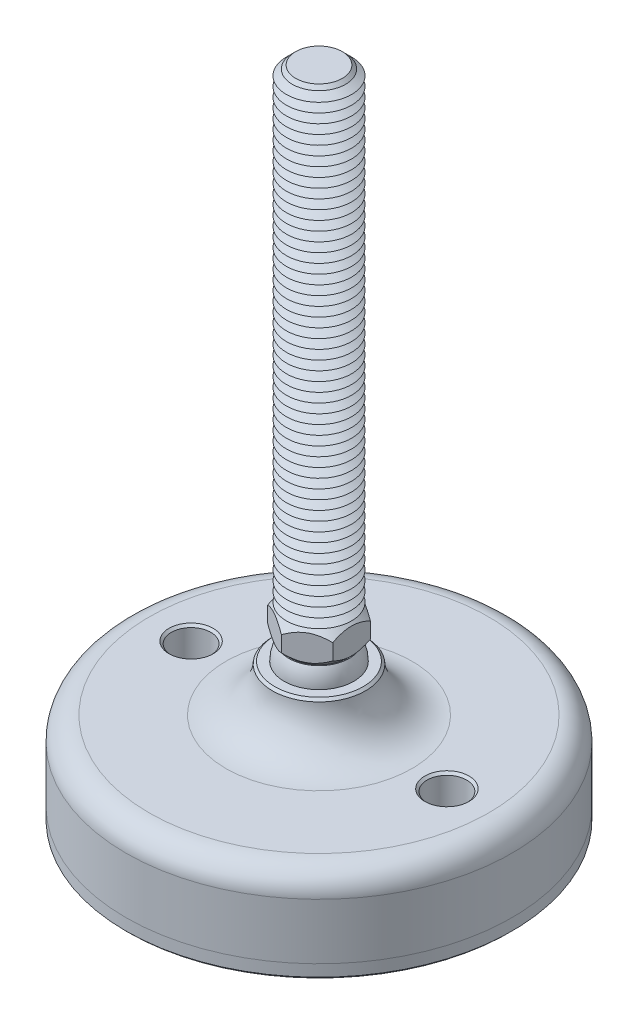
ISO-10303-21;
HEADER;
FILE_DESCRIPTION(('STEP AP214'),'2;1');
FILE_NAME('part.step','',(''),(''),'','','');
FILE_SCHEMA(('AUTOMOTIVE_DESIGN { 1 0 10303 214 1 1 1 1 }'));
ENDSEC;
DATA;
#1=APPLICATION_CONTEXT('core data for automotive mechanical design processes');
#2=APPLICATION_PROTOCOL_DEFINITION('international standard','automotive_design',2000,#1);
#3=PRODUCT_CONTEXT('',#1,'mechanical');
#4=PRODUCT('Part','Part','',(#3));
#5=PRODUCT_RELATED_PRODUCT_CATEGORY('part','',(#4));
#6=PRODUCT_DEFINITION_FORMATION('','',#4);
#7=PRODUCT_DEFINITION_CONTEXT('part definition',#1,'design');
#8=PRODUCT_DEFINITION('design','',#6,#7);
#9=PRODUCT_DEFINITION_SHAPE('','',#8);
#10=(LENGTH_UNIT() NAMED_UNIT(*) SI_UNIT(.MILLI.,.METRE.));
#11=(NAMED_UNIT(*) PLANE_ANGLE_UNIT() SI_UNIT($,.RADIAN.));
#12=(NAMED_UNIT(*) SI_UNIT($,.STERADIAN.) SOLID_ANGLE_UNIT());
#13=UNCERTAINTY_MEASURE_WITH_UNIT(LENGTH_MEASURE(1.E-05),#10,'distance_accuracy_value','');
#14=(GEOMETRIC_REPRESENTATION_CONTEXT(3) GLOBAL_UNCERTAINTY_ASSIGNED_CONTEXT((#13)) GLOBAL_UNIT_ASSIGNED_CONTEXT((#10,
#11,#12)) REPRESENTATION_CONTEXT('',''));
#15=CARTESIAN_POINT('',(0.,0.,0.));
#16=DIRECTION('',(0.,0.,1.));
#17=DIRECTION('',(1.,0.,0.));
#18=AXIS2_PLACEMENT_3D('',#15,#16,#17);
#19=CARTESIAN_POINT('',(0.,-27.,0.));
#20=DIRECTION('',(0.,1.,0.));
#21=DIRECTION('',(0.,0.,1.));
#22=AXIS2_PLACEMENT_3D('',#19,#20,#21);
#23=PLANE('',#22);
#24=CARTESIAN_POINT('',(-27.5,-27.,0.));
#25=DIRECTION('',(0.,1.,0.));
#26=DIRECTION('',(0.,0.,1.));
#27=AXIS2_PLACEMENT_3D('',#24,#25,#26);
#28=CIRCLE('',#27,4.25000000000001);
#29=CARTESIAN_POINT('',(-27.5,-27.,4.25000000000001));
#30=VERTEX_POINT('',#29);
#31=EDGE_CURVE('P0_E43',#30,#30,#28,.T.);
#32=ORIENTED_EDGE('',*,*,#31,.F.);
#33=EDGE_LOOP('',(#32));
#34=FACE_BOUND('',#33,.T.);
#35=CARTESIAN_POINT('',(27.5,-27.,0.));
#36=DIRECTION('',(0.,1.,0.));
#37=DIRECTION('',(0.,0.,1.));
#38=AXIS2_PLACEMENT_3D('',#35,#36,#37);
#39=CIRCLE('',#38,4.25000000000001);
#40=CARTESIAN_POINT('',(27.5,-27.,4.25000000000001));
#41=VERTEX_POINT('',#40);
#42=EDGE_CURVE('P0_E44',#41,#41,#39,.T.);
#43=ORIENTED_EDGE('',*,*,#42,.F.);
#44=EDGE_LOOP('',(#43));
#45=FACE_BOUND('',#44,.T.);
#46=CARTESIAN_POINT('',(0.,-27.,0.));
#47=DIRECTION('',(0.,1.,0.));
#48=DIRECTION('',(0.,0.,1.));
#49=AXIS2_PLACEMENT_3D('',#46,#47,#48);
#50=CIRCLE('',#49,41.5);
#51=CARTESIAN_POINT('',(0.,-27.,41.5));
#52=VERTEX_POINT('',#51);
#53=EDGE_CURVE('P0_E40',#52,#52,#50,.T.);
#54=ORIENTED_EDGE('',*,*,#53,.T.);
#55=EDGE_LOOP('',(#54));
#56=FACE_BOUND('',#55,.T.);
#57=ADVANCED_FACE('P0_F14',(#34,#45,#56),#23,.T.);
#58=CARTESIAN_POINT('',(0.,48.1654938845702,0.));
#59=DIRECTION('',(0.,1.,0.));
#60=DIRECTION('',(0.,0.,1.));
#61=AXIS2_PLACEMENT_3D('',#58,#59,#60);
#62=CYLINDRICAL_SURFACE('',#61,41.5);
#63=CARTESIAN_POINT('',(0.,-29.5,0.));
#64=DIRECTION('',(0.,-1.,0.));
#65=DIRECTION('',(0.,0.,-1.));
#66=AXIS2_PLACEMENT_3D('',#63,#64,#65);
#67=CIRCLE('',#66,41.5);
#68=CARTESIAN_POINT('',(0.,-29.5,-41.5));
#69=VERTEX_POINT('',#68);
#70=EDGE_CURVE('P0_E37',#69,#69,#67,.F.);
#71=ORIENTED_EDGE('',*,*,#70,.T.);
#72=EDGE_LOOP('',(#71));
#73=FACE_BOUND('',#72,.T.);
#74=ORIENTED_EDGE('',*,*,#53,.F.);
#75=EDGE_LOOP('',(#74));
#76=FACE_BOUND('',#75,.T.);
#77=ADVANCED_FACE('P0_F54',(#73,#76),#62,.T.);
#78=CARTESIAN_POINT('',(0.,-30.,41.5));
#79=DIRECTION('',(0.,-1.,0.));
#80=DIRECTION('',(0.,0.,-1.));
#81=AXIS2_PLACEMENT_3D('',#78,#79,#80);
#82=PLANE('',#81);
#83=CARTESIAN_POINT('',(27.5,-30.,0.));
#84=DIRECTION('',(0.,-1.,0.));
#85=DIRECTION('',(0.,0.,-1.));
#86=AXIS2_PLACEMENT_3D('',#83,#84,#85);
#87=CIRCLE('',#86,4.75);
#88=CARTESIAN_POINT('',(27.5,-30.,-4.75000000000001));
#89=VERTEX_POINT('',#88);
#90=EDGE_CURVE('P0_E25',#89,#89,#87,.F.);
#91=ORIENTED_EDGE('',*,*,#90,.T.);
#92=EDGE_LOOP('',(#91));
#93=FACE_BOUND('',#92,.T.);
#94=CARTESIAN_POINT('',(-27.5,-30.,0.));
#95=DIRECTION('',(0.,-1.,0.));
#96=DIRECTION('',(0.,0.,-1.));
#97=AXIS2_PLACEMENT_3D('',#94,#95,#96);
#98=CIRCLE('',#97,4.75);
#99=CARTESIAN_POINT('',(-27.5,-30.,-4.75));
#100=VERTEX_POINT('',#99);
#101=EDGE_CURVE('P0_E29',#100,#100,#98,.F.);
#102=ORIENTED_EDGE('',*,*,#101,.T.);
#103=EDGE_LOOP('',(#102));
#104=FACE_BOUND('',#103,.T.);
#105=CARTESIAN_POINT('',(0.,-30.,0.));
#106=DIRECTION('',(0.,-1.,0.));
#107=DIRECTION('',(0.,0.,-1.));
#108=AXIS2_PLACEMENT_3D('',#105,#106,#107);
#109=CIRCLE('',#108,41.);
#110=CARTESIAN_POINT('',(0.,-30.,-41.));
#111=VERTEX_POINT('',#110);
#112=EDGE_CURVE('P0_E34',#111,#111,#109,.T.);
#113=ORIENTED_EDGE('',*,*,#112,.T.);
#114=EDGE_LOOP('',(#113));
#115=FACE_BOUND('',#114,.T.);
#116=ADVANCED_FACE('P0_F61',(#93,#104,#115),#82,.T.);
#117=CARTESIAN_POINT('',(0.,-29.5,0.));
#118=DIRECTION('',(0.,1.,0.));
#119=DIRECTION('',(0.,0.,1.));
#120=AXIS2_PLACEMENT_3D('',#117,#118,#119);
#121=CONICAL_SURFACE('',#120,41.5,0.785398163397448);
#122=ORIENTED_EDGE('',*,*,#112,.F.);
#123=EDGE_LOOP('',(#122));
#124=FACE_BOUND('',#123,.T.);
#125=ORIENTED_EDGE('',*,*,#70,.F.);
#126=EDGE_LOOP('',(#125));
#127=FACE_BOUND('',#126,.T.);
#128=ADVANCED_FACE('P0_F68',(#124,#127),#121,.T.);
#129=CARTESIAN_POINT('',(27.5,-30.,0.));
#130=DIRECTION('',(0.,1.,0.));
#131=DIRECTION('',(0.,0.,1.));
#132=AXIS2_PLACEMENT_3D('',#129,#130,#131);
#133=CYLINDRICAL_SURFACE('',#132,4.25000000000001);
#134=CARTESIAN_POINT('',(27.5,-29.5,0.));
#135=DIRECTION('',(0.,-1.,0.));
#136=DIRECTION('',(0.,0.,-1.));
#137=AXIS2_PLACEMENT_3D('',#134,#135,#136);
#138=CIRCLE('',#137,4.25000000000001);
#139=CARTESIAN_POINT('',(27.5,-29.5,-4.25000000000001));
#140=VERTEX_POINT('',#139);
#141=EDGE_CURVE('P0_E21',#140,#140,#138,.T.);
#142=ORIENTED_EDGE('',*,*,#141,.T.);
#143=EDGE_LOOP('',(#142));
#144=FACE_BOUND('',#143,.T.);
#145=ORIENTED_EDGE('',*,*,#42,.T.);
#146=EDGE_LOOP('',(#145));
#147=FACE_BOUND('',#146,.T.);
#148=ADVANCED_FACE('P0_F74',(#144,#147),#133,.F.);
#149=CARTESIAN_POINT('',(-27.5,-30.,0.));
#150=DIRECTION('',(0.,1.,0.));
#151=DIRECTION('',(0.,0.,1.));
#152=AXIS2_PLACEMENT_3D('',#149,#150,#151);
#153=CYLINDRICAL_SURFACE('',#152,4.25000000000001);
#154=CARTESIAN_POINT('',(-27.5,-29.5,0.));
#155=DIRECTION('',(0.,-1.,0.));
#156=DIRECTION('',(0.,0.,-1.));
#157=AXIS2_PLACEMENT_3D('',#154,#155,#156);
#158=CIRCLE('',#157,4.25000000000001);
#159=CARTESIAN_POINT('',(-27.5,-29.5,-4.25000000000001));
#160=VERTEX_POINT('',#159);
#161=EDGE_CURVE('P0_E10',#160,#160,#158,.T.);
#162=ORIENTED_EDGE('',*,*,#161,.T.);
#163=EDGE_LOOP('',(#162));
#164=FACE_BOUND('',#163,.T.);
#165=ORIENTED_EDGE('',*,*,#31,.T.);
#166=EDGE_LOOP('',(#165));
#167=FACE_BOUND('',#166,.T.);
#168=ADVANCED_FACE('P0_F50',(#164,#167),#153,.F.);
#169=CARTESIAN_POINT('',(27.5,-30.,0.));
#170=DIRECTION('',(0.,-1.,0.));
#171=DIRECTION('',(0.,0.,-1.));
#172=AXIS2_PLACEMENT_3D('',#169,#170,#171);
#173=CONICAL_SURFACE('',#172,4.75,0.785398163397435);
#174=ORIENTED_EDGE('',*,*,#141,.F.);
#175=EDGE_LOOP('',(#174));
#176=FACE_BOUND('',#175,.T.);
#177=ORIENTED_EDGE('',*,*,#90,.F.);
#178=EDGE_LOOP('',(#177));
#179=FACE_BOUND('',#178,.T.);
#180=ADVANCED_FACE('P0_F76',(#176,#179),#173,.F.);
#181=CARTESIAN_POINT('',(-27.5,-30.,0.));
#182=DIRECTION('',(0.,-1.,0.));
#183=DIRECTION('',(0.,0.,-1.));
#184=AXIS2_PLACEMENT_3D('',#181,#182,#183);
#185=CONICAL_SURFACE('',#184,4.75,0.785398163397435);
#186=ORIENTED_EDGE('',*,*,#161,.F.);
#187=EDGE_LOOP('',(#186));
#188=FACE_BOUND('',#187,.T.);
#189=ORIENTED_EDGE('',*,*,#101,.F.);
#190=EDGE_LOOP('',(#189));
#191=FACE_BOUND('',#190,.T.);
#192=ADVANCED_FACE('P0_F16',(#188,#191),#185,.F.);
#193=CLOSED_SHELL('',(#57,#77,#116,#128,#148,#168,#180,#192));
#194=MANIFOLD_SOLID_BREP('P0_B1',#193);
#195=CARTESIAN_POINT('',(0.,0.,0.));
#196=DIRECTION('',(0.,1.,0.));
#197=DIRECTION('',(0.,0.,-1.));
#198=AXIS2_PLACEMENT_3D('',#195,#196,#197);
#199=SPHERICAL_SURFACE('',#198,7.5);
#200=CARTESIAN_POINT('',(0.,3.75,0.));
#201=DIRECTION('',(0.,-1.,0.));
#202=DIRECTION('',(0.,0.,-1.));
#203=AXIS2_PLACEMENT_3D('',#200,#201,#202);
#204=CIRCLE('',#203,6.49519052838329);
#205=CARTESIAN_POINT('',(0.,3.75,-6.49519052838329));
#206=VERTEX_POINT('',#205);
#207=EDGE_CURVE('P1_E209',#206,#206,#204,.F.);
#208=ORIENTED_EDGE('',*,*,#207,.F.);
#209=EDGE_LOOP('',(#208));
#210=FACE_BOUND('',#209,.T.);
#211=ADVANCED_FACE('P1_F16',(#210),#199,.T.);
#212=CARTESIAN_POINT('',(0.,3.75,0.));
#213=DIRECTION('',(0.,1.,0.));
#214=DIRECTION('',(0.,0.,1.));
#215=AXIS2_PLACEMENT_3D('',#212,#213,#214);
#216=CONICAL_SURFACE('',#215,6.26419292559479,0.785398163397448);
#217=CARTESIAN_POINT('',(0.,3.75,0.));
#218=DIRECTION('',(0.,1.,0.));
#219=DIRECTION('',(0.,0.,1.));
#220=AXIS2_PLACEMENT_3D('',#217,#218,#219);
#221=CIRCLE('',#220,6.26419292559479);
#222=CARTESIAN_POINT('',(0.,3.75,6.26419292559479));
#223=VERTEX_POINT('',#222);
#224=EDGE_CURVE('P1_E213',#223,#223,#221,.T.);
#225=ORIENTED_EDGE('',*,*,#224,.T.);
#226=EDGE_LOOP('',(#225));
#227=FACE_BOUND('',#226,.T.);
#228=CARTESIAN_POINT('',(-7.,8.22175145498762,-8.1400553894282));
#229=CARTESIAN_POINT('',(-7.,8.07177748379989,-7.94220937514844));
#230=CARTESIAN_POINT('',(-7.,7.92322959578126,-7.74326459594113));
#231=CARTESIAN_POINT('',(-7.,7.62962733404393,-7.34274065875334));
#232=CARTESIAN_POINT('',(-7.,7.48457383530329,-7.14116086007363));
#233=CARTESIAN_POINT('',(-7.,7.19756981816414,-6.73345531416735));
#234=CARTESIAN_POINT('',(-7.,7.05565202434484,-6.52730645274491));
#235=CARTESIAN_POINT('',(-7.,6.77703382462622,-6.11152362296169));
#236=CARTESIAN_POINT('',(-7.,6.64033305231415,-5.90188990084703));
#237=CARTESIAN_POINT('',(-7.,6.36550740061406,-5.46619755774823));
#238=CARTESIAN_POINT('',(-7.,6.22776674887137,-5.23989534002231));
#239=CARTESIAN_POINT('',(-7.,5.96123372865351,-4.78200028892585));
#240=CARTESIAN_POINT('',(-7.,5.83244279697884,-4.55040661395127));
#241=CARTESIAN_POINT('',(-7.,5.58658047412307,-4.08193183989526));
#242=CARTESIAN_POINT('',(-7.,5.46947462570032,-3.8450689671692));
#243=CARTESIAN_POINT('',(-7.,5.24960465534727,-3.36483104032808));
#244=CARTESIAN_POINT('',(-7.,5.14683397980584,-3.12145902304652));
#245=CARTESIAN_POINT('',(-7.,4.96723655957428,-2.64866791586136));
#246=CARTESIAN_POINT('',(-7.,4.88895097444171,-2.41980876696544));
#247=CARTESIAN_POINT('',(-7.,4.75072959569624,-1.9565107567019));
#248=CARTESIAN_POINT('',(-7.,4.69079504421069,-1.72207151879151));
#249=CARTESIAN_POINT('',(-7.,4.59342684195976,-1.25295119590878));
#250=CARTESIAN_POINT('',(-7.,4.5556027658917,-1.01835249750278));
#251=CARTESIAN_POINT('',(-7.,4.50320231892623,-0.546559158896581));
#252=CARTESIAN_POINT('',(-7.,4.48862178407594,-0.309364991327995));
#253=CARTESIAN_POINT('',(-7.,4.48382612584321,0.156313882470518));
#254=CARTESIAN_POINT('',(-7.,4.49271264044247,0.384789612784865));
#255=CARTESIAN_POINT('',(-7.,4.53235928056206,0.839822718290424));
#256=CARTESIAN_POINT('',(-7.,4.56312150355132,1.06637990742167));
#257=CARTESIAN_POINT('',(-7.,4.64535130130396,1.51976805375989));
#258=CARTESIAN_POINT('',(-7.,4.69717402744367,1.74653354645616));
#259=CARTESIAN_POINT('',(-7.,4.81873728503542,2.19511331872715));
#260=CARTESIAN_POINT('',(-7.,4.88847641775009,2.41692798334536));
#261=CARTESIAN_POINT('',(-7.,5.04951755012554,2.87389766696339));
#262=CARTESIAN_POINT('',(-7.,5.14215063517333,3.10857869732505));
#263=CARTESIAN_POINT('',(-7.,5.3416605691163,3.57185972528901));
#264=CARTESIAN_POINT('',(-7.,5.44854400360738,3.80045685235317));
#265=CARTESIAN_POINT('',(-7.,5.6740138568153,4.25267813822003));
#266=CARTESIAN_POINT('',(-7.,5.79263686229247,4.47628390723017));
#267=CARTESIAN_POINT('',(-7.,6.03896666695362,4.91835509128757));
#268=CARTESIAN_POINT('',(-7.,6.16667203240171,5.13682131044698));
#269=CARTESIAN_POINT('',(-7.,6.4228595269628,5.55855563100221));
#270=CARTESIAN_POINT('',(-7.,6.55098806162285,5.76203966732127));
#271=CARTESIAN_POINT('',(-7.,6.81264959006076,6.16551366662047));
#272=CARTESIAN_POINT('',(-7.,6.94618299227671,6.36550336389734));
#273=CARTESIAN_POINT('',(-7.,7.21658951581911,6.76082742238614));
#274=CARTESIAN_POINT('',(-7.,7.35342681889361,6.95618637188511));
#275=CARTESIAN_POINT('',(-7.,7.6307324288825,7.34423185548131));
#276=CARTESIAN_POINT('',(-7.,7.77119972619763,7.53691911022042));
#277=CARTESIAN_POINT('',(-7.,7.91315155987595,7.72848711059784));
#278=B_SPLINE_CURVE_WITH_KNOTS('',3,(#228,#229,#230,#231,#232,#233,#234,#235,#236,#237,#238,
#239,#240,#241,#242,#243,#244,#245,#246,#247,#248,#249,#250,#251,#252,#253,#254,#255,#256,#257,
#258,#259,#260,#261,#262,#263,#264,#265,#266,#267,#268,#269,#270,#271,#272,#273,#274,#275,#276,
#277),.UNSPECIFIED.,.F.,.F.,(4,2,2,2,2,2,2,2,2,2,2,2,2,2,2,2,2,2,2,2,2,2,2,2,4),(0.,
0.744807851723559,1.48980030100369,2.2405614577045,2.99126978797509,3.78587980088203,
4.58061708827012,5.37293691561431,6.16489332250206,6.88989369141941,7.61494312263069,
8.32676947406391,9.0384682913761,9.72332048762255,10.4082383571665,11.1052200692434,
11.8021473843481,12.5584650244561,13.3151334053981,14.0742390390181,14.8332251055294,
15.5545151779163,16.2758598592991,16.9913609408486,17.7066651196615),.UNSPECIFIED.);
#279=CARTESIAN_POINT('',(-7.,5.56871084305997,-4.04145188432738));
#280=VERTEX_POINT('',#279);
#281=CARTESIAN_POINT('',(-7.,5.56871084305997,4.04145188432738));
#282=VERTEX_POINT('',#281);
#283=EDGE_CURVE('P1_E25',#280,#282,#278,.T.);
#284=ORIENTED_EDGE('',*,*,#283,.F.);
#285=CARTESIAN_POINT('',(0.000199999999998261,5.56882631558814,-8.0830192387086));
#286=CARTESIAN_POINT('',(-0.120159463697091,5.49934419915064,-8.01352966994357));
#287=CARTESIAN_POINT('',(-0.241444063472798,5.43199440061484,-7.94350597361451));
#288=CARTESIAN_POINT('',(-0.486045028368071,5.30220807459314,-7.80228554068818));
#289=CARTESIAN_POINT('',(-0.60936245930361,5.2397742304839,-7.73108818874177));
#290=CARTESIAN_POINT('',(-0.983781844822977,5.06028719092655,-7.51491705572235));
#291=CARTESIAN_POINT('',(-1.23805341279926,4.95181416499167,-7.36811329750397));
#292=CARTESIAN_POINT('',(-1.75081233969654,4.76606165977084,-7.07207179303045));
#293=CARTESIAN_POINT('',(-2.00916864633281,4.68831421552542,-6.92290970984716));
#294=CARTESIAN_POINT('',(-2.40095049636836,4.59837958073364,-6.69671435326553));
#295=CARTESIAN_POINT('',(-2.53212124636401,4.57286115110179,-6.62098288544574));
#296=CARTESIAN_POINT('',(-2.79557335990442,4.53129725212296,-6.4688787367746));
#297=CARTESIAN_POINT('',(-2.92785455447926,4.5152503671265,-6.39250615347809));
#298=CARTESIAN_POINT('',(-3.25020698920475,4.48834537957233,-6.2063958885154));
#299=CARTESIAN_POINT('',(-3.44062555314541,4.48270029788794,-6.09645767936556));
#300=CARTESIAN_POINT('',(-3.82111946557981,4.49217587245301,-5.87677941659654));
#301=CARTESIAN_POINT('',(-4.01119467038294,4.5073038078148,-5.76703944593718));
#302=CARTESIAN_POINT('',(-4.38955306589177,4.55743368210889,-5.54859412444));
#303=CARTESIAN_POINT('',(-4.57783401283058,4.5924578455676,-5.43989006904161));
#304=CARTESIAN_POINT('',(-4.95115981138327,4.68047604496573,-5.22435031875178));
#305=CARTESIAN_POINT('',(-5.13620490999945,4.73346870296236,-5.1175144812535));
#306=CARTESIAN_POINT('',(-5.46469033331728,4.84248989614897,-4.92786333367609));
#307=CARTESIAN_POINT('',(-5.6088580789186,4.89565100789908,-4.8446280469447));
#308=CARTESIAN_POINT('',(-5.8946056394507,5.0105398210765,-4.67965161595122));
#309=CARTESIAN_POINT('',(-6.03618537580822,5.07226778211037,-4.5979105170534));
#310=CARTESIAN_POINT('',(-6.31631098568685,5.20290661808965,-4.43617992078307));
#311=CARTESIAN_POINT('',(-6.4548648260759,5.27179490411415,-4.3561858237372));
#312=CARTESIAN_POINT('',(-6.72940692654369,5.41585000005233,-4.19767886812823));
#313=CARTESIAN_POINT('',(-6.86539669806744,5.49101295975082,-4.11916513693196));
#314=CARTESIAN_POINT('',(-7.0002,5.56882631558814,-4.04133641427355));
#315=B_SPLINE_CURVE_WITH_KNOTS('',3,(#285,#286,#287,#288,#289,#290,#291,#292,#293,#294,#295,
#296,#297,#298,#299,#300,#301,#302,#303,#304,#305,#306,#307,#308,#309,#310,#311,#312,#313,#314),
.UNSPECIFIED.,.F.,.F.,(4,2,2,2,2,2,2,2,2,2,2,2,2,2,4),(0.,0.466112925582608,0.932478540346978,
1.87024464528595,2.79312018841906,3.25365289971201,3.71411676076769,4.37293813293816,
5.03199042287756,5.69178034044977,6.35151967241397,6.8755322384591,7.39956068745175,
7.92198344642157,8.44408796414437),.UNSPECIFIED.);
#316=CARTESIAN_POINT('',(0.,5.56871084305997,-8.08290376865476));
#317=VERTEX_POINT('',#316);
#318=EDGE_CURVE('P1_E114',#317,#280,#315,.T.);
#319=ORIENTED_EDGE('',*,*,#318,.F.);
#320=CARTESIAN_POINT('',(7.00019999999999,5.56882631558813,-4.04133641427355));
#321=CARTESIAN_POINT('',(6.8798405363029,5.49934419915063,-4.11082598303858));
#322=CARTESIAN_POINT('',(6.7585559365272,5.43199440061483,-4.18084967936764));
#323=CARTESIAN_POINT('',(6.51395497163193,5.30220807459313,-4.32207011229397));
#324=CARTESIAN_POINT('',(6.39063754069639,5.2397742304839,-4.39326746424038));
#325=CARTESIAN_POINT('',(6.01621815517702,5.06028719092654,-4.6094385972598));
#326=CARTESIAN_POINT('',(5.76194658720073,4.95181416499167,-4.75624235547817));
#327=CARTESIAN_POINT('',(5.24918766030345,4.76606165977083,-5.0522838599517));
#328=CARTESIAN_POINT('',(4.99083135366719,4.68831421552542,-5.20144594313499));
#329=CARTESIAN_POINT('',(4.59904950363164,4.59837958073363,-5.42764129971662));
#330=CARTESIAN_POINT('',(4.46787875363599,4.57286115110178,-5.50337276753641));
#331=CARTESIAN_POINT('',(4.20442664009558,4.53129725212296,-5.65547691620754));
#332=CARTESIAN_POINT('',(4.07214544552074,4.5152503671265,-5.73184949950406));
#333=CARTESIAN_POINT('',(3.74979301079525,4.48834537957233,-5.91795976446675));
#334=CARTESIAN_POINT('',(3.55937444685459,4.48270029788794,-6.02789797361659));
#335=CARTESIAN_POINT('',(3.17888053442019,4.49217587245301,-6.2475762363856));
#336=CARTESIAN_POINT('',(2.98880532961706,4.5073038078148,-6.35731620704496));
#337=CARTESIAN_POINT('',(2.61044693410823,4.55743368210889,-6.57576152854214));
#338=CARTESIAN_POINT('',(2.42216598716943,4.5924578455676,-6.68446558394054));
#339=CARTESIAN_POINT('',(2.04884018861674,4.68047604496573,-6.90000533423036));
#340=CARTESIAN_POINT('',(1.86379509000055,4.73346870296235,-7.00684117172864));
#341=CARTESIAN_POINT('',(1.53530966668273,4.84248989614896,-7.19649231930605));
#342=CARTESIAN_POINT('',(1.3911419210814,4.89565100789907,-7.27972760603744));
#343=CARTESIAN_POINT('',(1.1053943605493,5.0105398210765,-7.44470403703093));
#344=CARTESIAN_POINT('',(0.96381462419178,5.07226778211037,-7.52644513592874));
#345=CARTESIAN_POINT('',(0.683689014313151,5.20290661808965,-7.68817573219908));
#346=CARTESIAN_POINT('',(0.545135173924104,5.27179490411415,-7.76816982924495));
#347=CARTESIAN_POINT('',(0.270593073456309,5.41585000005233,-7.92667678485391));
#348=CARTESIAN_POINT('',(0.134603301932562,5.49101295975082,-8.00519051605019));
#349=CARTESIAN_POINT('',(-0.00020000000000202,5.56882631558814,-8.0830192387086));
#350=B_SPLINE_CURVE_WITH_KNOTS('',3,(#320,#321,#322,#323,#324,#325,#326,#327,#328,#329,#330,
#331,#332,#333,#334,#335,#336,#337,#338,#339,#340,#341,#342,#343,#344,#345,#346,#347,#348,#349),
.UNSPECIFIED.,.F.,.F.,(4,2,2,2,2,2,2,2,2,2,2,2,2,2,4),(0.,0.466112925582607,0.932478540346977,
1.87024464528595,2.79312018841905,3.25365289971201,3.71411676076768,4.37293813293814,
5.03199042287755,5.69178034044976,6.35151967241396,6.87553223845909,7.39956068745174,
7.92198344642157,8.44408796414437),.UNSPECIFIED.);
#351=CARTESIAN_POINT('',(7.,5.56871084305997,-4.04145188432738));
#352=VERTEX_POINT('',#351);
#353=EDGE_CURVE('P1_E121',#352,#317,#350,.T.);
#354=ORIENTED_EDGE('',*,*,#353,.F.);
#355=CARTESIAN_POINT('',(6.99999999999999,8.22175145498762,-8.1400553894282));
#356=CARTESIAN_POINT('',(6.99999999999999,8.07177748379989,-7.94220937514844));
#357=CARTESIAN_POINT('',(6.99999999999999,7.92322959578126,-7.74326459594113));
#358=CARTESIAN_POINT('',(6.99999999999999,7.62962733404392,-7.34274065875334));
#359=CARTESIAN_POINT('',(6.99999999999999,7.48457383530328,-7.14116086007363));
#360=CARTESIAN_POINT('',(6.99999999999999,7.19756981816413,-6.73345531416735));
#361=CARTESIAN_POINT('',(6.99999999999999,7.05565202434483,-6.52730645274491));
#362=CARTESIAN_POINT('',(6.99999999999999,6.77703382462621,-6.11152362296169));
#363=CARTESIAN_POINT('',(6.99999999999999,6.64033305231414,-5.90188990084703));
#364=CARTESIAN_POINT('',(6.99999999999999,6.36550740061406,-5.46619755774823));
#365=CARTESIAN_POINT('',(6.99999999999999,6.22776674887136,-5.23989534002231));
#366=CARTESIAN_POINT('',(6.99999999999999,5.9612337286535,-4.78200028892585));
#367=CARTESIAN_POINT('',(6.99999999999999,5.83244279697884,-4.55040661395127));
#368=CARTESIAN_POINT('',(6.99999999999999,5.58658047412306,-4.08193183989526));
#369=CARTESIAN_POINT('',(6.99999999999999,5.46947462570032,-3.8450689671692));
#370=CARTESIAN_POINT('',(6.99999999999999,5.24960465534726,-3.36483104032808));
#371=CARTESIAN_POINT('',(6.99999999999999,5.14683397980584,-3.12145902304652));
#372=CARTESIAN_POINT('',(6.99999999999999,4.96723655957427,-2.64866791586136));
#373=CARTESIAN_POINT('',(6.99999999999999,4.88895097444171,-2.41980876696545));
#374=CARTESIAN_POINT('',(6.99999999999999,4.75072959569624,-1.9565107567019));
#375=CARTESIAN_POINT('',(6.99999999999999,4.69079504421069,-1.72207151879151));
#376=CARTESIAN_POINT('',(6.99999999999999,4.59342684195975,-1.25295119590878));
#377=CARTESIAN_POINT('',(6.99999999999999,4.5556027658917,-1.01835249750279));
#378=CARTESIAN_POINT('',(6.99999999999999,4.50320231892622,-0.546559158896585));
#379=CARTESIAN_POINT('',(6.99999999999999,4.48862178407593,-0.309364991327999));
#380=CARTESIAN_POINT('',(6.99999999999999,4.48382612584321,0.156313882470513));
#381=CARTESIAN_POINT('',(6.99999999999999,4.49271264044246,0.38478961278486));
#382=CARTESIAN_POINT('',(6.99999999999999,4.53235928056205,0.83982271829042));
#383=CARTESIAN_POINT('',(6.99999999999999,4.56312150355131,1.06637990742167));
#384=CARTESIAN_POINT('',(6.99999999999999,4.64535130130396,1.51976805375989));
#385=CARTESIAN_POINT('',(6.99999999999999,4.69717402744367,1.74653354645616));
#386=CARTESIAN_POINT('',(6.99999999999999,4.81873728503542,2.19511331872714));
#387=CARTESIAN_POINT('',(7.,4.88847641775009,2.41692798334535));
#388=CARTESIAN_POINT('',(7.,5.04951755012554,2.87389766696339));
#389=CARTESIAN_POINT('',(7.,5.14215063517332,3.10857869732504));
#390=CARTESIAN_POINT('',(7.,5.34166056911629,3.571859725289));
#391=CARTESIAN_POINT('',(7.,5.44854400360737,3.80045685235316));
#392=CARTESIAN_POINT('',(7.,5.67401385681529,4.25267813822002));
#393=CARTESIAN_POINT('',(7.,5.79263686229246,4.47628390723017));
#394=CARTESIAN_POINT('',(7.,6.03896666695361,4.91835509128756));
#395=CARTESIAN_POINT('',(7.,6.1666720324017,5.13682131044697));
#396=CARTESIAN_POINT('',(7.,6.42285952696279,5.5585556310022));
#397=CARTESIAN_POINT('',(7.,6.55098806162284,5.76203966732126));
#398=CARTESIAN_POINT('',(7.,6.81264959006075,6.16551366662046));
#399=CARTESIAN_POINT('',(7.,6.9461829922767,6.36550336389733));
#400=CARTESIAN_POINT('',(7.,7.21658951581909,6.76082742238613));
#401=CARTESIAN_POINT('',(7.,7.3534268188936,6.9561863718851));
#402=CARTESIAN_POINT('',(7.,7.63073242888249,7.3442318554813));
#403=CARTESIAN_POINT('',(7.,7.77119972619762,7.53691911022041));
#404=CARTESIAN_POINT('',(7.,7.91315155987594,7.72848711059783));
#405=B_SPLINE_CURVE_WITH_KNOTS('',3,(#355,#356,#357,#358,#359,#360,#361,#362,#363,#364,#365,
#366,#367,#368,#369,#370,#371,#372,#373,#374,#375,#376,#377,#378,#379,#380,#381,#382,#383,#384,
#385,#386,#387,#388,#389,#390,#391,#392,#393,#394,#395,#396,#397,#398,#399,#400,#401,#402,#403,
#404),.UNSPECIFIED.,.F.,.F.,(4,2,2,2,2,2,2,2,2,2,2,2,2,2,2,2,2,2,2,2,2,2,2,2,4),(0.,
0.744807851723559,1.48980030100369,2.2405614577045,2.9912697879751,3.78587980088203,
4.58061708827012,5.3729369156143,6.16489332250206,6.8898936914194,7.61494312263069,
8.32676947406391,9.03846829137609,9.72332048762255,10.4082383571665,11.1052200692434,
11.8021473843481,12.5584650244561,13.3151334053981,14.0742390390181,14.8332251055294,
15.5545151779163,16.275859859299,16.9913609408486,17.7066651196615),.UNSPECIFIED.);
#406=CARTESIAN_POINT('',(6.99999999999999,5.56871084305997,4.04145188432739));
#407=VERTEX_POINT('',#406);
#408=EDGE_CURVE('P1_E71',#407,#352,#405,.F.);
#409=ORIENTED_EDGE('',*,*,#408,.F.);
#410=CARTESIAN_POINT('',(-0.000200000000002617,5.56882631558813,8.0830192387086));
#411=CARTESIAN_POINT('',(0.120159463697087,5.49934419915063,8.01352966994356));
#412=CARTESIAN_POINT('',(0.241444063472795,5.43199440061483,7.9435059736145));
#413=CARTESIAN_POINT('',(0.486045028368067,5.30220807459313,7.80228554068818));
#414=CARTESIAN_POINT('',(0.609362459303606,5.2397742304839,7.73108818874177));
#415=CARTESIAN_POINT('',(0.983781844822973,5.06028719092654,7.51491705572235));
#416=CARTESIAN_POINT('',(1.23805341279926,4.95181416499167,7.36811329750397));
#417=CARTESIAN_POINT('',(1.75081233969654,4.76606165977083,7.07207179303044));
#418=CARTESIAN_POINT('',(2.00916864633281,4.68831421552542,6.92290970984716));
#419=CARTESIAN_POINT('',(2.40095049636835,4.59837958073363,6.69671435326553));
#420=CARTESIAN_POINT('',(2.53212124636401,4.57286115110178,6.62098288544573));
#421=CARTESIAN_POINT('',(2.79557335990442,4.53129725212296,6.4688787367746));
#422=CARTESIAN_POINT('',(2.92785455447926,4.5152503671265,6.39250615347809));
#423=CARTESIAN_POINT('',(3.25020698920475,4.48834537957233,6.2063958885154));
#424=CARTESIAN_POINT('',(3.44062555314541,4.48270029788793,6.09645767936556));
#425=CARTESIAN_POINT('',(3.82111946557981,4.492175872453,5.87677941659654));
#426=CARTESIAN_POINT('',(4.01119467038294,4.5073038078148,5.76703944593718));
#427=CARTESIAN_POINT('',(4.38955306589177,4.55743368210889,5.54859412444));
#428=CARTESIAN_POINT('',(4.57783401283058,4.5924578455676,5.4398900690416));
#429=CARTESIAN_POINT('',(4.95115981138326,4.68047604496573,5.22435031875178));
#430=CARTESIAN_POINT('',(5.13620490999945,4.73346870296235,5.1175144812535));
#431=CARTESIAN_POINT('',(5.46469033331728,4.84248989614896,4.92786333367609));
#432=CARTESIAN_POINT('',(5.6088580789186,4.89565100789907,4.8446280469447));
#433=CARTESIAN_POINT('',(5.8946056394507,5.01053982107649,4.67965161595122));
#434=CARTESIAN_POINT('',(6.03618537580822,5.07226778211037,4.5979105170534));
#435=CARTESIAN_POINT('',(6.31631098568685,5.20290661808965,4.43617992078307));
#436=CARTESIAN_POINT('',(6.45486482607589,5.27179490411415,4.3561858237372));
#437=CARTESIAN_POINT('',(6.72940692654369,5.41585000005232,4.19767886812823));
#438=CARTESIAN_POINT('',(6.86539669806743,5.49101295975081,4.11916513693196));
#439=CARTESIAN_POINT('',(7.00019999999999,5.56882631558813,4.04133641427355));
#440=B_SPLINE_CURVE_WITH_KNOTS('',3,(#410,#411,#412,#413,#414,#415,#416,#417,#418,#419,#420,
#421,#422,#423,#424,#425,#426,#427,#428,#429,#430,#431,#432,#433,#434,#435,#436,#437,#438,#439),
.UNSPECIFIED.,.F.,.F.,(4,2,2,2,2,2,2,2,2,2,2,2,2,2,4),(0.,0.466112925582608,0.932478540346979,
1.87024464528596,2.79312018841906,3.25365289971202,3.71411676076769,4.37293813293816,
5.03199042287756,5.69178034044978,6.35151967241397,6.8755322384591,7.39956068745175,
7.92198344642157,8.44408796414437),.UNSPECIFIED.);
#441=CARTESIAN_POINT('',(0.,5.56871084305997,8.08290376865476));
#442=VERTEX_POINT('',#441);
#443=EDGE_CURVE('P1_E68',#442,#407,#440,.T.);
#444=ORIENTED_EDGE('',*,*,#443,.F.);
#445=CARTESIAN_POINT('',(-7.0002,5.56882631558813,4.04133641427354));
#446=CARTESIAN_POINT('',(-6.87984053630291,5.49934419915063,4.11082598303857));
#447=CARTESIAN_POINT('',(-6.7585559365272,5.43199440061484,4.18084967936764));
#448=CARTESIAN_POINT('',(-6.51395497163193,5.30220807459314,4.32207011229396));
#449=CARTESIAN_POINT('',(-6.39063754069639,5.2397742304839,4.39326746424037));
#450=CARTESIAN_POINT('',(-6.01621815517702,5.06028719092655,4.60943859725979));
#451=CARTESIAN_POINT('',(-5.76194658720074,4.95181416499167,4.75624235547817));
#452=CARTESIAN_POINT('',(-5.24918766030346,4.76606165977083,5.0522838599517));
#453=CARTESIAN_POINT('',(-4.99083135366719,4.68831421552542,5.20144594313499));
#454=CARTESIAN_POINT('',(-4.59904950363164,4.59837958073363,5.42764129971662));
#455=CARTESIAN_POINT('',(-4.46787875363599,4.57286115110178,5.50337276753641));
#456=CARTESIAN_POINT('',(-4.20442664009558,4.53129725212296,5.65547691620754));
#457=CARTESIAN_POINT('',(-4.07214544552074,4.5152503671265,5.73184949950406));
#458=CARTESIAN_POINT('',(-3.74979301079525,4.48834537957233,5.91795976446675));
#459=CARTESIAN_POINT('',(-3.55937444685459,4.48270029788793,6.02789797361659));
#460=CARTESIAN_POINT('',(-3.17888053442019,4.492175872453,6.2475762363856));
#461=CARTESIAN_POINT('',(-2.98880532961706,4.5073038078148,6.35731620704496));
#462=CARTESIAN_POINT('',(-2.61044693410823,4.55743368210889,6.57576152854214));
#463=CARTESIAN_POINT('',(-2.42216598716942,4.5924578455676,6.68446558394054));
#464=CARTESIAN_POINT('',(-2.04884018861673,4.68047604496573,6.90000533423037));
#465=CARTESIAN_POINT('',(-1.86379509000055,4.73346870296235,7.00684117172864));
#466=CARTESIAN_POINT('',(-1.53530966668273,4.84248989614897,7.19649231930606));
#467=CARTESIAN_POINT('',(-1.3911419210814,4.89565100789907,7.27972760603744));
#468=CARTESIAN_POINT('',(-1.1053943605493,5.01053982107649,7.44470403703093));
#469=CARTESIAN_POINT('',(-0.963814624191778,5.07226778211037,7.52644513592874));
#470=CARTESIAN_POINT('',(-0.683689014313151,5.20290661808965,7.68817573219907));
#471=CARTESIAN_POINT('',(-0.545135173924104,5.27179490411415,7.76816982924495));
#472=CARTESIAN_POINT('',(-0.270593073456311,5.41585000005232,7.92667678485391));
#473=CARTESIAN_POINT('',(-0.134603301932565,5.49101295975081,8.00519051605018));
#474=CARTESIAN_POINT('',(0.000199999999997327,5.56882631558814,8.0830192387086));
#475=B_SPLINE_CURVE_WITH_KNOTS('',3,(#445,#446,#447,#448,#449,#450,#451,#452,#453,#454,#455,
#456,#457,#458,#459,#460,#461,#462,#463,#464,#465,#466,#467,#468,#469,#470,#471,#472,#473,#474),
.UNSPECIFIED.,.F.,.F.,(4,2,2,2,2,2,2,2,2,2,2,2,2,2,4),(0.,0.466112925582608,0.93247854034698,
1.87024464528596,2.79312018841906,3.25365289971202,3.71411676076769,4.37293813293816,
5.03199042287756,5.69178034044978,6.35151967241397,6.8755322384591,7.39956068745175,
7.92198344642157,8.44408796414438),.UNSPECIFIED.);
#476=EDGE_CURVE('P1_E40',#282,#442,#475,.T.);
#477=ORIENTED_EDGE('',*,*,#476,.F.);
#478=EDGE_LOOP('',(#284,#319,#354,#409,#444,#477));
#479=FACE_BOUND('',#478,.T.);
#480=ADVANCED_FACE('P1_F69',(#227,#479),#216,.T.);
#481=CARTESIAN_POINT('',(0.,3.75,6.26419292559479));
#482=DIRECTION('',(0.,-1.,0.));
#483=DIRECTION('',(0.,0.,-1.));
#484=AXIS2_PLACEMENT_3D('',#481,#482,#483);
#485=PLANE('',#484);
#486=ORIENTED_EDGE('',*,*,#207,.T.);
#487=EDGE_LOOP('',(#486));
#488=FACE_BOUND('',#487,.T.);
#489=ORIENTED_EDGE('',*,*,#224,.F.);
#490=EDGE_LOOP('',(#489));
#491=FACE_BOUND('',#490,.T.);
#492=ADVANCED_FACE('P1_F106',(#488,#491),#485,.F.);
#493=CARTESIAN_POINT('',(-7.,11.,4.04145188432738));
#494=DIRECTION('',(0.5,0.,-0.866025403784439));
#495=DIRECTION('',(-0.866025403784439,0.,-0.5));
#496=AXIS2_PLACEMENT_3D('',#493,#494,#495);
#497=PLANE('',#496);
#498=DIRECTION('',(0.,-1.,0.));
#499=VECTOR('',#498,1.);
#500=CARTESIAN_POINT('',(0.,11.,8.08290376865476));
#501=LINE('',#500,#499);
#502=CARTESIAN_POINT('',(0.,8.97927405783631,8.08290376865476));
#503=VERTEX_POINT('',#502);
#504=EDGE_CURVE('P1_E82',#503,#442,#501,.T.);
#505=ORIENTED_EDGE('',*,*,#504,.F.);
#506=CARTESIAN_POINT('',(0.000199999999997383,8.97915858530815,8.0830192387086));
#507=CARTESIAN_POINT('',(-0.120159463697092,9.04864070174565,8.01352966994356));
#508=CARTESIAN_POINT('',(-0.241444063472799,9.11599050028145,7.9435059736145));
#509=CARTESIAN_POINT('',(-0.486045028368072,9.24577682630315,7.80228554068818));
#510=CARTESIAN_POINT('',(-0.609362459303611,9.30821067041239,7.73108818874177));
#511=CARTESIAN_POINT('',(-0.983781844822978,9.48769770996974,7.51491705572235));
#512=CARTESIAN_POINT('',(-1.23805341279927,9.59617073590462,7.36811329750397));
#513=CARTESIAN_POINT('',(-1.75081233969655,9.78192324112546,7.07207179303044));
#514=CARTESIAN_POINT('',(-2.00916864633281,9.85967068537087,6.92290970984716));
#515=CARTESIAN_POINT('',(-2.40095049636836,9.94960532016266,6.69671435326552));
#516=CARTESIAN_POINT('',(-2.53212124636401,9.9751237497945,6.62098288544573));
#517=CARTESIAN_POINT('',(-2.79557335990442,10.0166876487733,6.4688787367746));
#518=CARTESIAN_POINT('',(-2.92785455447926,10.0327345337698,6.39250615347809));
#519=CARTESIAN_POINT('',(-3.25020698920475,10.059639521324,6.2063958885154));
#520=CARTESIAN_POINT('',(-3.44062555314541,10.0652846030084,6.09645767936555));
#521=CARTESIAN_POINT('',(-3.82111946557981,10.0558090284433,5.87677941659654));
#522=CARTESIAN_POINT('',(-4.01119467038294,10.0406810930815,5.76703944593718));
#523=CARTESIAN_POINT('',(-4.38955306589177,9.9905512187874,5.54859412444));
#524=CARTESIAN_POINT('',(-4.57783401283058,9.95552705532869,5.4398900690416));
#525=CARTESIAN_POINT('',(-4.95115981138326,9.86750885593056,5.22435031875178));
#526=CARTESIAN_POINT('',(-5.13620490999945,9.81451619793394,5.1175144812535));
#527=CARTESIAN_POINT('',(-5.46469033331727,9.70549500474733,4.92786333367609));
#528=CARTESIAN_POINT('',(-5.6088580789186,9.65233389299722,4.8446280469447));
#529=CARTESIAN_POINT('',(-5.8946056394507,9.5374450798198,4.67965161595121));
#530=CARTESIAN_POINT('',(-6.03618537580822,9.47571711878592,4.5979105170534));
#531=CARTESIAN_POINT('',(-6.31631098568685,9.34507828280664,4.43617992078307));
#532=CARTESIAN_POINT('',(-6.4548648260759,9.27618999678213,4.35618582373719));
#533=CARTESIAN_POINT('',(-6.72940692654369,9.13213490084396,4.19767886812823));
#534=CARTESIAN_POINT('',(-6.86539669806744,9.05697194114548,4.11916513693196));
#535=CARTESIAN_POINT('',(-7.0002,8.97915858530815,4.04133641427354));
#536=B_SPLINE_CURVE_WITH_KNOTS('',3,(#506,#507,#508,#509,#510,#511,#512,#513,#514,#515,#516,
#517,#518,#519,#520,#521,#522,#523,#524,#525,#526,#527,#528,#529,#530,#531,#532,#533,#534,#535),
.UNSPECIFIED.,.F.,.F.,(4,2,2,2,2,2,2,2,2,2,2,2,2,2,4),(0.,0.466112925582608,0.932478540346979,
1.87024464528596,2.79312018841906,3.25365289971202,3.71411676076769,4.37293813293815,
5.03199042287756,5.69178034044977,6.35151967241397,6.87553223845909,7.39956068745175,
7.92198344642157,8.44408796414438),.UNSPECIFIED.);
#537=CARTESIAN_POINT('',(-7.,8.97927405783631,4.04145188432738));
#538=VERTEX_POINT('',#537);
#539=EDGE_CURVE('P1_E151',#503,#538,#536,.T.);
#540=ORIENTED_EDGE('',*,*,#539,.T.);
#541=DIRECTION('',(0.,-1.,0.));
#542=VECTOR('',#541,1.);
#543=CARTESIAN_POINT('',(-7.,11.,4.04145188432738));
#544=LINE('',#543,#542);
#545=EDGE_CURVE('P1_E84',#538,#282,#544,.T.);
#546=ORIENTED_EDGE('',*,*,#545,.T.);
#547=ORIENTED_EDGE('',*,*,#476,.T.);
#548=EDGE_LOOP('',(#505,#540,#546,#547));
#549=FACE_BOUND('',#548,.T.);
#550=ADVANCED_FACE('P1_F80',(#549),#497,.F.);
#551=CARTESIAN_POINT('',(0.,11.,8.08290376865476));
#552=DIRECTION('',(-0.5,0.,-0.866025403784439));
#553=DIRECTION('',(-0.866025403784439,0.,0.5));
#554=AXIS2_PLACEMENT_3D('',#551,#552,#553);
#555=PLANE('',#554);
#556=DIRECTION('',(0.,-1.,0.));
#557=VECTOR('',#556,1.);
#558=CARTESIAN_POINT('',(7.,11.,4.04145188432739));
#559=LINE('',#558,#557);
#560=CARTESIAN_POINT('',(7.,8.97927405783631,4.04145188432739));
#561=VERTEX_POINT('',#560);
#562=EDGE_CURVE('P1_E89',#561,#407,#559,.T.);
#563=ORIENTED_EDGE('',*,*,#562,.F.);
#564=CARTESIAN_POINT('',(7.0002,8.97915858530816,4.04133641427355));
#565=CARTESIAN_POINT('',(6.87984053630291,9.04864070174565,4.11082598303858));
#566=CARTESIAN_POINT('',(6.7585559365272,9.11599050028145,4.18084967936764));
#567=CARTESIAN_POINT('',(6.51395497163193,9.24577682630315,4.32207011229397));
#568=CARTESIAN_POINT('',(6.39063754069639,9.30821067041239,4.39326746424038));
#569=CARTESIAN_POINT('',(6.01621815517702,9.48769770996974,4.6094385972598));
#570=CARTESIAN_POINT('',(5.76194658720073,9.59617073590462,4.75624235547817));
#571=CARTESIAN_POINT('',(5.24918766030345,9.78192324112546,5.0522838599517));
#572=CARTESIAN_POINT('',(4.99083135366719,9.85967068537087,5.20144594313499));
#573=CARTESIAN_POINT('',(4.59904950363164,9.94960532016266,5.42764129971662));
#574=CARTESIAN_POINT('',(4.46787875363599,9.9751237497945,5.50337276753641));
#575=CARTESIAN_POINT('',(4.20442664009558,10.0166876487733,5.65547691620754));
#576=CARTESIAN_POINT('',(4.07214544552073,10.0327345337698,5.73184949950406));
#577=CARTESIAN_POINT('',(3.74979301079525,10.059639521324,5.91795976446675));
#578=CARTESIAN_POINT('',(3.55937444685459,10.0652846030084,6.02789797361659));
#579=CARTESIAN_POINT('',(3.17888053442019,10.0558090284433,6.2475762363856));
#580=CARTESIAN_POINT('',(2.98880532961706,10.0406810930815,6.35731620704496));
#581=CARTESIAN_POINT('',(2.61044693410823,9.9905512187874,6.57576152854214));
#582=CARTESIAN_POINT('',(2.42216598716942,9.95552705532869,6.68446558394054));
#583=CARTESIAN_POINT('',(2.04884018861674,9.86750885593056,6.90000533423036));
#584=CARTESIAN_POINT('',(1.86379509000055,9.81451619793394,7.00684117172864));
#585=CARTESIAN_POINT('',(1.53530966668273,9.70549500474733,7.19649231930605));
#586=CARTESIAN_POINT('',(1.3911419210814,9.65233389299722,7.27972760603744));
#587=CARTESIAN_POINT('',(1.1053943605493,9.5374450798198,7.44470403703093));
#588=CARTESIAN_POINT('',(0.963814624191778,9.47571711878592,7.52644513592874));
#589=CARTESIAN_POINT('',(0.683689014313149,9.34507828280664,7.68817573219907));
#590=CARTESIAN_POINT('',(0.545135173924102,9.27618999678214,7.76816982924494));
#591=CARTESIAN_POINT('',(0.270593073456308,9.13213490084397,7.92667678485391));
#592=CARTESIAN_POINT('',(0.134603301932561,9.05697194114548,8.00519051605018));
#593=CARTESIAN_POINT('',(-0.000200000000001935,8.97915858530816,8.0830192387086));
#594=B_SPLINE_CURVE_WITH_KNOTS('',3,(#564,#565,#566,#567,#568,#569,#570,#571,#572,#573,#574,
#575,#576,#577,#578,#579,#580,#581,#582,#583,#584,#585,#586,#587,#588,#589,#590,#591,#592,#593),
.UNSPECIFIED.,.F.,.F.,(4,2,2,2,2,2,2,2,2,2,2,2,2,2,4),(0.,0.466112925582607,0.932478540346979,
1.87024464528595,2.79312018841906,3.25365289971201,3.71411676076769,4.37293813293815,
5.03199042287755,5.69178034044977,6.35151967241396,6.87553223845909,7.39956068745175,
7.92198344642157,8.44408796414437),.UNSPECIFIED.);
#595=EDGE_CURVE('P1_E88',#561,#503,#594,.T.);
#596=ORIENTED_EDGE('',*,*,#595,.T.);
#597=ORIENTED_EDGE('',*,*,#504,.T.);
#598=ORIENTED_EDGE('',*,*,#443,.T.);
#599=EDGE_LOOP('',(#563,#596,#597,#598));
#600=FACE_BOUND('',#599,.T.);
#601=ADVANCED_FACE('P1_F87',(#600),#555,.F.);
#602=CARTESIAN_POINT('',(7.,11.,4.04145188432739));
#603=DIRECTION('',(-1.,0.,0.));
#604=DIRECTION('',(0.,0.,1.));
#605=AXIS2_PLACEMENT_3D('',#602,#603,#604);
#606=PLANE('',#605);
#607=DIRECTION('',(0.,-1.,0.));
#608=VECTOR('',#607,1.);
#609=CARTESIAN_POINT('',(6.99999999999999,11.,-4.04145188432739));
#610=LINE('',#609,#608);
#611=CARTESIAN_POINT('',(7.,8.97927405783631,-4.04145188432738));
#612=VERTEX_POINT('',#611);
#613=EDGE_CURVE('P1_E92',#612,#352,#610,.T.);
#614=ORIENTED_EDGE('',*,*,#613,.F.);
#615=CARTESIAN_POINT('',(6.99999999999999,6.38657431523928,-8.06030460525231));
#616=CARTESIAN_POINT('',(6.99999999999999,6.53472070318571,-7.86404504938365));
#617=CARTESIAN_POINT('',(6.99999999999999,6.68143506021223,-7.66668664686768));
#618=CARTESIAN_POINT('',(6.99999999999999,6.97135854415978,-7.26933868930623));
#619=CARTESIAN_POINT('',(6.99999999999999,7.1145667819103,-7.06934848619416));
#620=CARTESIAN_POINT('',(6.99999999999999,7.39785506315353,-6.66484054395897));
#621=CARTESIAN_POINT('',(6.99999999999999,7.53790227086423,-6.4602997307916));
#622=CARTESIAN_POINT('',(6.99999999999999,7.81276929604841,-6.04774624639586));
#623=CARTESIAN_POINT('',(6.99999999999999,7.94758948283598,-5.83973382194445));
#624=CARTESIAN_POINT('',(6.99999999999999,8.21836349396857,-5.40767991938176));
#625=CARTESIAN_POINT('',(6.99999999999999,8.35394167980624,-5.18340182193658));
#626=CARTESIAN_POINT('',(6.99999999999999,8.61617794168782,-4.72961052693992));
#627=CARTESIAN_POINT('',(6.99999999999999,8.74283460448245,-4.50009650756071));
#628=CARTESIAN_POINT('',(6.99999999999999,8.98449500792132,-4.03585471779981));
#629=CARTESIAN_POINT('',(6.99999999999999,9.09953301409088,-3.80114492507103));
#630=CARTESIAN_POINT('',(6.99999999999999,9.31538083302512,-3.32532417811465));
#631=CARTESIAN_POINT('',(6.99999999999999,9.41619708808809,-3.08421618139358));
#632=CARTESIAN_POINT('',(6.99999999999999,9.59261477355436,-2.61490679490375));
#633=CARTESIAN_POINT('',(6.99999999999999,9.66959244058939,-2.38722816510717));
#634=CARTESIAN_POINT('',(6.99999999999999,9.80528213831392,-1.92638931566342));
#635=CARTESIAN_POINT('',(6.99999999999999,9.86399291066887,-1.69322871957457));
#636=CARTESIAN_POINT('',(6.99999999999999,9.95910606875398,-1.22669621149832));
#637=CARTESIAN_POINT('',(6.99999999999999,9.9958906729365,-0.993403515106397));
#638=CARTESIAN_POINT('',(6.99999999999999,10.0464375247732,-0.524324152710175));
#639=CARTESIAN_POINT('',(6.99999999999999,10.0602037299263,-0.288537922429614));
#640=CARTESIAN_POINT('',(6.99999999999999,10.0636914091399,0.174669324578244));
#641=CARTESIAN_POINT('',(6.99999999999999,10.0542651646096,0.402084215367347));
#642=CARTESIAN_POINT('',(6.99999999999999,10.0137689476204,0.854966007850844));
#643=CARTESIAN_POINT('',(6.99999999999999,9.98269687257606,1.080432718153));
#644=CARTESIAN_POINT('',(6.99999999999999,9.90007567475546,1.53159825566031));
#645=CARTESIAN_POINT('',(6.99999999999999,9.84817808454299,1.75723223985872));
#646=CARTESIAN_POINT('',(6.99999999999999,9.72667364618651,2.20358388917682));
#647=CARTESIAN_POINT('',(7.,9.65706827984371,2.42430196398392));
#648=CARTESIAN_POINT('',(7.,9.49585307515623,2.88081008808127));
#649=CARTESIAN_POINT('',(7.,9.40279568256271,3.11608373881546));
#650=CARTESIAN_POINT('',(7.,9.20239444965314,3.58051976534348));
#651=CARTESIAN_POINT('',(7.,9.09504395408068,3.8096792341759));
#652=CARTESIAN_POINT('',(7.,8.86861061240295,4.26300681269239));
#653=CARTESIAN_POINT('',(7.,8.74949092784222,4.48715637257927));
#654=CARTESIAN_POINT('',(7.,8.50215207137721,4.93029722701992));
#655=CARTESIAN_POINT('',(7.,8.37393434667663,5.14928933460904));
#656=CARTESIAN_POINT('',(7.,8.11675254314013,5.57201416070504));
#657=CARTESIAN_POINT('',(7.,7.98814324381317,5.7759638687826));
#658=CARTESIAN_POINT('',(7.,7.72551640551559,6.1803619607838));
#659=CARTESIAN_POINT('',(7.,7.59149845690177,6.3808100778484));
#660=CARTESIAN_POINT('',(7.,7.32012806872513,6.77703781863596));
#661=CARTESIAN_POINT('',(7.,7.18281155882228,6.97284213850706));
#662=CARTESIAN_POINT('',(7.,6.90454718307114,7.36177489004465));
#663=CARTESIAN_POINT('',(7.,6.76360032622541,7.55490404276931));
#664=CARTESIAN_POINT('',(7.,6.62116922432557,7.74691297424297));
#665=B_SPLINE_CURVE_WITH_KNOTS('',3,(#615,#616,#617,#618,#619,#620,#621,#622,#623,#624,#625,
#626,#627,#628,#629,#630,#631,#632,#633,#634,#635,#636,#637,#638,#639,#640,#641,#642,#643,#644,
#645,#646,#647,#648,#649,#650,#651,#652,#653,#654,#655,#656,#657,#658,#659,#660,#661,#662,#663,
#664),.UNSPECIFIED.,.F.,.F.,(4,2,2,2,2,2,2,2,2,2,2,2,2,2,2,2,2,2,2,2,2,2,2,2,4),(0.,
0.73770456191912,1.47559431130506,2.21920144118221,2.96275593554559,3.74880908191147,
4.53498646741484,5.31877306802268,6.10220347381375,6.82258884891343,7.54302383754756,
8.2505020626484,8.95785864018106,9.63961191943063,10.3214314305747,11.0151699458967,
11.7088504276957,12.4672854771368,13.2260749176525,13.9873195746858,14.7484434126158,
15.4716843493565,16.1949801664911,16.912400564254,17.6296236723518),.UNSPECIFIED.);
#666=EDGE_CURVE('P1_E152',#612,#561,#665,.T.);
#667=ORIENTED_EDGE('',*,*,#666,.T.);
#668=ORIENTED_EDGE('',*,*,#562,.T.);
#669=ORIENTED_EDGE('',*,*,#408,.T.);
#670=EDGE_LOOP('',(#614,#667,#668,#669));
#671=FACE_BOUND('',#670,.T.);
#672=ADVANCED_FACE('P1_F142',(#671),#606,.F.);
#673=CARTESIAN_POINT('',(6.99999999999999,11.,-4.04145188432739));
#674=DIRECTION('',(-0.5,0.,0.866025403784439));
#675=DIRECTION('',(0.866025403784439,0.,0.5));
#676=AXIS2_PLACEMENT_3D('',#673,#674,#675);
#677=PLANE('',#676);
#678=DIRECTION('',(0.,-1.,0.));
#679=VECTOR('',#678,1.);
#680=CARTESIAN_POINT('',(0.,11.,-8.08290376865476));
#681=LINE('',#680,#679);
#682=CARTESIAN_POINT('',(0.,8.97927405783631,-8.08290376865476));
#683=VERTEX_POINT('',#682);
#684=EDGE_CURVE('P1_E1125',#683,#317,#681,.T.);
#685=ORIENTED_EDGE('',*,*,#684,.F.);
#686=CARTESIAN_POINT('',(-0.000200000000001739,8.97915858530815,-8.0830192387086));
#687=CARTESIAN_POINT('',(0.120159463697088,9.04864070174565,-8.01352966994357));
#688=CARTESIAN_POINT('',(0.241444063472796,9.11599050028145,-7.94350597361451));
#689=CARTESIAN_POINT('',(0.48604502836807,9.24577682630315,-7.80228554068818));
#690=CARTESIAN_POINT('',(0.609362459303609,9.30821067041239,-7.73108818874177));
#691=CARTESIAN_POINT('',(0.983781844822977,9.48769770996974,-7.51491705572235));
#692=CARTESIAN_POINT('',(1.23805341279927,9.59617073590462,-7.36811329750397));
#693=CARTESIAN_POINT('',(1.75081233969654,9.78192324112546,-7.07207179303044));
#694=CARTESIAN_POINT('',(2.00916864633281,9.85967068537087,-6.92290970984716));
#695=CARTESIAN_POINT('',(2.40095049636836,9.94960532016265,-6.69671435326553));
#696=CARTESIAN_POINT('',(2.53212124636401,9.9751237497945,-6.62098288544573));
#697=CARTESIAN_POINT('',(2.79557335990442,10.0166876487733,-6.4688787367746));
#698=CARTESIAN_POINT('',(2.92785455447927,10.0327345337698,-6.39250615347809));
#699=CARTESIAN_POINT('',(3.25020698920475,10.059639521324,-6.2063958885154));
#700=CARTESIAN_POINT('',(3.44062555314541,10.0652846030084,-6.09645767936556));
#701=CARTESIAN_POINT('',(3.82111946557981,10.0558090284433,-5.87677941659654));
#702=CARTESIAN_POINT('',(4.01119467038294,10.0406810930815,-5.76703944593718));
#703=CARTESIAN_POINT('',(4.38955306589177,9.9905512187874,-5.54859412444));
#704=CARTESIAN_POINT('',(4.57783401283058,9.95552705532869,-5.4398900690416));
#705=CARTESIAN_POINT('',(4.95115981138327,9.86750885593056,-5.22435031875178));
#706=CARTESIAN_POINT('',(5.13620490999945,9.81451619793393,-5.1175144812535));
#707=CARTESIAN_POINT('',(5.46469033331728,9.70549500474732,-4.92786333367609));
#708=CARTESIAN_POINT('',(5.6088580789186,9.65233389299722,-4.8446280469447));
#709=CARTESIAN_POINT('',(5.8946056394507,9.5374450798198,-4.67965161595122));
#710=CARTESIAN_POINT('',(6.03618537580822,9.47571711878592,-4.5979105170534));
#711=CARTESIAN_POINT('',(6.31631098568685,9.34507828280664,-4.43617992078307));
#712=CARTESIAN_POINT('',(6.45486482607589,9.27618999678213,-4.3561858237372));
#713=CARTESIAN_POINT('',(6.72940692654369,9.13213490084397,-4.19767886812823));
#714=CARTESIAN_POINT('',(6.86539669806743,9.05697194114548,-4.11916513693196));
#715=CARTESIAN_POINT('',(7.00019999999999,8.97915858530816,-4.04133641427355));
#716=B_SPLINE_CURVE_WITH_KNOTS('',3,(#686,#687,#688,#689,#690,#691,#692,#693,#694,#695,#696,
#697,#698,#699,#700,#701,#702,#703,#704,#705,#706,#707,#708,#709,#710,#711,#712,#713,#714,#715),
.UNSPECIFIED.,.F.,.F.,(4,2,2,2,2,2,2,2,2,2,2,2,2,2,4),(0.,0.466112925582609,0.932478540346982,
1.87024464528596,2.79312018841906,3.25365289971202,3.7141167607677,4.37293813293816,
5.03199042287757,5.69178034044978,6.35151967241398,6.8755322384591,7.39956068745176,
7.92198344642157,8.44408796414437),.UNSPECIFIED.);
#717=EDGE_CURVE('P1_E182',#683,#612,#716,.T.);
#718=ORIENTED_EDGE('',*,*,#717,.T.);
#719=ORIENTED_EDGE('',*,*,#613,.T.);
#720=ORIENTED_EDGE('',*,*,#353,.T.);
#721=EDGE_LOOP('',(#685,#718,#719,#720));
#722=FACE_BOUND('',#721,.T.);
#723=ADVANCED_FACE('P1_F187',(#722),#677,.F.);
#724=CARTESIAN_POINT('',(0.,11.,-8.08290376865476));
#725=DIRECTION('',(0.5,0.,0.866025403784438));
#726=DIRECTION('',(0.866025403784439,0.,-0.5));
#727=AXIS2_PLACEMENT_3D('',#724,#725,#726);
#728=PLANE('',#727);
#729=DIRECTION('',(0.,-1.,0.));
#730=VECTOR('',#729,1.);
#731=CARTESIAN_POINT('',(-7.,11.,-4.04145188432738));
#732=LINE('',#731,#730);
#733=CARTESIAN_POINT('',(-7.,8.97927405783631,-4.04145188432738));
#734=VERTEX_POINT('',#733);
#735=EDGE_CURVE('P1_E1127',#734,#280,#732,.T.);
#736=ORIENTED_EDGE('',*,*,#735,.F.);
#737=CARTESIAN_POINT('',(-7.0002,8.97915858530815,-4.04133641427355));
#738=CARTESIAN_POINT('',(-6.87984053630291,9.04864070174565,-4.11082598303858));
#739=CARTESIAN_POINT('',(-6.7585559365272,9.11599050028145,-4.18084967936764));
#740=CARTESIAN_POINT('',(-6.51395497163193,9.24577682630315,-4.32207011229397));
#741=CARTESIAN_POINT('',(-6.39063754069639,9.30821067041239,-4.39326746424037));
#742=CARTESIAN_POINT('',(-6.01621815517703,9.48769770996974,-4.6094385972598));
#743=CARTESIAN_POINT('',(-5.76194658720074,9.59617073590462,-4.75624235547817));
#744=CARTESIAN_POINT('',(-5.24918766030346,9.78192324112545,-5.0522838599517));
#745=CARTESIAN_POINT('',(-4.99083135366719,9.85967068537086,-5.20144594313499));
#746=CARTESIAN_POINT('',(-4.59904950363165,9.94960532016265,-5.42764129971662));
#747=CARTESIAN_POINT('',(-4.467878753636,9.9751237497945,-5.50337276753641));
#748=CARTESIAN_POINT('',(-4.20442664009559,10.0166876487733,-5.65547691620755));
#749=CARTESIAN_POINT('',(-4.07214544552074,10.0327345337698,-5.73184949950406));
#750=CARTESIAN_POINT('',(-3.74979301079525,10.059639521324,-5.91795976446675));
#751=CARTESIAN_POINT('',(-3.55937444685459,10.0652846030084,-6.02789797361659));
#752=CARTESIAN_POINT('',(-3.17888053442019,10.0558090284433,-6.24757623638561));
#753=CARTESIAN_POINT('',(-2.98880532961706,10.0406810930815,-6.35731620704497));
#754=CARTESIAN_POINT('',(-2.61044693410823,9.9905512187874,-6.57576152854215));
#755=CARTESIAN_POINT('',(-2.42216598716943,9.95552705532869,-6.68446558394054));
#756=CARTESIAN_POINT('',(-2.04884018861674,9.86750885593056,-6.90000533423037));
#757=CARTESIAN_POINT('',(-1.86379509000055,9.81451619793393,-7.00684117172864));
#758=CARTESIAN_POINT('',(-1.53530966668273,9.70549500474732,-7.19649231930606));
#759=CARTESIAN_POINT('',(-1.39114192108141,9.65233389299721,-7.27972760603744));
#760=CARTESIAN_POINT('',(-1.10539436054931,9.53744507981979,-7.44470403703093));
#761=CARTESIAN_POINT('',(-0.963814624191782,9.47571711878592,-7.52644513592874));
#762=CARTESIAN_POINT('',(-0.683689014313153,9.34507828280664,-7.68817573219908));
#763=CARTESIAN_POINT('',(-0.545135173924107,9.27618999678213,-7.76816982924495));
#764=CARTESIAN_POINT('',(-0.270593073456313,9.13213490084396,-7.92667678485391));
#765=CARTESIAN_POINT('',(-0.134603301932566,9.05697194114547,-8.00519051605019));
#766=CARTESIAN_POINT('',(0.000199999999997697,8.97915858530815,-8.0830192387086));
#767=B_SPLINE_CURVE_WITH_KNOTS('',3,(#737,#738,#739,#740,#741,#742,#743,#744,#745,#746,#747,
#748,#749,#750,#751,#752,#753,#754,#755,#756,#757,#758,#759,#760,#761,#762,#763,#764,#765,#766),
.UNSPECIFIED.,.F.,.F.,(4,2,2,2,2,2,2,2,2,2,2,2,2,2,4),(0.,0.466112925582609,0.932478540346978,
1.87024464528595,2.79312018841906,3.25365289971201,3.71411676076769,4.37293813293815,
5.03199042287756,5.69178034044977,6.35151967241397,6.87553223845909,7.39956068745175,
7.92198344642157,8.44408796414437),.UNSPECIFIED.);
#768=EDGE_CURVE('P1_E32',#734,#683,#767,.T.);
#769=ORIENTED_EDGE('',*,*,#768,.T.);
#770=ORIENTED_EDGE('',*,*,#684,.T.);
#771=ORIENTED_EDGE('',*,*,#318,.T.);
#772=EDGE_LOOP('',(#736,#769,#770,#771));
#773=FACE_BOUND('',#772,.T.);
#774=ADVANCED_FACE('P1_F190',(#773),#728,.F.);
#775=CARTESIAN_POINT('',(-7.,11.,-4.04145188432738));
#776=DIRECTION('',(1.,0.,0.));
#777=DIRECTION('',(0.,0.,-1.));
#778=AXIS2_PLACEMENT_3D('',#775,#776,#777);
#779=PLANE('',#778);
#780=ORIENTED_EDGE('',*,*,#545,.F.);
#781=CARTESIAN_POINT('',(-7.,6.38657431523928,-8.06030460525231));
#782=CARTESIAN_POINT('',(-7.,6.53472070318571,-7.86404504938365));
#783=CARTESIAN_POINT('',(-7.,6.68143506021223,-7.66668664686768));
#784=CARTESIAN_POINT('',(-7.,6.97135854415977,-7.26933868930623));
#785=CARTESIAN_POINT('',(-7.,7.11456678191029,-7.06934848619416));
#786=CARTESIAN_POINT('',(-7.,7.39785506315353,-6.66484054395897));
#787=CARTESIAN_POINT('',(-7.,7.53790227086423,-6.4602997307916));
#788=CARTESIAN_POINT('',(-7.,7.81276929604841,-6.04774624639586));
#789=CARTESIAN_POINT('',(-7.,7.94758948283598,-5.83973382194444));
#790=CARTESIAN_POINT('',(-7.,8.21836349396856,-5.40767991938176));
#791=CARTESIAN_POINT('',(-7.,8.35394167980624,-5.18340182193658));
#792=CARTESIAN_POINT('',(-7.,8.61617794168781,-4.72961052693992));
#793=CARTESIAN_POINT('',(-7.,8.74283460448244,-4.50009650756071));
#794=CARTESIAN_POINT('',(-7.,8.98449500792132,-4.03585471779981));
#795=CARTESIAN_POINT('',(-7.,9.09953301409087,-3.80114492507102));
#796=CARTESIAN_POINT('',(-7.,9.31538083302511,-3.32532417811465));
#797=CARTESIAN_POINT('',(-7.,9.41619708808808,-3.08421618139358));
#798=CARTESIAN_POINT('',(-7.,9.59261477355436,-2.61490679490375));
#799=CARTESIAN_POINT('',(-7.,9.66959244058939,-2.38722816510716));
#800=CARTESIAN_POINT('',(-7.,9.80528213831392,-1.92638931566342));
#801=CARTESIAN_POINT('',(-7.,9.86399291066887,-1.69322871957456));
#802=CARTESIAN_POINT('',(-7.,9.95910606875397,-1.22669621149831));
#803=CARTESIAN_POINT('',(-7.,9.99589067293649,-0.993403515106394));
#804=CARTESIAN_POINT('',(-7.,10.0464375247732,-0.524324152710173));
#805=CARTESIAN_POINT('',(-7.,10.0602037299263,-0.288537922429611));
#806=CARTESIAN_POINT('',(-7.,10.0636914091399,0.174669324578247));
#807=CARTESIAN_POINT('',(-7.,10.0542651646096,0.402084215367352));
#808=CARTESIAN_POINT('',(-7.,10.0137689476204,0.854966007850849));
#809=CARTESIAN_POINT('',(-7.,9.98269687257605,1.08043271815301));
#810=CARTESIAN_POINT('',(-7.,9.90007567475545,1.53159825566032));
#811=CARTESIAN_POINT('',(-7.,9.84817808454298,1.75723223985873));
#812=CARTESIAN_POINT('',(-7.,9.72667364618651,2.20358388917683));
#813=CARTESIAN_POINT('',(-7.,9.65706827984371,2.42430196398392));
#814=CARTESIAN_POINT('',(-7.,9.49585307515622,2.88081008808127));
#815=CARTESIAN_POINT('',(-7.,9.40279568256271,3.11608373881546));
#816=CARTESIAN_POINT('',(-7.,9.20239444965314,3.58051976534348));
#817=CARTESIAN_POINT('',(-7.,9.09504395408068,3.80967923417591));
#818=CARTESIAN_POINT('',(-7.,8.86861061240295,4.2630068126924));
#819=CARTESIAN_POINT('',(-7.,8.74949092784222,4.48715637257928));
#820=CARTESIAN_POINT('',(-7.,8.5021520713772,4.93029722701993));
#821=CARTESIAN_POINT('',(-7.,8.37393434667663,5.14928933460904));
#822=CARTESIAN_POINT('',(-7.,8.11675254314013,5.57201416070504));
#823=CARTESIAN_POINT('',(-7.,7.98814324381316,5.7759638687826));
#824=CARTESIAN_POINT('',(-7.,7.72551640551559,6.1803619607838));
#825=CARTESIAN_POINT('',(-7.,7.59149845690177,6.3808100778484));
#826=CARTESIAN_POINT('',(-7.,7.32012806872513,6.77703781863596));
#827=CARTESIAN_POINT('',(-7.,7.18281155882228,6.97284213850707));
#828=CARTESIAN_POINT('',(-7.,6.90454718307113,7.36177489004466));
#829=CARTESIAN_POINT('',(-7.,6.7636003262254,7.55490404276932));
#830=CARTESIAN_POINT('',(-7.,6.62116922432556,7.74691297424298));
#831=B_SPLINE_CURVE_WITH_KNOTS('',3,(#781,#782,#783,#784,#785,#786,#787,#788,#789,#790,#791,
#792,#793,#794,#795,#796,#797,#798,#799,#800,#801,#802,#803,#804,#805,#806,#807,#808,#809,#810,
#811,#812,#813,#814,#815,#816,#817,#818,#819,#820,#821,#822,#823,#824,#825,#826,#827,#828,#829,
#830),.UNSPECIFIED.,.F.,.F.,(4,2,2,2,2,2,2,2,2,2,2,2,2,2,2,2,2,2,2,2,2,2,2,2,4),(0.,
0.737704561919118,1.47559431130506,2.21920144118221,2.96275593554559,3.74880908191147,
4.53498646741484,5.31877306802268,6.10220347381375,6.82258884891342,7.54302383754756,
8.2505020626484,8.95785864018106,9.63961191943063,10.3214314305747,11.0151699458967,
11.7088504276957,12.4672854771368,13.2260749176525,13.9873195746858,14.7484434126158,
15.4716843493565,16.1949801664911,16.912400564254,17.6296236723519),.UNSPECIFIED.);
#832=EDGE_CURVE('P1_E170',#538,#734,#831,.F.);
#833=ORIENTED_EDGE('',*,*,#832,.T.);
#834=ORIENTED_EDGE('',*,*,#735,.T.);
#835=ORIENTED_EDGE('',*,*,#283,.T.);
#836=EDGE_LOOP('',(#780,#833,#834,#835));
#837=FACE_BOUND('',#836,.T.);
#838=ADVANCED_FACE('P1_F100',(#837),#779,.F.);
#839=CARTESIAN_POINT('',(0.,8.97927405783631,0.));
#840=DIRECTION('',(0.,-1.,0.));
#841=DIRECTION('',(0.,0.,-1.));
#842=AXIS2_PLACEMENT_3D('',#839,#840,#841);
#843=CONICAL_SURFACE('',#842,8.08290376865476,0.785398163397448);
#844=CARTESIAN_POINT('',(0.,11.,0.));
#845=DIRECTION('',(0.,1.,0.));
#846=DIRECTION('',(0.,0.,1.));
#847=AXIS2_PLACEMENT_3D('',#844,#845,#846);
#848=CIRCLE('',#847,6.06217782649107);
#849=CARTESIAN_POINT('',(0.,11.,6.06217782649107));
#850=VERTEX_POINT('',#849);
#851=EDGE_CURVE('P1_E211',#850,#850,#848,.T.);
#852=ORIENTED_EDGE('',*,*,#851,.F.);
#853=EDGE_LOOP('',(#852));
#854=FACE_BOUND('',#853,.T.);
#855=ORIENTED_EDGE('',*,*,#595,.F.);
#856=ORIENTED_EDGE('',*,*,#666,.F.);
#857=ORIENTED_EDGE('',*,*,#717,.F.);
#858=ORIENTED_EDGE('',*,*,#768,.F.);
#859=ORIENTED_EDGE('',*,*,#832,.F.);
#860=ORIENTED_EDGE('',*,*,#539,.F.);
#861=EDGE_LOOP('',(#855,#856,#857,#858,#859,#860));
#862=FACE_BOUND('',#861,.T.);
#863=ADVANCED_FACE('P1_F160',(#854,#862),#843,.T.);
#864=CARTESIAN_POINT('',(0.,11.,0.));
#865=DIRECTION('',(0.,1.,0.));
#866=DIRECTION('',(0.,0.,1.));
#867=AXIS2_PLACEMENT_3D('',#864,#865,#866);
#868=PLANE('',#867);
#869=ORIENTED_EDGE('',*,*,#851,.T.);
#870=EDGE_LOOP('',(#869));
#871=FACE_BOUND('',#870,.T.);
#872=CARTESIAN_POINT('',(0.,11.,0.));
#873=DIRECTION('',(0.,1.,0.));
#874=DIRECTION('',(0.,0.,1.));
#875=AXIS2_PLACEMENT_3D('',#872,#873,#874);
#876=CIRCLE('',#875,7.);
#877=CARTESIAN_POINT('',(0.,11.,7.));
#878=VERTEX_POINT('',#877);
#879=EDGE_CURVE('P1_E217',#878,#878,#876,.T.);
#880=ORIENTED_EDGE('',*,*,#879,.F.);
#881=EDGE_LOOP('',(#880));
#882=FACE_BOUND('',#881,.T.);
#883=ADVANCED_FACE('P1_F164',(#871,#882),#868,.F.);
#884=CARTESIAN_POINT('',(0.,11.,0.));
#885=DIRECTION('',(0.,-1.,0.));
#886=DIRECTION('',(0.,0.,-1.));
#887=AXIS2_PLACEMENT_3D('',#884,#885,#886);
#888=CONICAL_SURFACE('',#887,7.,1.0471975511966);
#889=CARTESIAN_POINT('',(0.,12.,0.));
#890=DIRECTION('',(0.,1.,0.));
#891=DIRECTION('',(0.,0.,1.));
#892=AXIS2_PLACEMENT_3D('',#889,#890,#891);
#893=CIRCLE('',#892,5.26794919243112);
#894=CARTESIAN_POINT('',(0.,12.,5.26794919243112));
#895=VERTEX_POINT('',#894);
#896=EDGE_CURVE('P1_E221',#895,#895,#893,.T.);
#897=ORIENTED_EDGE('',*,*,#896,.F.);
#898=EDGE_LOOP('',(#897));
#899=FACE_BOUND('',#898,.T.);
#900=ORIENTED_EDGE('',*,*,#879,.T.);
#901=EDGE_LOOP('',(#900));
#902=FACE_BOUND('',#901,.T.);
#903=ADVANCED_FACE('P1_F1106',(#899,#902),#888,.T.);
#904=CARTESIAN_POINT('',(0.,12.,0.));
#905=DIRECTION('',(0.,1.,0.));
#906=DIRECTION('',(0.,0.,1.));
#907=AXIS2_PLACEMENT_3D('',#904,#905,#906);
#908=CONICAL_SURFACE('',#907,5.26794919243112,1.0471975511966);
#909=CARTESIAN_POINT('',(0.,13.,0.));
#910=DIRECTION('',(0.,1.,0.));
#911=DIRECTION('',(0.,0.,1.));
#912=AXIS2_PLACEMENT_3D('',#909,#910,#911);
#913=CIRCLE('',#912,7.);
#914=CARTESIAN_POINT('',(0.,13.,7.));
#915=VERTEX_POINT('',#914);
#916=EDGE_CURVE('P1_E224',#915,#915,#913,.T.);
#917=ORIENTED_EDGE('',*,*,#916,.F.);
#918=EDGE_LOOP('',(#917));
#919=FACE_BOUND('',#918,.T.);
#920=ORIENTED_EDGE('',*,*,#896,.T.);
#921=EDGE_LOOP('',(#920));
#922=FACE_BOUND('',#921,.T.);
#923=ADVANCED_FACE('P1_F1100',(#919,#922),#908,.T.);
#924=CARTESIAN_POINT('',(0.,13.,0.));
#925=DIRECTION('',(0.,-1.,0.));
#926=DIRECTION('',(0.,0.,-1.));
#927=AXIS2_PLACEMENT_3D('',#924,#925,#926);
#928=CONICAL_SURFACE('',#927,7.,1.0471975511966);
#929=CARTESIAN_POINT('',(0.,14.,0.));
#930=DIRECTION('',(0.,1.,0.));
#931=DIRECTION('',(0.,0.,1.));
#932=AXIS2_PLACEMENT_3D('',#929,#930,#931);
#933=CIRCLE('',#932,5.26794919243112);
#934=CARTESIAN_POINT('',(0.,14.,5.26794919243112));
#935=VERTEX_POINT('',#934);
#936=EDGE_CURVE('P1_E227',#935,#935,#933,.T.);
#937=ORIENTED_EDGE('',*,*,#936,.F.);
#938=EDGE_LOOP('',(#937));
#939=FACE_BOUND('',#938,.T.);
#940=ORIENTED_EDGE('',*,*,#916,.T.);
#941=EDGE_LOOP('',(#940));
#942=FACE_BOUND('',#941,.T.);
#943=ADVANCED_FACE('P1_F1094',(#939,#942),#928,.T.);
#944=CARTESIAN_POINT('',(0.,14.,0.));
#945=DIRECTION('',(0.,1.,0.));
#946=DIRECTION('',(0.,0.,1.));
#947=AXIS2_PLACEMENT_3D('',#944,#945,#946);
#948=CONICAL_SURFACE('',#947,5.26794919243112,1.0471975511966);
#949=CARTESIAN_POINT('',(0.,15.,0.));
#950=DIRECTION('',(0.,1.,0.));
#951=DIRECTION('',(0.,0.,1.));
#952=AXIS2_PLACEMENT_3D('',#949,#950,#951);
#953=CIRCLE('',#952,7.);
#954=CARTESIAN_POINT('',(0.,15.,7.));
#955=VERTEX_POINT('',#954);
#956=EDGE_CURVE('P1_E230',#955,#955,#953,.T.);
#957=ORIENTED_EDGE('',*,*,#956,.F.);
#958=EDGE_LOOP('',(#957));
#959=FACE_BOUND('',#958,.T.);
#960=ORIENTED_EDGE('',*,*,#936,.T.);
#961=EDGE_LOOP('',(#960));
#962=FACE_BOUND('',#961,.T.);
#963=ADVANCED_FACE('P1_F1088',(#959,#962),#948,.T.);
#964=CARTESIAN_POINT('',(0.,15.,0.));
#965=DIRECTION('',(0.,-1.,0.));
#966=DIRECTION('',(0.,0.,-1.));
#967=AXIS2_PLACEMENT_3D('',#964,#965,#966);
#968=CONICAL_SURFACE('',#967,7.,1.0471975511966);
#969=CARTESIAN_POINT('',(0.,16.,0.));
#970=DIRECTION('',(0.,1.,0.));
#971=DIRECTION('',(0.,0.,1.));
#972=AXIS2_PLACEMENT_3D('',#969,#970,#971);
#973=CIRCLE('',#972,5.26794919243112);
#974=CARTESIAN_POINT('',(0.,16.,5.26794919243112));
#975=VERTEX_POINT('',#974);
#976=EDGE_CURVE('P1_E233',#975,#975,#973,.T.);
#977=ORIENTED_EDGE('',*,*,#976,.F.);
#978=EDGE_LOOP('',(#977));
#979=FACE_BOUND('',#978,.T.);
#980=ORIENTED_EDGE('',*,*,#956,.T.);
#981=EDGE_LOOP('',(#980));
#982=FACE_BOUND('',#981,.T.);
#983=ADVANCED_FACE('P1_F1082',(#979,#982),#968,.T.);
#984=CARTESIAN_POINT('',(0.,16.,0.));
#985=DIRECTION('',(0.,1.,0.));
#986=DIRECTION('',(0.,0.,1.));
#987=AXIS2_PLACEMENT_3D('',#984,#985,#986);
#988=CONICAL_SURFACE('',#987,5.26794919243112,1.0471975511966);
#989=CARTESIAN_POINT('',(0.,17.,0.));
#990=DIRECTION('',(0.,1.,0.));
#991=DIRECTION('',(0.,0.,1.));
#992=AXIS2_PLACEMENT_3D('',#989,#990,#991);
#993=CIRCLE('',#992,7.);
#994=CARTESIAN_POINT('',(0.,17.,7.));
#995=VERTEX_POINT('',#994);
#996=EDGE_CURVE('P1_E236',#995,#995,#993,.T.);
#997=ORIENTED_EDGE('',*,*,#996,.F.);
#998=EDGE_LOOP('',(#997));
#999=FACE_BOUND('',#998,.T.);
#1000=ORIENTED_EDGE('',*,*,#976,.T.);
#1001=EDGE_LOOP('',(#1000));
#1002=FACE_BOUND('',#1001,.T.);
#1003=ADVANCED_FACE('P1_F1076',(#999,#1002),#988,.T.);
#1004=CARTESIAN_POINT('',(0.,17.,0.));
#1005=DIRECTION('',(0.,-1.,0.));
#1006=DIRECTION('',(0.,0.,-1.));
#1007=AXIS2_PLACEMENT_3D('',#1004,#1005,#1006);
#1008=CONICAL_SURFACE('',#1007,7.,1.0471975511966);
#1009=CARTESIAN_POINT('',(0.,18.,0.));
#1010=DIRECTION('',(0.,1.,0.));
#1011=DIRECTION('',(0.,0.,1.));
#1012=AXIS2_PLACEMENT_3D('',#1009,#1010,#1011);
#1013=CIRCLE('',#1012,5.26794919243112);
#1014=CARTESIAN_POINT('',(0.,18.,5.26794919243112));
#1015=VERTEX_POINT('',#1014);
#1016=EDGE_CURVE('P1_E239',#1015,#1015,#1013,.T.);
#1017=ORIENTED_EDGE('',*,*,#1016,.F.);
#1018=EDGE_LOOP('',(#1017));
#1019=FACE_BOUND('',#1018,.T.);
#1020=ORIENTED_EDGE('',*,*,#996,.T.);
#1021=EDGE_LOOP('',(#1020));
#1022=FACE_BOUND('',#1021,.T.);
#1023=ADVANCED_FACE('P1_F1070',(#1019,#1022),#1008,.T.);
#1024=CARTESIAN_POINT('',(0.,18.,0.));
#1025=DIRECTION('',(0.,1.,0.));
#1026=DIRECTION('',(0.,0.,1.));
#1027=AXIS2_PLACEMENT_3D('',#1024,#1025,#1026);
#1028=CONICAL_SURFACE('',#1027,5.26794919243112,1.0471975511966);
#1029=CARTESIAN_POINT('',(0.,19.,0.));
#1030=DIRECTION('',(0.,1.,0.));
#1031=DIRECTION('',(0.,0.,1.));
#1032=AXIS2_PLACEMENT_3D('',#1029,#1030,#1031);
#1033=CIRCLE('',#1032,7.);
#1034=CARTESIAN_POINT('',(0.,19.,7.));
#1035=VERTEX_POINT('',#1034);
#1036=EDGE_CURVE('P1_E242',#1035,#1035,#1033,.T.);
#1037=ORIENTED_EDGE('',*,*,#1036,.F.);
#1038=EDGE_LOOP('',(#1037));
#1039=FACE_BOUND('',#1038,.T.);
#1040=ORIENTED_EDGE('',*,*,#1016,.T.);
#1041=EDGE_LOOP('',(#1040));
#1042=FACE_BOUND('',#1041,.T.);
#1043=ADVANCED_FACE('P1_F1064',(#1039,#1042),#1028,.T.);
#1044=CARTESIAN_POINT('',(0.,19.,0.));
#1045=DIRECTION('',(0.,-1.,0.));
#1046=DIRECTION('',(0.,0.,-1.));
#1047=AXIS2_PLACEMENT_3D('',#1044,#1045,#1046);
#1048=CONICAL_SURFACE('',#1047,7.,1.0471975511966);
#1049=CARTESIAN_POINT('',(0.,20.,0.));
#1050=DIRECTION('',(0.,1.,0.));
#1051=DIRECTION('',(0.,0.,1.));
#1052=AXIS2_PLACEMENT_3D('',#1049,#1050,#1051);
#1053=CIRCLE('',#1052,5.26794919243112);
#1054=CARTESIAN_POINT('',(0.,20.,5.26794919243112));
#1055=VERTEX_POINT('',#1054);
#1056=EDGE_CURVE('P1_E245',#1055,#1055,#1053,.T.);
#1057=ORIENTED_EDGE('',*,*,#1056,.F.);
#1058=EDGE_LOOP('',(#1057));
#1059=FACE_BOUND('',#1058,.T.);
#1060=ORIENTED_EDGE('',*,*,#1036,.T.);
#1061=EDGE_LOOP('',(#1060));
#1062=FACE_BOUND('',#1061,.T.);
#1063=ADVANCED_FACE('P1_F1058',(#1059,#1062),#1048,.T.);
#1064=CARTESIAN_POINT('',(0.,20.,0.));
#1065=DIRECTION('',(0.,1.,0.));
#1066=DIRECTION('',(0.,0.,1.));
#1067=AXIS2_PLACEMENT_3D('',#1064,#1065,#1066);
#1068=CONICAL_SURFACE('',#1067,5.26794919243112,1.0471975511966);
#1069=CARTESIAN_POINT('',(0.,21.,0.));
#1070=DIRECTION('',(0.,1.,0.));
#1071=DIRECTION('',(0.,0.,1.));
#1072=AXIS2_PLACEMENT_3D('',#1069,#1070,#1071);
#1073=CIRCLE('',#1072,7.);
#1074=CARTESIAN_POINT('',(0.,21.,7.));
#1075=VERTEX_POINT('',#1074);
#1076=EDGE_CURVE('P1_E248',#1075,#1075,#1073,.T.);
#1077=ORIENTED_EDGE('',*,*,#1076,.F.);
#1078=EDGE_LOOP('',(#1077));
#1079=FACE_BOUND('',#1078,.T.);
#1080=ORIENTED_EDGE('',*,*,#1056,.T.);
#1081=EDGE_LOOP('',(#1080));
#1082=FACE_BOUND('',#1081,.T.);
#1083=ADVANCED_FACE('P1_F1052',(#1079,#1082),#1068,.T.);
#1084=CARTESIAN_POINT('',(0.,21.,0.));
#1085=DIRECTION('',(0.,-1.,0.));
#1086=DIRECTION('',(0.,0.,-1.));
#1087=AXIS2_PLACEMENT_3D('',#1084,#1085,#1086);
#1088=CONICAL_SURFACE('',#1087,7.,1.0471975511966);
#1089=CARTESIAN_POINT('',(0.,22.,0.));
#1090=DIRECTION('',(0.,1.,0.));
#1091=DIRECTION('',(0.,0.,1.));
#1092=AXIS2_PLACEMENT_3D('',#1089,#1090,#1091);
#1093=CIRCLE('',#1092,5.26794919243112);
#1094=CARTESIAN_POINT('',(0.,22.,5.26794919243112));
#1095=VERTEX_POINT('',#1094);
#1096=EDGE_CURVE('P1_E251',#1095,#1095,#1093,.T.);
#1097=ORIENTED_EDGE('',*,*,#1096,.F.);
#1098=EDGE_LOOP('',(#1097));
#1099=FACE_BOUND('',#1098,.T.);
#1100=ORIENTED_EDGE('',*,*,#1076,.T.);
#1101=EDGE_LOOP('',(#1100));
#1102=FACE_BOUND('',#1101,.T.);
#1103=ADVANCED_FACE('P1_F1046',(#1099,#1102),#1088,.T.);
#1104=CARTESIAN_POINT('',(0.,22.,0.));
#1105=DIRECTION('',(0.,1.,0.));
#1106=DIRECTION('',(0.,0.,1.));
#1107=AXIS2_PLACEMENT_3D('',#1104,#1105,#1106);
#1108=CONICAL_SURFACE('',#1107,5.26794919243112,1.0471975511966);
#1109=CARTESIAN_POINT('',(0.,23.,0.));
#1110=DIRECTION('',(0.,1.,0.));
#1111=DIRECTION('',(0.,0.,1.));
#1112=AXIS2_PLACEMENT_3D('',#1109,#1110,#1111);
#1113=CIRCLE('',#1112,7.);
#1114=CARTESIAN_POINT('',(0.,23.,7.));
#1115=VERTEX_POINT('',#1114);
#1116=EDGE_CURVE('P1_E254',#1115,#1115,#1113,.T.);
#1117=ORIENTED_EDGE('',*,*,#1116,.F.);
#1118=EDGE_LOOP('',(#1117));
#1119=FACE_BOUND('',#1118,.T.);
#1120=ORIENTED_EDGE('',*,*,#1096,.T.);
#1121=EDGE_LOOP('',(#1120));
#1122=FACE_BOUND('',#1121,.T.);
#1123=ADVANCED_FACE('P1_F1040',(#1119,#1122),#1108,.T.);
#1124=CARTESIAN_POINT('',(0.,23.,0.));
#1125=DIRECTION('',(0.,-1.,0.));
#1126=DIRECTION('',(0.,0.,-1.));
#1127=AXIS2_PLACEMENT_3D('',#1124,#1125,#1126);
#1128=CONICAL_SURFACE('',#1127,7.,1.0471975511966);
#1129=CARTESIAN_POINT('',(0.,24.,0.));
#1130=DIRECTION('',(0.,1.,0.));
#1131=DIRECTION('',(0.,0.,1.));
#1132=AXIS2_PLACEMENT_3D('',#1129,#1130,#1131);
#1133=CIRCLE('',#1132,5.26794919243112);
#1134=CARTESIAN_POINT('',(0.,24.,5.26794919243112));
#1135=VERTEX_POINT('',#1134);
#1136=EDGE_CURVE('P1_E257',#1135,#1135,#1133,.T.);
#1137=ORIENTED_EDGE('',*,*,#1136,.F.);
#1138=EDGE_LOOP('',(#1137));
#1139=FACE_BOUND('',#1138,.T.);
#1140=ORIENTED_EDGE('',*,*,#1116,.T.);
#1141=EDGE_LOOP('',(#1140));
#1142=FACE_BOUND('',#1141,.T.);
#1143=ADVANCED_FACE('P1_F1034',(#1139,#1142),#1128,.T.);
#1144=CARTESIAN_POINT('',(0.,24.,0.));
#1145=DIRECTION('',(0.,1.,0.));
#1146=DIRECTION('',(0.,0.,1.));
#1147=AXIS2_PLACEMENT_3D('',#1144,#1145,#1146);
#1148=CONICAL_SURFACE('',#1147,5.26794919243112,1.0471975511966);
#1149=CARTESIAN_POINT('',(0.,25.,0.));
#1150=DIRECTION('',(0.,1.,0.));
#1151=DIRECTION('',(0.,0.,1.));
#1152=AXIS2_PLACEMENT_3D('',#1149,#1150,#1151);
#1153=CIRCLE('',#1152,7.);
#1154=CARTESIAN_POINT('',(0.,25.,7.));
#1155=VERTEX_POINT('',#1154);
#1156=EDGE_CURVE('P1_E260',#1155,#1155,#1153,.T.);
#1157=ORIENTED_EDGE('',*,*,#1156,.F.);
#1158=EDGE_LOOP('',(#1157));
#1159=FACE_BOUND('',#1158,.T.);
#1160=ORIENTED_EDGE('',*,*,#1136,.T.);
#1161=EDGE_LOOP('',(#1160));
#1162=FACE_BOUND('',#1161,.T.);
#1163=ADVANCED_FACE('P1_F1028',(#1159,#1162),#1148,.T.);
#1164=CARTESIAN_POINT('',(0.,25.,0.));
#1165=DIRECTION('',(0.,-1.,0.));
#1166=DIRECTION('',(0.,0.,-1.));
#1167=AXIS2_PLACEMENT_3D('',#1164,#1165,#1166);
#1168=CONICAL_SURFACE('',#1167,7.,1.0471975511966);
#1169=CARTESIAN_POINT('',(0.,26.,0.));
#1170=DIRECTION('',(0.,1.,0.));
#1171=DIRECTION('',(0.,0.,1.));
#1172=AXIS2_PLACEMENT_3D('',#1169,#1170,#1171);
#1173=CIRCLE('',#1172,5.26794919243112);
#1174=CARTESIAN_POINT('',(0.,26.,5.26794919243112));
#1175=VERTEX_POINT('',#1174);
#1176=EDGE_CURVE('P1_E263',#1175,#1175,#1173,.T.);
#1177=ORIENTED_EDGE('',*,*,#1176,.F.);
#1178=EDGE_LOOP('',(#1177));
#1179=FACE_BOUND('',#1178,.T.);
#1180=ORIENTED_EDGE('',*,*,#1156,.T.);
#1181=EDGE_LOOP('',(#1180));
#1182=FACE_BOUND('',#1181,.T.);
#1183=ADVANCED_FACE('P1_F1022',(#1179,#1182),#1168,.T.);
#1184=CARTESIAN_POINT('',(0.,26.,0.));
#1185=DIRECTION('',(0.,1.,0.));
#1186=DIRECTION('',(0.,0.,1.));
#1187=AXIS2_PLACEMENT_3D('',#1184,#1185,#1186);
#1188=CONICAL_SURFACE('',#1187,5.26794919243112,1.0471975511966);
#1189=CARTESIAN_POINT('',(0.,27.,0.));
#1190=DIRECTION('',(0.,1.,0.));
#1191=DIRECTION('',(0.,0.,1.));
#1192=AXIS2_PLACEMENT_3D('',#1189,#1190,#1191);
#1193=CIRCLE('',#1192,7.);
#1194=CARTESIAN_POINT('',(0.,27.,7.));
#1195=VERTEX_POINT('',#1194);
#1196=EDGE_CURVE('P1_E266',#1195,#1195,#1193,.T.);
#1197=ORIENTED_EDGE('',*,*,#1196,.F.);
#1198=EDGE_LOOP('',(#1197));
#1199=FACE_BOUND('',#1198,.T.);
#1200=ORIENTED_EDGE('',*,*,#1176,.T.);
#1201=EDGE_LOOP('',(#1200));
#1202=FACE_BOUND('',#1201,.T.);
#1203=ADVANCED_FACE('P1_F1016',(#1199,#1202),#1188,.T.);
#1204=CARTESIAN_POINT('',(0.,27.,0.));
#1205=DIRECTION('',(0.,-1.,0.));
#1206=DIRECTION('',(0.,0.,-1.));
#1207=AXIS2_PLACEMENT_3D('',#1204,#1205,#1206);
#1208=CONICAL_SURFACE('',#1207,7.,1.0471975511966);
#1209=CARTESIAN_POINT('',(0.,28.,0.));
#1210=DIRECTION('',(0.,1.,0.));
#1211=DIRECTION('',(0.,0.,1.));
#1212=AXIS2_PLACEMENT_3D('',#1209,#1210,#1211);
#1213=CIRCLE('',#1212,5.26794919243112);
#1214=CARTESIAN_POINT('',(0.,28.,5.26794919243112));
#1215=VERTEX_POINT('',#1214);
#1216=EDGE_CURVE('P1_E269',#1215,#1215,#1213,.T.);
#1217=ORIENTED_EDGE('',*,*,#1216,.F.);
#1218=EDGE_LOOP('',(#1217));
#1219=FACE_BOUND('',#1218,.T.);
#1220=ORIENTED_EDGE('',*,*,#1196,.T.);
#1221=EDGE_LOOP('',(#1220));
#1222=FACE_BOUND('',#1221,.T.);
#1223=ADVANCED_FACE('P1_F1010',(#1219,#1222),#1208,.T.);
#1224=CARTESIAN_POINT('',(0.,28.,0.));
#1225=DIRECTION('',(0.,1.,0.));
#1226=DIRECTION('',(0.,0.,1.));
#1227=AXIS2_PLACEMENT_3D('',#1224,#1225,#1226);
#1228=CONICAL_SURFACE('',#1227,5.26794919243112,1.0471975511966);
#1229=CARTESIAN_POINT('',(0.,29.,0.));
#1230=DIRECTION('',(0.,1.,0.));
#1231=DIRECTION('',(0.,0.,1.));
#1232=AXIS2_PLACEMENT_3D('',#1229,#1230,#1231);
#1233=CIRCLE('',#1232,7.);
#1234=CARTESIAN_POINT('',(0.,29.,7.));
#1235=VERTEX_POINT('',#1234);
#1236=EDGE_CURVE('P1_E272',#1235,#1235,#1233,.T.);
#1237=ORIENTED_EDGE('',*,*,#1236,.F.);
#1238=EDGE_LOOP('',(#1237));
#1239=FACE_BOUND('',#1238,.T.);
#1240=ORIENTED_EDGE('',*,*,#1216,.T.);
#1241=EDGE_LOOP('',(#1240));
#1242=FACE_BOUND('',#1241,.T.);
#1243=ADVANCED_FACE('P1_F1004',(#1239,#1242),#1228,.T.);
#1244=CARTESIAN_POINT('',(0.,29.,0.));
#1245=DIRECTION('',(0.,-1.,0.));
#1246=DIRECTION('',(0.,0.,-1.));
#1247=AXIS2_PLACEMENT_3D('',#1244,#1245,#1246);
#1248=CONICAL_SURFACE('',#1247,7.,1.0471975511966);
#1249=CARTESIAN_POINT('',(0.,30.,0.));
#1250=DIRECTION('',(0.,1.,0.));
#1251=DIRECTION('',(0.,0.,1.));
#1252=AXIS2_PLACEMENT_3D('',#1249,#1250,#1251);
#1253=CIRCLE('',#1252,5.26794919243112);
#1254=CARTESIAN_POINT('',(0.,30.,5.26794919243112));
#1255=VERTEX_POINT('',#1254);
#1256=EDGE_CURVE('P1_E275',#1255,#1255,#1253,.T.);
#1257=ORIENTED_EDGE('',*,*,#1256,.F.);
#1258=EDGE_LOOP('',(#1257));
#1259=FACE_BOUND('',#1258,.T.);
#1260=ORIENTED_EDGE('',*,*,#1236,.T.);
#1261=EDGE_LOOP('',(#1260));
#1262=FACE_BOUND('',#1261,.T.);
#1263=ADVANCED_FACE('P1_F998',(#1259,#1262),#1248,.T.);
#1264=CARTESIAN_POINT('',(0.,30.,0.));
#1265=DIRECTION('',(0.,1.,0.));
#1266=DIRECTION('',(0.,0.,1.));
#1267=AXIS2_PLACEMENT_3D('',#1264,#1265,#1266);
#1268=CONICAL_SURFACE('',#1267,5.26794919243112,1.0471975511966);
#1269=CARTESIAN_POINT('',(0.,31.,0.));
#1270=DIRECTION('',(0.,1.,0.));
#1271=DIRECTION('',(0.,0.,1.));
#1272=AXIS2_PLACEMENT_3D('',#1269,#1270,#1271);
#1273=CIRCLE('',#1272,7.);
#1274=CARTESIAN_POINT('',(0.,31.,7.));
#1275=VERTEX_POINT('',#1274);
#1276=EDGE_CURVE('P1_E278',#1275,#1275,#1273,.T.);
#1277=ORIENTED_EDGE('',*,*,#1276,.F.);
#1278=EDGE_LOOP('',(#1277));
#1279=FACE_BOUND('',#1278,.T.);
#1280=ORIENTED_EDGE('',*,*,#1256,.T.);
#1281=EDGE_LOOP('',(#1280));
#1282=FACE_BOUND('',#1281,.T.);
#1283=ADVANCED_FACE('P1_F992',(#1279,#1282),#1268,.T.);
#1284=CARTESIAN_POINT('',(0.,31.,0.));
#1285=DIRECTION('',(0.,-1.,0.));
#1286=DIRECTION('',(0.,0.,-1.));
#1287=AXIS2_PLACEMENT_3D('',#1284,#1285,#1286);
#1288=CONICAL_SURFACE('',#1287,7.,1.0471975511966);
#1289=CARTESIAN_POINT('',(0.,32.,0.));
#1290=DIRECTION('',(0.,1.,0.));
#1291=DIRECTION('',(0.,0.,1.));
#1292=AXIS2_PLACEMENT_3D('',#1289,#1290,#1291);
#1293=CIRCLE('',#1292,5.26794919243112);
#1294=CARTESIAN_POINT('',(0.,32.,5.26794919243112));
#1295=VERTEX_POINT('',#1294);
#1296=EDGE_CURVE('P1_E281',#1295,#1295,#1293,.T.);
#1297=ORIENTED_EDGE('',*,*,#1296,.F.);
#1298=EDGE_LOOP('',(#1297));
#1299=FACE_BOUND('',#1298,.T.);
#1300=ORIENTED_EDGE('',*,*,#1276,.T.);
#1301=EDGE_LOOP('',(#1300));
#1302=FACE_BOUND('',#1301,.T.);
#1303=ADVANCED_FACE('P1_F986',(#1299,#1302),#1288,.T.);
#1304=CARTESIAN_POINT('',(0.,32.,0.));
#1305=DIRECTION('',(0.,1.,0.));
#1306=DIRECTION('',(0.,0.,1.));
#1307=AXIS2_PLACEMENT_3D('',#1304,#1305,#1306);
#1308=CONICAL_SURFACE('',#1307,5.26794919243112,1.0471975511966);
#1309=CARTESIAN_POINT('',(0.,33.,0.));
#1310=DIRECTION('',(0.,1.,0.));
#1311=DIRECTION('',(0.,0.,1.));
#1312=AXIS2_PLACEMENT_3D('',#1309,#1310,#1311);
#1313=CIRCLE('',#1312,7.);
#1314=CARTESIAN_POINT('',(0.,33.,7.));
#1315=VERTEX_POINT('',#1314);
#1316=EDGE_CURVE('P1_E284',#1315,#1315,#1313,.T.);
#1317=ORIENTED_EDGE('',*,*,#1316,.F.);
#1318=EDGE_LOOP('',(#1317));
#1319=FACE_BOUND('',#1318,.T.);
#1320=ORIENTED_EDGE('',*,*,#1296,.T.);
#1321=EDGE_LOOP('',(#1320));
#1322=FACE_BOUND('',#1321,.T.);
#1323=ADVANCED_FACE('P1_F980',(#1319,#1322),#1308,.T.);
#1324=CARTESIAN_POINT('',(0.,33.,0.));
#1325=DIRECTION('',(0.,-1.,0.));
#1326=DIRECTION('',(0.,0.,-1.));
#1327=AXIS2_PLACEMENT_3D('',#1324,#1325,#1326);
#1328=CONICAL_SURFACE('',#1327,7.,1.0471975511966);
#1329=CARTESIAN_POINT('',(0.,34.,0.));
#1330=DIRECTION('',(0.,1.,0.));
#1331=DIRECTION('',(0.,0.,1.));
#1332=AXIS2_PLACEMENT_3D('',#1329,#1330,#1331);
#1333=CIRCLE('',#1332,5.26794919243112);
#1334=CARTESIAN_POINT('',(0.,34.,5.26794919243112));
#1335=VERTEX_POINT('',#1334);
#1336=EDGE_CURVE('P1_E287',#1335,#1335,#1333,.T.);
#1337=ORIENTED_EDGE('',*,*,#1336,.F.);
#1338=EDGE_LOOP('',(#1337));
#1339=FACE_BOUND('',#1338,.T.);
#1340=ORIENTED_EDGE('',*,*,#1316,.T.);
#1341=EDGE_LOOP('',(#1340));
#1342=FACE_BOUND('',#1341,.T.);
#1343=ADVANCED_FACE('P1_F974',(#1339,#1342),#1328,.T.);
#1344=CARTESIAN_POINT('',(0.,34.,0.));
#1345=DIRECTION('',(0.,1.,0.));
#1346=DIRECTION('',(0.,0.,1.));
#1347=AXIS2_PLACEMENT_3D('',#1344,#1345,#1346);
#1348=CONICAL_SURFACE('',#1347,5.26794919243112,1.0471975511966);
#1349=CARTESIAN_POINT('',(0.,35.,0.));
#1350=DIRECTION('',(0.,1.,0.));
#1351=DIRECTION('',(0.,0.,1.));
#1352=AXIS2_PLACEMENT_3D('',#1349,#1350,#1351);
#1353=CIRCLE('',#1352,7.);
#1354=CARTESIAN_POINT('',(0.,35.,7.));
#1355=VERTEX_POINT('',#1354);
#1356=EDGE_CURVE('P1_E290',#1355,#1355,#1353,.T.);
#1357=ORIENTED_EDGE('',*,*,#1356,.F.);
#1358=EDGE_LOOP('',(#1357));
#1359=FACE_BOUND('',#1358,.T.);
#1360=ORIENTED_EDGE('',*,*,#1336,.T.);
#1361=EDGE_LOOP('',(#1360));
#1362=FACE_BOUND('',#1361,.T.);
#1363=ADVANCED_FACE('P1_F968',(#1359,#1362),#1348,.T.);
#1364=CARTESIAN_POINT('',(0.,35.,0.));
#1365=DIRECTION('',(0.,-1.,0.));
#1366=DIRECTION('',(0.,0.,-1.));
#1367=AXIS2_PLACEMENT_3D('',#1364,#1365,#1366);
#1368=CONICAL_SURFACE('',#1367,7.,1.0471975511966);
#1369=CARTESIAN_POINT('',(0.,36.,0.));
#1370=DIRECTION('',(0.,1.,0.));
#1371=DIRECTION('',(0.,0.,1.));
#1372=AXIS2_PLACEMENT_3D('',#1369,#1370,#1371);
#1373=CIRCLE('',#1372,5.26794919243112);
#1374=CARTESIAN_POINT('',(0.,36.,5.26794919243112));
#1375=VERTEX_POINT('',#1374);
#1376=EDGE_CURVE('P1_E293',#1375,#1375,#1373,.T.);
#1377=ORIENTED_EDGE('',*,*,#1376,.F.);
#1378=EDGE_LOOP('',(#1377));
#1379=FACE_BOUND('',#1378,.T.);
#1380=ORIENTED_EDGE('',*,*,#1356,.T.);
#1381=EDGE_LOOP('',(#1380));
#1382=FACE_BOUND('',#1381,.T.);
#1383=ADVANCED_FACE('P1_F962',(#1379,#1382),#1368,.T.);
#1384=CARTESIAN_POINT('',(0.,36.,0.));
#1385=DIRECTION('',(0.,1.,0.));
#1386=DIRECTION('',(0.,0.,1.));
#1387=AXIS2_PLACEMENT_3D('',#1384,#1385,#1386);
#1388=CONICAL_SURFACE('',#1387,5.26794919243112,1.0471975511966);
#1389=CARTESIAN_POINT('',(0.,37.,0.));
#1390=DIRECTION('',(0.,1.,0.));
#1391=DIRECTION('',(0.,0.,1.));
#1392=AXIS2_PLACEMENT_3D('',#1389,#1390,#1391);
#1393=CIRCLE('',#1392,7.);
#1394=CARTESIAN_POINT('',(0.,37.,7.));
#1395=VERTEX_POINT('',#1394);
#1396=EDGE_CURVE('P1_E296',#1395,#1395,#1393,.T.);
#1397=ORIENTED_EDGE('',*,*,#1396,.F.);
#1398=EDGE_LOOP('',(#1397));
#1399=FACE_BOUND('',#1398,.T.);
#1400=ORIENTED_EDGE('',*,*,#1376,.T.);
#1401=EDGE_LOOP('',(#1400));
#1402=FACE_BOUND('',#1401,.T.);
#1403=ADVANCED_FACE('P1_F956',(#1399,#1402),#1388,.T.);
#1404=CARTESIAN_POINT('',(0.,37.,0.));
#1405=DIRECTION('',(0.,-1.,0.));
#1406=DIRECTION('',(0.,0.,-1.));
#1407=AXIS2_PLACEMENT_3D('',#1404,#1405,#1406);
#1408=CONICAL_SURFACE('',#1407,7.,1.0471975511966);
#1409=CARTESIAN_POINT('',(0.,38.,0.));
#1410=DIRECTION('',(0.,1.,0.));
#1411=DIRECTION('',(0.,0.,1.));
#1412=AXIS2_PLACEMENT_3D('',#1409,#1410,#1411);
#1413=CIRCLE('',#1412,5.26794919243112);
#1414=CARTESIAN_POINT('',(0.,38.,5.26794919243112));
#1415=VERTEX_POINT('',#1414);
#1416=EDGE_CURVE('P1_E299',#1415,#1415,#1413,.T.);
#1417=ORIENTED_EDGE('',*,*,#1416,.F.);
#1418=EDGE_LOOP('',(#1417));
#1419=FACE_BOUND('',#1418,.T.);
#1420=ORIENTED_EDGE('',*,*,#1396,.T.);
#1421=EDGE_LOOP('',(#1420));
#1422=FACE_BOUND('',#1421,.T.);
#1423=ADVANCED_FACE('P1_F950',(#1419,#1422),#1408,.T.);
#1424=CARTESIAN_POINT('',(0.,38.,0.));
#1425=DIRECTION('',(0.,1.,0.));
#1426=DIRECTION('',(0.,0.,1.));
#1427=AXIS2_PLACEMENT_3D('',#1424,#1425,#1426);
#1428=CONICAL_SURFACE('',#1427,5.26794919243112,1.0471975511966);
#1429=CARTESIAN_POINT('',(0.,39.,0.));
#1430=DIRECTION('',(0.,1.,0.));
#1431=DIRECTION('',(0.,0.,1.));
#1432=AXIS2_PLACEMENT_3D('',#1429,#1430,#1431);
#1433=CIRCLE('',#1432,7.);
#1434=CARTESIAN_POINT('',(0.,39.,7.));
#1435=VERTEX_POINT('',#1434);
#1436=EDGE_CURVE('P1_E302',#1435,#1435,#1433,.T.);
#1437=ORIENTED_EDGE('',*,*,#1436,.F.);
#1438=EDGE_LOOP('',(#1437));
#1439=FACE_BOUND('',#1438,.T.);
#1440=ORIENTED_EDGE('',*,*,#1416,.T.);
#1441=EDGE_LOOP('',(#1440));
#1442=FACE_BOUND('',#1441,.T.);
#1443=ADVANCED_FACE('P1_F944',(#1439,#1442),#1428,.T.);
#1444=CARTESIAN_POINT('',(0.,39.,0.));
#1445=DIRECTION('',(0.,-1.,0.));
#1446=DIRECTION('',(0.,0.,-1.));
#1447=AXIS2_PLACEMENT_3D('',#1444,#1445,#1446);
#1448=CONICAL_SURFACE('',#1447,7.,1.0471975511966);
#1449=CARTESIAN_POINT('',(0.,40.,0.));
#1450=DIRECTION('',(0.,1.,0.));
#1451=DIRECTION('',(0.,0.,1.));
#1452=AXIS2_PLACEMENT_3D('',#1449,#1450,#1451);
#1453=CIRCLE('',#1452,5.26794919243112);
#1454=CARTESIAN_POINT('',(0.,40.,5.26794919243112));
#1455=VERTEX_POINT('',#1454);
#1456=EDGE_CURVE('P1_E305',#1455,#1455,#1453,.T.);
#1457=ORIENTED_EDGE('',*,*,#1456,.F.);
#1458=EDGE_LOOP('',(#1457));
#1459=FACE_BOUND('',#1458,.T.);
#1460=ORIENTED_EDGE('',*,*,#1436,.T.);
#1461=EDGE_LOOP('',(#1460));
#1462=FACE_BOUND('',#1461,.T.);
#1463=ADVANCED_FACE('P1_F938',(#1459,#1462),#1448,.T.);
#1464=CARTESIAN_POINT('',(0.,40.,0.));
#1465=DIRECTION('',(0.,1.,0.));
#1466=DIRECTION('',(0.,0.,1.));
#1467=AXIS2_PLACEMENT_3D('',#1464,#1465,#1466);
#1468=CONICAL_SURFACE('',#1467,5.26794919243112,1.0471975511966);
#1469=CARTESIAN_POINT('',(0.,41.,0.));
#1470=DIRECTION('',(0.,1.,0.));
#1471=DIRECTION('',(0.,0.,1.));
#1472=AXIS2_PLACEMENT_3D('',#1469,#1470,#1471);
#1473=CIRCLE('',#1472,7.);
#1474=CARTESIAN_POINT('',(0.,41.,7.));
#1475=VERTEX_POINT('',#1474);
#1476=EDGE_CURVE('P1_E308',#1475,#1475,#1473,.T.);
#1477=ORIENTED_EDGE('',*,*,#1476,.F.);
#1478=EDGE_LOOP('',(#1477));
#1479=FACE_BOUND('',#1478,.T.);
#1480=ORIENTED_EDGE('',*,*,#1456,.T.);
#1481=EDGE_LOOP('',(#1480));
#1482=FACE_BOUND('',#1481,.T.);
#1483=ADVANCED_FACE('P1_F932',(#1479,#1482),#1468,.T.);
#1484=CARTESIAN_POINT('',(0.,41.,0.));
#1485=DIRECTION('',(0.,-1.,0.));
#1486=DIRECTION('',(0.,0.,-1.));
#1487=AXIS2_PLACEMENT_3D('',#1484,#1485,#1486);
#1488=CONICAL_SURFACE('',#1487,7.,1.0471975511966);
#1489=CARTESIAN_POINT('',(0.,42.,0.));
#1490=DIRECTION('',(0.,1.,0.));
#1491=DIRECTION('',(0.,0.,1.));
#1492=AXIS2_PLACEMENT_3D('',#1489,#1490,#1491);
#1493=CIRCLE('',#1492,5.26794919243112);
#1494=CARTESIAN_POINT('',(0.,42.,5.26794919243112));
#1495=VERTEX_POINT('',#1494);
#1496=EDGE_CURVE('P1_E311',#1495,#1495,#1493,.T.);
#1497=ORIENTED_EDGE('',*,*,#1496,.F.);
#1498=EDGE_LOOP('',(#1497));
#1499=FACE_BOUND('',#1498,.T.);
#1500=ORIENTED_EDGE('',*,*,#1476,.T.);
#1501=EDGE_LOOP('',(#1500));
#1502=FACE_BOUND('',#1501,.T.);
#1503=ADVANCED_FACE('P1_F926',(#1499,#1502),#1488,.T.);
#1504=CARTESIAN_POINT('',(0.,42.,0.));
#1505=DIRECTION('',(0.,1.,0.));
#1506=DIRECTION('',(0.,0.,1.));
#1507=AXIS2_PLACEMENT_3D('',#1504,#1505,#1506);
#1508=CONICAL_SURFACE('',#1507,5.26794919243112,1.0471975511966);
#1509=CARTESIAN_POINT('',(0.,43.,0.));
#1510=DIRECTION('',(0.,1.,0.));
#1511=DIRECTION('',(0.,0.,1.));
#1512=AXIS2_PLACEMENT_3D('',#1509,#1510,#1511);
#1513=CIRCLE('',#1512,7.);
#1514=CARTESIAN_POINT('',(0.,43.,7.));
#1515=VERTEX_POINT('',#1514);
#1516=EDGE_CURVE('P1_E314',#1515,#1515,#1513,.T.);
#1517=ORIENTED_EDGE('',*,*,#1516,.F.);
#1518=EDGE_LOOP('',(#1517));
#1519=FACE_BOUND('',#1518,.T.);
#1520=ORIENTED_EDGE('',*,*,#1496,.T.);
#1521=EDGE_LOOP('',(#1520));
#1522=FACE_BOUND('',#1521,.T.);
#1523=ADVANCED_FACE('P1_F920',(#1519,#1522),#1508,.T.);
#1524=CARTESIAN_POINT('',(0.,43.,0.));
#1525=DIRECTION('',(0.,-1.,0.));
#1526=DIRECTION('',(0.,0.,-1.));
#1527=AXIS2_PLACEMENT_3D('',#1524,#1525,#1526);
#1528=CONICAL_SURFACE('',#1527,7.,1.0471975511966);
#1529=CARTESIAN_POINT('',(0.,44.,0.));
#1530=DIRECTION('',(0.,1.,0.));
#1531=DIRECTION('',(0.,0.,1.));
#1532=AXIS2_PLACEMENT_3D('',#1529,#1530,#1531);
#1533=CIRCLE('',#1532,5.26794919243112);
#1534=CARTESIAN_POINT('',(0.,44.,5.26794919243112));
#1535=VERTEX_POINT('',#1534);
#1536=EDGE_CURVE('P1_E317',#1535,#1535,#1533,.T.);
#1537=ORIENTED_EDGE('',*,*,#1536,.F.);
#1538=EDGE_LOOP('',(#1537));
#1539=FACE_BOUND('',#1538,.T.);
#1540=ORIENTED_EDGE('',*,*,#1516,.T.);
#1541=EDGE_LOOP('',(#1540));
#1542=FACE_BOUND('',#1541,.T.);
#1543=ADVANCED_FACE('P1_F914',(#1539,#1542),#1528,.T.);
#1544=CARTESIAN_POINT('',(0.,44.,0.));
#1545=DIRECTION('',(0.,1.,0.));
#1546=DIRECTION('',(0.,0.,1.));
#1547=AXIS2_PLACEMENT_3D('',#1544,#1545,#1546);
#1548=CONICAL_SURFACE('',#1547,5.26794919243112,1.0471975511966);
#1549=CARTESIAN_POINT('',(0.,45.,0.));
#1550=DIRECTION('',(0.,1.,0.));
#1551=DIRECTION('',(0.,0.,1.));
#1552=AXIS2_PLACEMENT_3D('',#1549,#1550,#1551);
#1553=CIRCLE('',#1552,7.);
#1554=CARTESIAN_POINT('',(0.,45.,7.));
#1555=VERTEX_POINT('',#1554);
#1556=EDGE_CURVE('P1_E320',#1555,#1555,#1553,.T.);
#1557=ORIENTED_EDGE('',*,*,#1556,.F.);
#1558=EDGE_LOOP('',(#1557));
#1559=FACE_BOUND('',#1558,.T.);
#1560=ORIENTED_EDGE('',*,*,#1536,.T.);
#1561=EDGE_LOOP('',(#1560));
#1562=FACE_BOUND('',#1561,.T.);
#1563=ADVANCED_FACE('P1_F908',(#1559,#1562),#1548,.T.);
#1564=CARTESIAN_POINT('',(0.,45.,0.));
#1565=DIRECTION('',(0.,-1.,0.));
#1566=DIRECTION('',(0.,0.,-1.));
#1567=AXIS2_PLACEMENT_3D('',#1564,#1565,#1566);
#1568=CONICAL_SURFACE('',#1567,7.,1.0471975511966);
#1569=CARTESIAN_POINT('',(0.,46.,0.));
#1570=DIRECTION('',(0.,1.,0.));
#1571=DIRECTION('',(0.,0.,1.));
#1572=AXIS2_PLACEMENT_3D('',#1569,#1570,#1571);
#1573=CIRCLE('',#1572,5.26794919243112);
#1574=CARTESIAN_POINT('',(0.,46.,5.26794919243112));
#1575=VERTEX_POINT('',#1574);
#1576=EDGE_CURVE('P1_E323',#1575,#1575,#1573,.T.);
#1577=ORIENTED_EDGE('',*,*,#1576,.F.);
#1578=EDGE_LOOP('',(#1577));
#1579=FACE_BOUND('',#1578,.T.);
#1580=ORIENTED_EDGE('',*,*,#1556,.T.);
#1581=EDGE_LOOP('',(#1580));
#1582=FACE_BOUND('',#1581,.T.);
#1583=ADVANCED_FACE('P1_F902',(#1579,#1582),#1568,.T.);
#1584=CARTESIAN_POINT('',(0.,46.,0.));
#1585=DIRECTION('',(0.,1.,0.));
#1586=DIRECTION('',(0.,0.,1.));
#1587=AXIS2_PLACEMENT_3D('',#1584,#1585,#1586);
#1588=CONICAL_SURFACE('',#1587,5.26794919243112,1.0471975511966);
#1589=CARTESIAN_POINT('',(0.,47.,0.));
#1590=DIRECTION('',(0.,1.,0.));
#1591=DIRECTION('',(0.,0.,1.));
#1592=AXIS2_PLACEMENT_3D('',#1589,#1590,#1591);
#1593=CIRCLE('',#1592,7.);
#1594=CARTESIAN_POINT('',(0.,47.,7.));
#1595=VERTEX_POINT('',#1594);
#1596=EDGE_CURVE('P1_E326',#1595,#1595,#1593,.T.);
#1597=ORIENTED_EDGE('',*,*,#1596,.F.);
#1598=EDGE_LOOP('',(#1597));
#1599=FACE_BOUND('',#1598,.T.);
#1600=ORIENTED_EDGE('',*,*,#1576,.T.);
#1601=EDGE_LOOP('',(#1600));
#1602=FACE_BOUND('',#1601,.T.);
#1603=ADVANCED_FACE('P1_F896',(#1599,#1602),#1588,.T.);
#1604=CARTESIAN_POINT('',(0.,47.,0.));
#1605=DIRECTION('',(0.,-1.,0.));
#1606=DIRECTION('',(0.,0.,-1.));
#1607=AXIS2_PLACEMENT_3D('',#1604,#1605,#1606);
#1608=CONICAL_SURFACE('',#1607,7.,1.0471975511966);
#1609=CARTESIAN_POINT('',(0.,48.,0.));
#1610=DIRECTION('',(0.,1.,0.));
#1611=DIRECTION('',(0.,0.,1.));
#1612=AXIS2_PLACEMENT_3D('',#1609,#1610,#1611);
#1613=CIRCLE('',#1612,5.26794919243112);
#1614=CARTESIAN_POINT('',(0.,48.,5.26794919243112));
#1615=VERTEX_POINT('',#1614);
#1616=EDGE_CURVE('P1_E329',#1615,#1615,#1613,.T.);
#1617=ORIENTED_EDGE('',*,*,#1616,.F.);
#1618=EDGE_LOOP('',(#1617));
#1619=FACE_BOUND('',#1618,.T.);
#1620=ORIENTED_EDGE('',*,*,#1596,.T.);
#1621=EDGE_LOOP('',(#1620));
#1622=FACE_BOUND('',#1621,.T.);
#1623=ADVANCED_FACE('P1_F890',(#1619,#1622),#1608,.T.);
#1624=CARTESIAN_POINT('',(0.,48.,0.));
#1625=DIRECTION('',(0.,1.,0.));
#1626=DIRECTION('',(0.,0.,1.));
#1627=AXIS2_PLACEMENT_3D('',#1624,#1625,#1626);
#1628=CONICAL_SURFACE('',#1627,5.26794919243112,1.0471975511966);
#1629=CARTESIAN_POINT('',(0.,49.,0.));
#1630=DIRECTION('',(0.,1.,0.));
#1631=DIRECTION('',(0.,0.,1.));
#1632=AXIS2_PLACEMENT_3D('',#1629,#1630,#1631);
#1633=CIRCLE('',#1632,7.);
#1634=CARTESIAN_POINT('',(0.,49.,7.));
#1635=VERTEX_POINT('',#1634);
#1636=EDGE_CURVE('P1_E332',#1635,#1635,#1633,.T.);
#1637=ORIENTED_EDGE('',*,*,#1636,.F.);
#1638=EDGE_LOOP('',(#1637));
#1639=FACE_BOUND('',#1638,.T.);
#1640=ORIENTED_EDGE('',*,*,#1616,.T.);
#1641=EDGE_LOOP('',(#1640));
#1642=FACE_BOUND('',#1641,.T.);
#1643=ADVANCED_FACE('P1_F884',(#1639,#1642),#1628,.T.);
#1644=CARTESIAN_POINT('',(0.,49.,0.));
#1645=DIRECTION('',(0.,-1.,0.));
#1646=DIRECTION('',(0.,0.,-1.));
#1647=AXIS2_PLACEMENT_3D('',#1644,#1645,#1646);
#1648=CONICAL_SURFACE('',#1647,7.,1.0471975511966);
#1649=CARTESIAN_POINT('',(0.,50.,0.));
#1650=DIRECTION('',(0.,1.,0.));
#1651=DIRECTION('',(0.,0.,1.));
#1652=AXIS2_PLACEMENT_3D('',#1649,#1650,#1651);
#1653=CIRCLE('',#1652,5.26794919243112);
#1654=CARTESIAN_POINT('',(0.,50.,5.26794919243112));
#1655=VERTEX_POINT('',#1654);
#1656=EDGE_CURVE('P1_E335',#1655,#1655,#1653,.T.);
#1657=ORIENTED_EDGE('',*,*,#1656,.F.);
#1658=EDGE_LOOP('',(#1657));
#1659=FACE_BOUND('',#1658,.T.);
#1660=ORIENTED_EDGE('',*,*,#1636,.T.);
#1661=EDGE_LOOP('',(#1660));
#1662=FACE_BOUND('',#1661,.T.);
#1663=ADVANCED_FACE('P1_F878',(#1659,#1662),#1648,.T.);
#1664=CARTESIAN_POINT('',(0.,50.,0.));
#1665=DIRECTION('',(0.,1.,0.));
#1666=DIRECTION('',(0.,0.,1.));
#1667=AXIS2_PLACEMENT_3D('',#1664,#1665,#1666);
#1668=CONICAL_SURFACE('',#1667,5.26794919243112,1.0471975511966);
#1669=CARTESIAN_POINT('',(0.,51.,0.));
#1670=DIRECTION('',(0.,1.,0.));
#1671=DIRECTION('',(0.,0.,1.));
#1672=AXIS2_PLACEMENT_3D('',#1669,#1670,#1671);
#1673=CIRCLE('',#1672,7.);
#1674=CARTESIAN_POINT('',(0.,51.,7.));
#1675=VERTEX_POINT('',#1674);
#1676=EDGE_CURVE('P1_E338',#1675,#1675,#1673,.T.);
#1677=ORIENTED_EDGE('',*,*,#1676,.F.);
#1678=EDGE_LOOP('',(#1677));
#1679=FACE_BOUND('',#1678,.T.);
#1680=ORIENTED_EDGE('',*,*,#1656,.T.);
#1681=EDGE_LOOP('',(#1680));
#1682=FACE_BOUND('',#1681,.T.);
#1683=ADVANCED_FACE('P1_F872',(#1679,#1682),#1668,.T.);
#1684=CARTESIAN_POINT('',(0.,51.,0.));
#1685=DIRECTION('',(0.,-1.,0.));
#1686=DIRECTION('',(0.,0.,-1.));
#1687=AXIS2_PLACEMENT_3D('',#1684,#1685,#1686);
#1688=CONICAL_SURFACE('',#1687,7.,1.0471975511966);
#1689=CARTESIAN_POINT('',(0.,52.,0.));
#1690=DIRECTION('',(0.,1.,0.));
#1691=DIRECTION('',(0.,0.,1.));
#1692=AXIS2_PLACEMENT_3D('',#1689,#1690,#1691);
#1693=CIRCLE('',#1692,5.26794919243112);
#1694=CARTESIAN_POINT('',(0.,52.,5.26794919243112));
#1695=VERTEX_POINT('',#1694);
#1696=EDGE_CURVE('P1_E341',#1695,#1695,#1693,.T.);
#1697=ORIENTED_EDGE('',*,*,#1696,.F.);
#1698=EDGE_LOOP('',(#1697));
#1699=FACE_BOUND('',#1698,.T.);
#1700=ORIENTED_EDGE('',*,*,#1676,.T.);
#1701=EDGE_LOOP('',(#1700));
#1702=FACE_BOUND('',#1701,.T.);
#1703=ADVANCED_FACE('P1_F866',(#1699,#1702),#1688,.T.);
#1704=CARTESIAN_POINT('',(0.,52.,0.));
#1705=DIRECTION('',(0.,1.,0.));
#1706=DIRECTION('',(0.,0.,1.));
#1707=AXIS2_PLACEMENT_3D('',#1704,#1705,#1706);
#1708=CONICAL_SURFACE('',#1707,5.26794919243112,1.0471975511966);
#1709=CARTESIAN_POINT('',(0.,53.,0.));
#1710=DIRECTION('',(0.,1.,0.));
#1711=DIRECTION('',(0.,0.,1.));
#1712=AXIS2_PLACEMENT_3D('',#1709,#1710,#1711);
#1713=CIRCLE('',#1712,7.);
#1714=CARTESIAN_POINT('',(0.,53.,7.));
#1715=VERTEX_POINT('',#1714);
#1716=EDGE_CURVE('P1_E344',#1715,#1715,#1713,.T.);
#1717=ORIENTED_EDGE('',*,*,#1716,.F.);
#1718=EDGE_LOOP('',(#1717));
#1719=FACE_BOUND('',#1718,.T.);
#1720=ORIENTED_EDGE('',*,*,#1696,.T.);
#1721=EDGE_LOOP('',(#1720));
#1722=FACE_BOUND('',#1721,.T.);
#1723=ADVANCED_FACE('P1_F860',(#1719,#1722),#1708,.T.);
#1724=CARTESIAN_POINT('',(0.,53.,0.));
#1725=DIRECTION('',(0.,-1.,0.));
#1726=DIRECTION('',(0.,0.,-1.));
#1727=AXIS2_PLACEMENT_3D('',#1724,#1725,#1726);
#1728=CONICAL_SURFACE('',#1727,7.,1.0471975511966);
#1729=CARTESIAN_POINT('',(0.,54.,0.));
#1730=DIRECTION('',(0.,1.,0.));
#1731=DIRECTION('',(0.,0.,1.));
#1732=AXIS2_PLACEMENT_3D('',#1729,#1730,#1731);
#1733=CIRCLE('',#1732,5.26794919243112);
#1734=CARTESIAN_POINT('',(0.,54.,5.26794919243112));
#1735=VERTEX_POINT('',#1734);
#1736=EDGE_CURVE('P1_E347',#1735,#1735,#1733,.T.);
#1737=ORIENTED_EDGE('',*,*,#1736,.F.);
#1738=EDGE_LOOP('',(#1737));
#1739=FACE_BOUND('',#1738,.T.);
#1740=ORIENTED_EDGE('',*,*,#1716,.T.);
#1741=EDGE_LOOP('',(#1740));
#1742=FACE_BOUND('',#1741,.T.);
#1743=ADVANCED_FACE('P1_F854',(#1739,#1742),#1728,.T.);
#1744=CARTESIAN_POINT('',(0.,54.,0.));
#1745=DIRECTION('',(0.,1.,0.));
#1746=DIRECTION('',(0.,0.,1.));
#1747=AXIS2_PLACEMENT_3D('',#1744,#1745,#1746);
#1748=CONICAL_SURFACE('',#1747,5.26794919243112,1.0471975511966);
#1749=CARTESIAN_POINT('',(0.,55.,0.));
#1750=DIRECTION('',(0.,1.,0.));
#1751=DIRECTION('',(0.,0.,1.));
#1752=AXIS2_PLACEMENT_3D('',#1749,#1750,#1751);
#1753=CIRCLE('',#1752,7.);
#1754=CARTESIAN_POINT('',(0.,55.,7.));
#1755=VERTEX_POINT('',#1754);
#1756=EDGE_CURVE('P1_E350',#1755,#1755,#1753,.T.);
#1757=ORIENTED_EDGE('',*,*,#1756,.F.);
#1758=EDGE_LOOP('',(#1757));
#1759=FACE_BOUND('',#1758,.T.);
#1760=ORIENTED_EDGE('',*,*,#1736,.T.);
#1761=EDGE_LOOP('',(#1760));
#1762=FACE_BOUND('',#1761,.T.);
#1763=ADVANCED_FACE('P1_F848',(#1759,#1762),#1748,.T.);
#1764=CARTESIAN_POINT('',(0.,55.,0.));
#1765=DIRECTION('',(0.,-1.,0.));
#1766=DIRECTION('',(0.,0.,-1.));
#1767=AXIS2_PLACEMENT_3D('',#1764,#1765,#1766);
#1768=CONICAL_SURFACE('',#1767,7.,1.0471975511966);
#1769=CARTESIAN_POINT('',(0.,56.,0.));
#1770=DIRECTION('',(0.,1.,0.));
#1771=DIRECTION('',(0.,0.,1.));
#1772=AXIS2_PLACEMENT_3D('',#1769,#1770,#1771);
#1773=CIRCLE('',#1772,5.26794919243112);
#1774=CARTESIAN_POINT('',(0.,56.,5.26794919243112));
#1775=VERTEX_POINT('',#1774);
#1776=EDGE_CURVE('P1_E353',#1775,#1775,#1773,.T.);
#1777=ORIENTED_EDGE('',*,*,#1776,.F.);
#1778=EDGE_LOOP('',(#1777));
#1779=FACE_BOUND('',#1778,.T.);
#1780=ORIENTED_EDGE('',*,*,#1756,.T.);
#1781=EDGE_LOOP('',(#1780));
#1782=FACE_BOUND('',#1781,.T.);
#1783=ADVANCED_FACE('P1_F842',(#1779,#1782),#1768,.T.);
#1784=CARTESIAN_POINT('',(0.,56.,0.));
#1785=DIRECTION('',(0.,1.,0.));
#1786=DIRECTION('',(0.,0.,1.));
#1787=AXIS2_PLACEMENT_3D('',#1784,#1785,#1786);
#1788=CONICAL_SURFACE('',#1787,5.26794919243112,1.0471975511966);
#1789=CARTESIAN_POINT('',(0.,57.,0.));
#1790=DIRECTION('',(0.,1.,0.));
#1791=DIRECTION('',(0.,0.,1.));
#1792=AXIS2_PLACEMENT_3D('',#1789,#1790,#1791);
#1793=CIRCLE('',#1792,7.);
#1794=CARTESIAN_POINT('',(0.,57.,7.));
#1795=VERTEX_POINT('',#1794);
#1796=EDGE_CURVE('P1_E356',#1795,#1795,#1793,.T.);
#1797=ORIENTED_EDGE('',*,*,#1796,.F.);
#1798=EDGE_LOOP('',(#1797));
#1799=FACE_BOUND('',#1798,.T.);
#1800=ORIENTED_EDGE('',*,*,#1776,.T.);
#1801=EDGE_LOOP('',(#1800));
#1802=FACE_BOUND('',#1801,.T.);
#1803=ADVANCED_FACE('P1_F836',(#1799,#1802),#1788,.T.);
#1804=CARTESIAN_POINT('',(0.,57.,0.));
#1805=DIRECTION('',(0.,-1.,0.));
#1806=DIRECTION('',(0.,0.,-1.));
#1807=AXIS2_PLACEMENT_3D('',#1804,#1805,#1806);
#1808=CONICAL_SURFACE('',#1807,7.,1.0471975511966);
#1809=CARTESIAN_POINT('',(0.,58.,0.));
#1810=DIRECTION('',(0.,1.,0.));
#1811=DIRECTION('',(0.,0.,1.));
#1812=AXIS2_PLACEMENT_3D('',#1809,#1810,#1811);
#1813=CIRCLE('',#1812,5.26794919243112);
#1814=CARTESIAN_POINT('',(0.,58.,5.26794919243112));
#1815=VERTEX_POINT('',#1814);
#1816=EDGE_CURVE('P1_E359',#1815,#1815,#1813,.T.);
#1817=ORIENTED_EDGE('',*,*,#1816,.F.);
#1818=EDGE_LOOP('',(#1817));
#1819=FACE_BOUND('',#1818,.T.);
#1820=ORIENTED_EDGE('',*,*,#1796,.T.);
#1821=EDGE_LOOP('',(#1820));
#1822=FACE_BOUND('',#1821,.T.);
#1823=ADVANCED_FACE('P1_F830',(#1819,#1822),#1808,.T.);
#1824=CARTESIAN_POINT('',(0.,58.,0.));
#1825=DIRECTION('',(0.,1.,0.));
#1826=DIRECTION('',(0.,0.,1.));
#1827=AXIS2_PLACEMENT_3D('',#1824,#1825,#1826);
#1828=CONICAL_SURFACE('',#1827,5.26794919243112,1.0471975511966);
#1829=CARTESIAN_POINT('',(0.,59.,0.));
#1830=DIRECTION('',(0.,1.,0.));
#1831=DIRECTION('',(0.,0.,1.));
#1832=AXIS2_PLACEMENT_3D('',#1829,#1830,#1831);
#1833=CIRCLE('',#1832,7.);
#1834=CARTESIAN_POINT('',(0.,59.,7.));
#1835=VERTEX_POINT('',#1834);
#1836=EDGE_CURVE('P1_E362',#1835,#1835,#1833,.T.);
#1837=ORIENTED_EDGE('',*,*,#1836,.F.);
#1838=EDGE_LOOP('',(#1837));
#1839=FACE_BOUND('',#1838,.T.);
#1840=ORIENTED_EDGE('',*,*,#1816,.T.);
#1841=EDGE_LOOP('',(#1840));
#1842=FACE_BOUND('',#1841,.T.);
#1843=ADVANCED_FACE('P1_F824',(#1839,#1842),#1828,.T.);
#1844=CARTESIAN_POINT('',(0.,59.,0.));
#1845=DIRECTION('',(0.,-1.,0.));
#1846=DIRECTION('',(0.,0.,-1.));
#1847=AXIS2_PLACEMENT_3D('',#1844,#1845,#1846);
#1848=CONICAL_SURFACE('',#1847,7.,1.0471975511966);
#1849=CARTESIAN_POINT('',(0.,60.,0.));
#1850=DIRECTION('',(0.,1.,0.));
#1851=DIRECTION('',(0.,0.,1.));
#1852=AXIS2_PLACEMENT_3D('',#1849,#1850,#1851);
#1853=CIRCLE('',#1852,5.26794919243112);
#1854=CARTESIAN_POINT('',(0.,60.,5.26794919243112));
#1855=VERTEX_POINT('',#1854);
#1856=EDGE_CURVE('P1_E365',#1855,#1855,#1853,.T.);
#1857=ORIENTED_EDGE('',*,*,#1856,.F.);
#1858=EDGE_LOOP('',(#1857));
#1859=FACE_BOUND('',#1858,.T.);
#1860=ORIENTED_EDGE('',*,*,#1836,.T.);
#1861=EDGE_LOOP('',(#1860));
#1862=FACE_BOUND('',#1861,.T.);
#1863=ADVANCED_FACE('P1_F818',(#1859,#1862),#1848,.T.);
#1864=CARTESIAN_POINT('',(0.,60.,0.));
#1865=DIRECTION('',(0.,1.,0.));
#1866=DIRECTION('',(0.,0.,1.));
#1867=AXIS2_PLACEMENT_3D('',#1864,#1865,#1866);
#1868=CONICAL_SURFACE('',#1867,5.26794919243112,1.0471975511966);
#1869=CARTESIAN_POINT('',(0.,61.,0.));
#1870=DIRECTION('',(0.,1.,0.));
#1871=DIRECTION('',(0.,0.,1.));
#1872=AXIS2_PLACEMENT_3D('',#1869,#1870,#1871);
#1873=CIRCLE('',#1872,7.);
#1874=CARTESIAN_POINT('',(0.,61.,7.));
#1875=VERTEX_POINT('',#1874);
#1876=EDGE_CURVE('P1_E368',#1875,#1875,#1873,.T.);
#1877=ORIENTED_EDGE('',*,*,#1876,.F.);
#1878=EDGE_LOOP('',(#1877));
#1879=FACE_BOUND('',#1878,.T.);
#1880=ORIENTED_EDGE('',*,*,#1856,.T.);
#1881=EDGE_LOOP('',(#1880));
#1882=FACE_BOUND('',#1881,.T.);
#1883=ADVANCED_FACE('P1_F812',(#1879,#1882),#1868,.T.);
#1884=CARTESIAN_POINT('',(0.,61.,0.));
#1885=DIRECTION('',(0.,-1.,0.));
#1886=DIRECTION('',(0.,0.,-1.));
#1887=AXIS2_PLACEMENT_3D('',#1884,#1885,#1886);
#1888=CONICAL_SURFACE('',#1887,7.,1.0471975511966);
#1889=CARTESIAN_POINT('',(0.,62.,0.));
#1890=DIRECTION('',(0.,1.,0.));
#1891=DIRECTION('',(0.,0.,1.));
#1892=AXIS2_PLACEMENT_3D('',#1889,#1890,#1891);
#1893=CIRCLE('',#1892,5.26794919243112);
#1894=CARTESIAN_POINT('',(0.,62.,5.26794919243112));
#1895=VERTEX_POINT('',#1894);
#1896=EDGE_CURVE('P1_E371',#1895,#1895,#1893,.T.);
#1897=ORIENTED_EDGE('',*,*,#1896,.F.);
#1898=EDGE_LOOP('',(#1897));
#1899=FACE_BOUND('',#1898,.T.);
#1900=ORIENTED_EDGE('',*,*,#1876,.T.);
#1901=EDGE_LOOP('',(#1900));
#1902=FACE_BOUND('',#1901,.T.);
#1903=ADVANCED_FACE('P1_F806',(#1899,#1902),#1888,.T.);
#1904=CARTESIAN_POINT('',(0.,62.,0.));
#1905=DIRECTION('',(0.,1.,0.));
#1906=DIRECTION('',(0.,0.,1.));
#1907=AXIS2_PLACEMENT_3D('',#1904,#1905,#1906);
#1908=CONICAL_SURFACE('',#1907,5.26794919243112,1.0471975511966);
#1909=CARTESIAN_POINT('',(0.,63.,0.));
#1910=DIRECTION('',(0.,1.,0.));
#1911=DIRECTION('',(0.,0.,1.));
#1912=AXIS2_PLACEMENT_3D('',#1909,#1910,#1911);
#1913=CIRCLE('',#1912,7.);
#1914=CARTESIAN_POINT('',(0.,63.,7.));
#1915=VERTEX_POINT('',#1914);
#1916=EDGE_CURVE('P1_E374',#1915,#1915,#1913,.T.);
#1917=ORIENTED_EDGE('',*,*,#1916,.F.);
#1918=EDGE_LOOP('',(#1917));
#1919=FACE_BOUND('',#1918,.T.);
#1920=ORIENTED_EDGE('',*,*,#1896,.T.);
#1921=EDGE_LOOP('',(#1920));
#1922=FACE_BOUND('',#1921,.T.);
#1923=ADVANCED_FACE('P1_F800',(#1919,#1922),#1908,.T.);
#1924=CARTESIAN_POINT('',(0.,63.,0.));
#1925=DIRECTION('',(0.,-1.,0.));
#1926=DIRECTION('',(0.,0.,-1.));
#1927=AXIS2_PLACEMENT_3D('',#1924,#1925,#1926);
#1928=CONICAL_SURFACE('',#1927,7.,1.0471975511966);
#1929=CARTESIAN_POINT('',(0.,64.,0.));
#1930=DIRECTION('',(0.,1.,0.));
#1931=DIRECTION('',(0.,0.,1.));
#1932=AXIS2_PLACEMENT_3D('',#1929,#1930,#1931);
#1933=CIRCLE('',#1932,5.26794919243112);
#1934=CARTESIAN_POINT('',(0.,64.,5.26794919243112));
#1935=VERTEX_POINT('',#1934);
#1936=EDGE_CURVE('P1_E377',#1935,#1935,#1933,.T.);
#1937=ORIENTED_EDGE('',*,*,#1936,.F.);
#1938=EDGE_LOOP('',(#1937));
#1939=FACE_BOUND('',#1938,.T.);
#1940=ORIENTED_EDGE('',*,*,#1916,.T.);
#1941=EDGE_LOOP('',(#1940));
#1942=FACE_BOUND('',#1941,.T.);
#1943=ADVANCED_FACE('P1_F794',(#1939,#1942),#1928,.T.);
#1944=CARTESIAN_POINT('',(0.,64.,0.));
#1945=DIRECTION('',(0.,1.,0.));
#1946=DIRECTION('',(0.,0.,1.));
#1947=AXIS2_PLACEMENT_3D('',#1944,#1945,#1946);
#1948=CONICAL_SURFACE('',#1947,5.26794919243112,1.0471975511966);
#1949=CARTESIAN_POINT('',(0.,65.,0.));
#1950=DIRECTION('',(0.,1.,0.));
#1951=DIRECTION('',(0.,0.,1.));
#1952=AXIS2_PLACEMENT_3D('',#1949,#1950,#1951);
#1953=CIRCLE('',#1952,7.);
#1954=CARTESIAN_POINT('',(0.,65.,7.));
#1955=VERTEX_POINT('',#1954);
#1956=EDGE_CURVE('P1_E380',#1955,#1955,#1953,.T.);
#1957=ORIENTED_EDGE('',*,*,#1956,.F.);
#1958=EDGE_LOOP('',(#1957));
#1959=FACE_BOUND('',#1958,.T.);
#1960=ORIENTED_EDGE('',*,*,#1936,.T.);
#1961=EDGE_LOOP('',(#1960));
#1962=FACE_BOUND('',#1961,.T.);
#1963=ADVANCED_FACE('P1_F788',(#1959,#1962),#1948,.T.);
#1964=CARTESIAN_POINT('',(0.,65.,0.));
#1965=DIRECTION('',(0.,-1.,0.));
#1966=DIRECTION('',(0.,0.,-1.));
#1967=AXIS2_PLACEMENT_3D('',#1964,#1965,#1966);
#1968=CONICAL_SURFACE('',#1967,7.,1.0471975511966);
#1969=CARTESIAN_POINT('',(0.,66.,0.));
#1970=DIRECTION('',(0.,1.,0.));
#1971=DIRECTION('',(0.,0.,1.));
#1972=AXIS2_PLACEMENT_3D('',#1969,#1970,#1971);
#1973=CIRCLE('',#1972,5.26794919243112);
#1974=CARTESIAN_POINT('',(0.,66.,5.26794919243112));
#1975=VERTEX_POINT('',#1974);
#1976=EDGE_CURVE('P1_E383',#1975,#1975,#1973,.T.);
#1977=ORIENTED_EDGE('',*,*,#1976,.F.);
#1978=EDGE_LOOP('',(#1977));
#1979=FACE_BOUND('',#1978,.T.);
#1980=ORIENTED_EDGE('',*,*,#1956,.T.);
#1981=EDGE_LOOP('',(#1980));
#1982=FACE_BOUND('',#1981,.T.);
#1983=ADVANCED_FACE('P1_F782',(#1979,#1982),#1968,.T.);
#1984=CARTESIAN_POINT('',(0.,66.,0.));
#1985=DIRECTION('',(0.,1.,0.));
#1986=DIRECTION('',(0.,0.,1.));
#1987=AXIS2_PLACEMENT_3D('',#1984,#1985,#1986);
#1988=CONICAL_SURFACE('',#1987,5.26794919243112,1.0471975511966);
#1989=CARTESIAN_POINT('',(0.,67.,0.));
#1990=DIRECTION('',(0.,1.,0.));
#1991=DIRECTION('',(0.,0.,1.));
#1992=AXIS2_PLACEMENT_3D('',#1989,#1990,#1991);
#1993=CIRCLE('',#1992,7.);
#1994=CARTESIAN_POINT('',(0.,67.,7.));
#1995=VERTEX_POINT('',#1994);
#1996=EDGE_CURVE('P1_E386',#1995,#1995,#1993,.T.);
#1997=ORIENTED_EDGE('',*,*,#1996,.F.);
#1998=EDGE_LOOP('',(#1997));
#1999=FACE_BOUND('',#1998,.T.);
#2000=ORIENTED_EDGE('',*,*,#1976,.T.);
#2001=EDGE_LOOP('',(#2000));
#2002=FACE_BOUND('',#2001,.T.);
#2003=ADVANCED_FACE('P1_F776',(#1999,#2002),#1988,.T.);
#2004=CARTESIAN_POINT('',(0.,67.,0.));
#2005=DIRECTION('',(0.,-1.,0.));
#2006=DIRECTION('',(0.,0.,-1.));
#2007=AXIS2_PLACEMENT_3D('',#2004,#2005,#2006);
#2008=CONICAL_SURFACE('',#2007,7.,1.0471975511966);
#2009=CARTESIAN_POINT('',(0.,68.,0.));
#2010=DIRECTION('',(0.,1.,0.));
#2011=DIRECTION('',(0.,0.,1.));
#2012=AXIS2_PLACEMENT_3D('',#2009,#2010,#2011);
#2013=CIRCLE('',#2012,5.26794919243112);
#2014=CARTESIAN_POINT('',(0.,68.,5.26794919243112));
#2015=VERTEX_POINT('',#2014);
#2016=EDGE_CURVE('P1_E389',#2015,#2015,#2013,.T.);
#2017=ORIENTED_EDGE('',*,*,#2016,.F.);
#2018=EDGE_LOOP('',(#2017));
#2019=FACE_BOUND('',#2018,.T.);
#2020=ORIENTED_EDGE('',*,*,#1996,.T.);
#2021=EDGE_LOOP('',(#2020));
#2022=FACE_BOUND('',#2021,.T.);
#2023=ADVANCED_FACE('P1_F770',(#2019,#2022),#2008,.T.);
#2024=CARTESIAN_POINT('',(0.,68.,0.));
#2025=DIRECTION('',(0.,1.,0.));
#2026=DIRECTION('',(0.,0.,1.));
#2027=AXIS2_PLACEMENT_3D('',#2024,#2025,#2026);
#2028=CONICAL_SURFACE('',#2027,5.26794919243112,1.0471975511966);
#2029=CARTESIAN_POINT('',(0.,69.,0.));
#2030=DIRECTION('',(0.,1.,0.));
#2031=DIRECTION('',(0.,0.,1.));
#2032=AXIS2_PLACEMENT_3D('',#2029,#2030,#2031);
#2033=CIRCLE('',#2032,7.);
#2034=CARTESIAN_POINT('',(0.,69.,7.));
#2035=VERTEX_POINT('',#2034);
#2036=EDGE_CURVE('P1_E392',#2035,#2035,#2033,.T.);
#2037=ORIENTED_EDGE('',*,*,#2036,.F.);
#2038=EDGE_LOOP('',(#2037));
#2039=FACE_BOUND('',#2038,.T.);
#2040=ORIENTED_EDGE('',*,*,#2016,.T.);
#2041=EDGE_LOOP('',(#2040));
#2042=FACE_BOUND('',#2041,.T.);
#2043=ADVANCED_FACE('P1_F764',(#2039,#2042),#2028,.T.);
#2044=CARTESIAN_POINT('',(0.,69.,0.));
#2045=DIRECTION('',(0.,-1.,0.));
#2046=DIRECTION('',(0.,0.,-1.));
#2047=AXIS2_PLACEMENT_3D('',#2044,#2045,#2046);
#2048=CONICAL_SURFACE('',#2047,7.,1.0471975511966);
#2049=CARTESIAN_POINT('',(0.,70.,0.));
#2050=DIRECTION('',(0.,1.,0.));
#2051=DIRECTION('',(0.,0.,1.));
#2052=AXIS2_PLACEMENT_3D('',#2049,#2050,#2051);
#2053=CIRCLE('',#2052,5.26794919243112);
#2054=CARTESIAN_POINT('',(0.,70.,5.26794919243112));
#2055=VERTEX_POINT('',#2054);
#2056=EDGE_CURVE('P1_E395',#2055,#2055,#2053,.T.);
#2057=ORIENTED_EDGE('',*,*,#2056,.F.);
#2058=EDGE_LOOP('',(#2057));
#2059=FACE_BOUND('',#2058,.T.);
#2060=ORIENTED_EDGE('',*,*,#2036,.T.);
#2061=EDGE_LOOP('',(#2060));
#2062=FACE_BOUND('',#2061,.T.);
#2063=ADVANCED_FACE('P1_F758',(#2059,#2062),#2048,.T.);
#2064=CARTESIAN_POINT('',(0.,70.,0.));
#2065=DIRECTION('',(0.,1.,0.));
#2066=DIRECTION('',(0.,0.,1.));
#2067=AXIS2_PLACEMENT_3D('',#2064,#2065,#2066);
#2068=CONICAL_SURFACE('',#2067,5.26794919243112,1.0471975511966);
#2069=CARTESIAN_POINT('',(0.,71.,0.));
#2070=DIRECTION('',(0.,1.,0.));
#2071=DIRECTION('',(0.,0.,1.));
#2072=AXIS2_PLACEMENT_3D('',#2069,#2070,#2071);
#2073=CIRCLE('',#2072,7.);
#2074=CARTESIAN_POINT('',(0.,71.,7.));
#2075=VERTEX_POINT('',#2074);
#2076=EDGE_CURVE('P1_E398',#2075,#2075,#2073,.T.);
#2077=ORIENTED_EDGE('',*,*,#2076,.F.);
#2078=EDGE_LOOP('',(#2077));
#2079=FACE_BOUND('',#2078,.T.);
#2080=ORIENTED_EDGE('',*,*,#2056,.T.);
#2081=EDGE_LOOP('',(#2080));
#2082=FACE_BOUND('',#2081,.T.);
#2083=ADVANCED_FACE('P1_F752',(#2079,#2082),#2068,.T.);
#2084=CARTESIAN_POINT('',(0.,71.,0.));
#2085=DIRECTION('',(0.,-1.,0.));
#2086=DIRECTION('',(0.,0.,-1.));
#2087=AXIS2_PLACEMENT_3D('',#2084,#2085,#2086);
#2088=CONICAL_SURFACE('',#2087,7.,1.0471975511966);
#2089=CARTESIAN_POINT('',(0.,72.,0.));
#2090=DIRECTION('',(0.,1.,0.));
#2091=DIRECTION('',(0.,0.,1.));
#2092=AXIS2_PLACEMENT_3D('',#2089,#2090,#2091);
#2093=CIRCLE('',#2092,5.26794919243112);
#2094=CARTESIAN_POINT('',(0.,72.,5.26794919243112));
#2095=VERTEX_POINT('',#2094);
#2096=EDGE_CURVE('P1_E401',#2095,#2095,#2093,.T.);
#2097=ORIENTED_EDGE('',*,*,#2096,.F.);
#2098=EDGE_LOOP('',(#2097));
#2099=FACE_BOUND('',#2098,.T.);
#2100=ORIENTED_EDGE('',*,*,#2076,.T.);
#2101=EDGE_LOOP('',(#2100));
#2102=FACE_BOUND('',#2101,.T.);
#2103=ADVANCED_FACE('P1_F746',(#2099,#2102),#2088,.T.);
#2104=CARTESIAN_POINT('',(0.,72.,0.));
#2105=DIRECTION('',(0.,1.,0.));
#2106=DIRECTION('',(0.,0.,1.));
#2107=AXIS2_PLACEMENT_3D('',#2104,#2105,#2106);
#2108=CONICAL_SURFACE('',#2107,5.26794919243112,1.0471975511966);
#2109=CARTESIAN_POINT('',(0.,73.,0.));
#2110=DIRECTION('',(0.,1.,0.));
#2111=DIRECTION('',(0.,0.,1.));
#2112=AXIS2_PLACEMENT_3D('',#2109,#2110,#2111);
#2113=CIRCLE('',#2112,7.);
#2114=CARTESIAN_POINT('',(0.,73.,7.));
#2115=VERTEX_POINT('',#2114);
#2116=EDGE_CURVE('P1_E404',#2115,#2115,#2113,.T.);
#2117=ORIENTED_EDGE('',*,*,#2116,.F.);
#2118=EDGE_LOOP('',(#2117));
#2119=FACE_BOUND('',#2118,.T.);
#2120=ORIENTED_EDGE('',*,*,#2096,.T.);
#2121=EDGE_LOOP('',(#2120));
#2122=FACE_BOUND('',#2121,.T.);
#2123=ADVANCED_FACE('P1_F740',(#2119,#2122),#2108,.T.);
#2124=CARTESIAN_POINT('',(0.,73.,0.));
#2125=DIRECTION('',(0.,-1.,0.));
#2126=DIRECTION('',(0.,0.,-1.));
#2127=AXIS2_PLACEMENT_3D('',#2124,#2125,#2126);
#2128=CONICAL_SURFACE('',#2127,7.,1.0471975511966);
#2129=CARTESIAN_POINT('',(0.,74.,0.));
#2130=DIRECTION('',(0.,1.,0.));
#2131=DIRECTION('',(0.,0.,1.));
#2132=AXIS2_PLACEMENT_3D('',#2129,#2130,#2131);
#2133=CIRCLE('',#2132,5.26794919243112);
#2134=CARTESIAN_POINT('',(0.,74.,5.26794919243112));
#2135=VERTEX_POINT('',#2134);
#2136=EDGE_CURVE('P1_E407',#2135,#2135,#2133,.T.);
#2137=ORIENTED_EDGE('',*,*,#2136,.F.);
#2138=EDGE_LOOP('',(#2137));
#2139=FACE_BOUND('',#2138,.T.);
#2140=ORIENTED_EDGE('',*,*,#2116,.T.);
#2141=EDGE_LOOP('',(#2140));
#2142=FACE_BOUND('',#2141,.T.);
#2143=ADVANCED_FACE('P1_F734',(#2139,#2142),#2128,.T.);
#2144=CARTESIAN_POINT('',(0.,74.,0.));
#2145=DIRECTION('',(0.,1.,0.));
#2146=DIRECTION('',(0.,0.,1.));
#2147=AXIS2_PLACEMENT_3D('',#2144,#2145,#2146);
#2148=CONICAL_SURFACE('',#2147,5.26794919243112,1.0471975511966);
#2149=CARTESIAN_POINT('',(0.,75.,0.));
#2150=DIRECTION('',(0.,1.,0.));
#2151=DIRECTION('',(0.,0.,1.));
#2152=AXIS2_PLACEMENT_3D('',#2149,#2150,#2151);
#2153=CIRCLE('',#2152,7.);
#2154=CARTESIAN_POINT('',(0.,75.,7.));
#2155=VERTEX_POINT('',#2154);
#2156=EDGE_CURVE('P1_E410',#2155,#2155,#2153,.T.);
#2157=ORIENTED_EDGE('',*,*,#2156,.F.);
#2158=EDGE_LOOP('',(#2157));
#2159=FACE_BOUND('',#2158,.T.);
#2160=ORIENTED_EDGE('',*,*,#2136,.T.);
#2161=EDGE_LOOP('',(#2160));
#2162=FACE_BOUND('',#2161,.T.);
#2163=ADVANCED_FACE('P1_F728',(#2159,#2162),#2148,.T.);
#2164=CARTESIAN_POINT('',(0.,75.,0.));
#2165=DIRECTION('',(0.,-1.,0.));
#2166=DIRECTION('',(0.,0.,-1.));
#2167=AXIS2_PLACEMENT_3D('',#2164,#2165,#2166);
#2168=CONICAL_SURFACE('',#2167,7.,1.0471975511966);
#2169=CARTESIAN_POINT('',(0.,76.,0.));
#2170=DIRECTION('',(0.,1.,0.));
#2171=DIRECTION('',(0.,0.,1.));
#2172=AXIS2_PLACEMENT_3D('',#2169,#2170,#2171);
#2173=CIRCLE('',#2172,5.26794919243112);
#2174=CARTESIAN_POINT('',(0.,76.,5.26794919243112));
#2175=VERTEX_POINT('',#2174);
#2176=EDGE_CURVE('P1_E413',#2175,#2175,#2173,.T.);
#2177=ORIENTED_EDGE('',*,*,#2176,.F.);
#2178=EDGE_LOOP('',(#2177));
#2179=FACE_BOUND('',#2178,.T.);
#2180=ORIENTED_EDGE('',*,*,#2156,.T.);
#2181=EDGE_LOOP('',(#2180));
#2182=FACE_BOUND('',#2181,.T.);
#2183=ADVANCED_FACE('P1_F722',(#2179,#2182),#2168,.T.);
#2184=CARTESIAN_POINT('',(0.,76.,0.));
#2185=DIRECTION('',(0.,1.,0.));
#2186=DIRECTION('',(0.,0.,1.));
#2187=AXIS2_PLACEMENT_3D('',#2184,#2185,#2186);
#2188=CONICAL_SURFACE('',#2187,5.26794919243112,1.0471975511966);
#2189=CARTESIAN_POINT('',(0.,77.,0.));
#2190=DIRECTION('',(0.,1.,0.));
#2191=DIRECTION('',(0.,0.,1.));
#2192=AXIS2_PLACEMENT_3D('',#2189,#2190,#2191);
#2193=CIRCLE('',#2192,7.);
#2194=CARTESIAN_POINT('',(0.,77.,7.));
#2195=VERTEX_POINT('',#2194);
#2196=EDGE_CURVE('P1_E416',#2195,#2195,#2193,.T.);
#2197=ORIENTED_EDGE('',*,*,#2196,.F.);
#2198=EDGE_LOOP('',(#2197));
#2199=FACE_BOUND('',#2198,.T.);
#2200=ORIENTED_EDGE('',*,*,#2176,.T.);
#2201=EDGE_LOOP('',(#2200));
#2202=FACE_BOUND('',#2201,.T.);
#2203=ADVANCED_FACE('P1_F716',(#2199,#2202),#2188,.T.);
#2204=CARTESIAN_POINT('',(0.,77.,0.));
#2205=DIRECTION('',(0.,-1.,0.));
#2206=DIRECTION('',(0.,0.,-1.));
#2207=AXIS2_PLACEMENT_3D('',#2204,#2205,#2206);
#2208=CONICAL_SURFACE('',#2207,7.,1.0471975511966);
#2209=CARTESIAN_POINT('',(0.,78.,0.));
#2210=DIRECTION('',(0.,1.,0.));
#2211=DIRECTION('',(0.,0.,1.));
#2212=AXIS2_PLACEMENT_3D('',#2209,#2210,#2211);
#2213=CIRCLE('',#2212,5.26794919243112);
#2214=CARTESIAN_POINT('',(0.,78.,5.26794919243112));
#2215=VERTEX_POINT('',#2214);
#2216=EDGE_CURVE('P1_E419',#2215,#2215,#2213,.T.);
#2217=ORIENTED_EDGE('',*,*,#2216,.F.);
#2218=EDGE_LOOP('',(#2217));
#2219=FACE_BOUND('',#2218,.T.);
#2220=ORIENTED_EDGE('',*,*,#2196,.T.);
#2221=EDGE_LOOP('',(#2220));
#2222=FACE_BOUND('',#2221,.T.);
#2223=ADVANCED_FACE('P1_F710',(#2219,#2222),#2208,.T.);
#2224=CARTESIAN_POINT('',(0.,78.,0.));
#2225=DIRECTION('',(0.,1.,0.));
#2226=DIRECTION('',(0.,0.,1.));
#2227=AXIS2_PLACEMENT_3D('',#2224,#2225,#2226);
#2228=CONICAL_SURFACE('',#2227,5.26794919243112,1.0471975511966);
#2229=CARTESIAN_POINT('',(0.,79.,0.));
#2230=DIRECTION('',(0.,1.,0.));
#2231=DIRECTION('',(0.,0.,1.));
#2232=AXIS2_PLACEMENT_3D('',#2229,#2230,#2231);
#2233=CIRCLE('',#2232,7.);
#2234=CARTESIAN_POINT('',(0.,79.,7.));
#2235=VERTEX_POINT('',#2234);
#2236=EDGE_CURVE('P1_E422',#2235,#2235,#2233,.T.);
#2237=ORIENTED_EDGE('',*,*,#2236,.F.);
#2238=EDGE_LOOP('',(#2237));
#2239=FACE_BOUND('',#2238,.T.);
#2240=ORIENTED_EDGE('',*,*,#2216,.T.);
#2241=EDGE_LOOP('',(#2240));
#2242=FACE_BOUND('',#2241,.T.);
#2243=ADVANCED_FACE('P1_F704',(#2239,#2242),#2228,.T.);
#2244=CARTESIAN_POINT('',(0.,79.,0.));
#2245=DIRECTION('',(0.,-1.,0.));
#2246=DIRECTION('',(0.,0.,-1.));
#2247=AXIS2_PLACEMENT_3D('',#2244,#2245,#2246);
#2248=CONICAL_SURFACE('',#2247,7.,1.0471975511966);
#2249=CARTESIAN_POINT('',(0.,80.,0.));
#2250=DIRECTION('',(0.,1.,0.));
#2251=DIRECTION('',(0.,0.,1.));
#2252=AXIS2_PLACEMENT_3D('',#2249,#2250,#2251);
#2253=CIRCLE('',#2252,5.26794919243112);
#2254=CARTESIAN_POINT('',(0.,80.,5.26794919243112));
#2255=VERTEX_POINT('',#2254);
#2256=EDGE_CURVE('P1_E425',#2255,#2255,#2253,.T.);
#2257=ORIENTED_EDGE('',*,*,#2256,.F.);
#2258=EDGE_LOOP('',(#2257));
#2259=FACE_BOUND('',#2258,.T.);
#2260=ORIENTED_EDGE('',*,*,#2236,.T.);
#2261=EDGE_LOOP('',(#2260));
#2262=FACE_BOUND('',#2261,.T.);
#2263=ADVANCED_FACE('P1_F698',(#2259,#2262),#2248,.T.);
#2264=CARTESIAN_POINT('',(0.,80.,0.));
#2265=DIRECTION('',(0.,1.,0.));
#2266=DIRECTION('',(0.,0.,1.));
#2267=AXIS2_PLACEMENT_3D('',#2264,#2265,#2266);
#2268=CONICAL_SURFACE('',#2267,5.26794919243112,1.0471975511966);
#2269=CARTESIAN_POINT('',(0.,81.,0.));
#2270=DIRECTION('',(0.,1.,0.));
#2271=DIRECTION('',(0.,0.,1.));
#2272=AXIS2_PLACEMENT_3D('',#2269,#2270,#2271);
#2273=CIRCLE('',#2272,7.);
#2274=CARTESIAN_POINT('',(0.,81.,7.));
#2275=VERTEX_POINT('',#2274);
#2276=EDGE_CURVE('P1_E428',#2275,#2275,#2273,.T.);
#2277=ORIENTED_EDGE('',*,*,#2276,.F.);
#2278=EDGE_LOOP('',(#2277));
#2279=FACE_BOUND('',#2278,.T.);
#2280=ORIENTED_EDGE('',*,*,#2256,.T.);
#2281=EDGE_LOOP('',(#2280));
#2282=FACE_BOUND('',#2281,.T.);
#2283=ADVANCED_FACE('P1_F692',(#2279,#2282),#2268,.T.);
#2284=CARTESIAN_POINT('',(0.,81.,0.));
#2285=DIRECTION('',(0.,-1.,0.));
#2286=DIRECTION('',(0.,0.,-1.));
#2287=AXIS2_PLACEMENT_3D('',#2284,#2285,#2286);
#2288=CONICAL_SURFACE('',#2287,7.,1.0471975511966);
#2289=CARTESIAN_POINT('',(0.,82.,0.));
#2290=DIRECTION('',(0.,1.,0.));
#2291=DIRECTION('',(0.,0.,1.));
#2292=AXIS2_PLACEMENT_3D('',#2289,#2290,#2291);
#2293=CIRCLE('',#2292,5.26794919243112);
#2294=CARTESIAN_POINT('',(0.,82.,5.26794919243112));
#2295=VERTEX_POINT('',#2294);
#2296=EDGE_CURVE('P1_E431',#2295,#2295,#2293,.T.);
#2297=ORIENTED_EDGE('',*,*,#2296,.F.);
#2298=EDGE_LOOP('',(#2297));
#2299=FACE_BOUND('',#2298,.T.);
#2300=ORIENTED_EDGE('',*,*,#2276,.T.);
#2301=EDGE_LOOP('',(#2300));
#2302=FACE_BOUND('',#2301,.T.);
#2303=ADVANCED_FACE('P1_F686',(#2299,#2302),#2288,.T.);
#2304=CARTESIAN_POINT('',(0.,82.,0.));
#2305=DIRECTION('',(0.,1.,0.));
#2306=DIRECTION('',(0.,0.,1.));
#2307=AXIS2_PLACEMENT_3D('',#2304,#2305,#2306);
#2308=CONICAL_SURFACE('',#2307,5.26794919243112,1.0471975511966);
#2309=CARTESIAN_POINT('',(0.,83.,0.));
#2310=DIRECTION('',(0.,1.,0.));
#2311=DIRECTION('',(0.,0.,1.));
#2312=AXIS2_PLACEMENT_3D('',#2309,#2310,#2311);
#2313=CIRCLE('',#2312,7.);
#2314=CARTESIAN_POINT('',(0.,83.,7.));
#2315=VERTEX_POINT('',#2314);
#2316=EDGE_CURVE('P1_E434',#2315,#2315,#2313,.T.);
#2317=ORIENTED_EDGE('',*,*,#2316,.F.);
#2318=EDGE_LOOP('',(#2317));
#2319=FACE_BOUND('',#2318,.T.);
#2320=ORIENTED_EDGE('',*,*,#2296,.T.);
#2321=EDGE_LOOP('',(#2320));
#2322=FACE_BOUND('',#2321,.T.);
#2323=ADVANCED_FACE('P1_F680',(#2319,#2322),#2308,.T.);
#2324=CARTESIAN_POINT('',(0.,83.,0.));
#2325=DIRECTION('',(0.,-1.,0.));
#2326=DIRECTION('',(0.,0.,-1.));
#2327=AXIS2_PLACEMENT_3D('',#2324,#2325,#2326);
#2328=CONICAL_SURFACE('',#2327,7.,1.0471975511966);
#2329=CARTESIAN_POINT('',(0.,84.,0.));
#2330=DIRECTION('',(0.,1.,0.));
#2331=DIRECTION('',(0.,0.,1.));
#2332=AXIS2_PLACEMENT_3D('',#2329,#2330,#2331);
#2333=CIRCLE('',#2332,5.26794919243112);
#2334=CARTESIAN_POINT('',(0.,84.,5.26794919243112));
#2335=VERTEX_POINT('',#2334);
#2336=EDGE_CURVE('P1_E437',#2335,#2335,#2333,.T.);
#2337=ORIENTED_EDGE('',*,*,#2336,.F.);
#2338=EDGE_LOOP('',(#2337));
#2339=FACE_BOUND('',#2338,.T.);
#2340=ORIENTED_EDGE('',*,*,#2316,.T.);
#2341=EDGE_LOOP('',(#2340));
#2342=FACE_BOUND('',#2341,.T.);
#2343=ADVANCED_FACE('P1_F674',(#2339,#2342),#2328,.T.);
#2344=CARTESIAN_POINT('',(0.,84.,0.));
#2345=DIRECTION('',(0.,1.,0.));
#2346=DIRECTION('',(0.,0.,1.));
#2347=AXIS2_PLACEMENT_3D('',#2344,#2345,#2346);
#2348=CONICAL_SURFACE('',#2347,5.26794919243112,1.0471975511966);
#2349=CARTESIAN_POINT('',(0.,85.,0.));
#2350=DIRECTION('',(0.,1.,0.));
#2351=DIRECTION('',(0.,0.,1.));
#2352=AXIS2_PLACEMENT_3D('',#2349,#2350,#2351);
#2353=CIRCLE('',#2352,7.);
#2354=CARTESIAN_POINT('',(0.,85.,7.));
#2355=VERTEX_POINT('',#2354);
#2356=EDGE_CURVE('P1_E440',#2355,#2355,#2353,.T.);
#2357=ORIENTED_EDGE('',*,*,#2356,.F.);
#2358=EDGE_LOOP('',(#2357));
#2359=FACE_BOUND('',#2358,.T.);
#2360=ORIENTED_EDGE('',*,*,#2336,.T.);
#2361=EDGE_LOOP('',(#2360));
#2362=FACE_BOUND('',#2361,.T.);
#2363=ADVANCED_FACE('P1_F668',(#2359,#2362),#2348,.T.);
#2364=CARTESIAN_POINT('',(0.,85.,0.));
#2365=DIRECTION('',(0.,-1.,0.));
#2366=DIRECTION('',(0.,0.,-1.));
#2367=AXIS2_PLACEMENT_3D('',#2364,#2365,#2366);
#2368=CONICAL_SURFACE('',#2367,7.,1.0471975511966);
#2369=CARTESIAN_POINT('',(0.,86.,0.));
#2370=DIRECTION('',(0.,1.,0.));
#2371=DIRECTION('',(0.,0.,1.));
#2372=AXIS2_PLACEMENT_3D('',#2369,#2370,#2371);
#2373=CIRCLE('',#2372,5.26794919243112);
#2374=CARTESIAN_POINT('',(0.,86.,5.26794919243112));
#2375=VERTEX_POINT('',#2374);
#2376=EDGE_CURVE('P1_E443',#2375,#2375,#2373,.T.);
#2377=ORIENTED_EDGE('',*,*,#2376,.F.);
#2378=EDGE_LOOP('',(#2377));
#2379=FACE_BOUND('',#2378,.T.);
#2380=ORIENTED_EDGE('',*,*,#2356,.T.);
#2381=EDGE_LOOP('',(#2380));
#2382=FACE_BOUND('',#2381,.T.);
#2383=ADVANCED_FACE('P1_F662',(#2379,#2382),#2368,.T.);
#2384=CARTESIAN_POINT('',(0.,86.,0.));
#2385=DIRECTION('',(0.,1.,0.));
#2386=DIRECTION('',(0.,0.,1.));
#2387=AXIS2_PLACEMENT_3D('',#2384,#2385,#2386);
#2388=CONICAL_SURFACE('',#2387,5.26794919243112,1.0471975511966);
#2389=CARTESIAN_POINT('',(0.,87.,0.));
#2390=DIRECTION('',(0.,1.,0.));
#2391=DIRECTION('',(0.,0.,1.));
#2392=AXIS2_PLACEMENT_3D('',#2389,#2390,#2391);
#2393=CIRCLE('',#2392,7.);
#2394=CARTESIAN_POINT('',(0.,87.,7.));
#2395=VERTEX_POINT('',#2394);
#2396=EDGE_CURVE('P1_E446',#2395,#2395,#2393,.T.);
#2397=ORIENTED_EDGE('',*,*,#2396,.F.);
#2398=EDGE_LOOP('',(#2397));
#2399=FACE_BOUND('',#2398,.T.);
#2400=ORIENTED_EDGE('',*,*,#2376,.T.);
#2401=EDGE_LOOP('',(#2400));
#2402=FACE_BOUND('',#2401,.T.);
#2403=ADVANCED_FACE('P1_F656',(#2399,#2402),#2388,.T.);
#2404=CARTESIAN_POINT('',(0.,87.,0.));
#2405=DIRECTION('',(0.,-1.,0.));
#2406=DIRECTION('',(0.,0.,-1.));
#2407=AXIS2_PLACEMENT_3D('',#2404,#2405,#2406);
#2408=CONICAL_SURFACE('',#2407,7.,1.0471975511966);
#2409=CARTESIAN_POINT('',(0.,88.,0.));
#2410=DIRECTION('',(0.,1.,0.));
#2411=DIRECTION('',(0.,0.,1.));
#2412=AXIS2_PLACEMENT_3D('',#2409,#2410,#2411);
#2413=CIRCLE('',#2412,5.26794919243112);
#2414=CARTESIAN_POINT('',(0.,88.,5.26794919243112));
#2415=VERTEX_POINT('',#2414);
#2416=EDGE_CURVE('P1_E449',#2415,#2415,#2413,.T.);
#2417=ORIENTED_EDGE('',*,*,#2416,.F.);
#2418=EDGE_LOOP('',(#2417));
#2419=FACE_BOUND('',#2418,.T.);
#2420=ORIENTED_EDGE('',*,*,#2396,.T.);
#2421=EDGE_LOOP('',(#2420));
#2422=FACE_BOUND('',#2421,.T.);
#2423=ADVANCED_FACE('P1_F650',(#2419,#2422),#2408,.T.);
#2424=CARTESIAN_POINT('',(0.,88.,0.));
#2425=DIRECTION('',(0.,1.,0.));
#2426=DIRECTION('',(0.,0.,1.));
#2427=AXIS2_PLACEMENT_3D('',#2424,#2425,#2426);
#2428=CONICAL_SURFACE('',#2427,5.26794919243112,1.0471975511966);
#2429=CARTESIAN_POINT('',(0.,89.,0.));
#2430=DIRECTION('',(0.,1.,0.));
#2431=DIRECTION('',(0.,0.,1.));
#2432=AXIS2_PLACEMENT_3D('',#2429,#2430,#2431);
#2433=CIRCLE('',#2432,7.);
#2434=CARTESIAN_POINT('',(0.,89.,7.));
#2435=VERTEX_POINT('',#2434);
#2436=EDGE_CURVE('P1_E452',#2435,#2435,#2433,.T.);
#2437=ORIENTED_EDGE('',*,*,#2436,.F.);
#2438=EDGE_LOOP('',(#2437));
#2439=FACE_BOUND('',#2438,.T.);
#2440=ORIENTED_EDGE('',*,*,#2416,.T.);
#2441=EDGE_LOOP('',(#2440));
#2442=FACE_BOUND('',#2441,.T.);
#2443=ADVANCED_FACE('P1_F644',(#2439,#2442),#2428,.T.);
#2444=CARTESIAN_POINT('',(0.,89.,0.));
#2445=DIRECTION('',(0.,-1.,0.));
#2446=DIRECTION('',(0.,0.,-1.));
#2447=AXIS2_PLACEMENT_3D('',#2444,#2445,#2446);
#2448=CONICAL_SURFACE('',#2447,7.,1.0471975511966);
#2449=CARTESIAN_POINT('',(0.,90.,0.));
#2450=DIRECTION('',(0.,1.,0.));
#2451=DIRECTION('',(0.,0.,1.));
#2452=AXIS2_PLACEMENT_3D('',#2449,#2450,#2451);
#2453=CIRCLE('',#2452,5.26794919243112);
#2454=CARTESIAN_POINT('',(0.,90.,5.26794919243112));
#2455=VERTEX_POINT('',#2454);
#2456=EDGE_CURVE('P1_E455',#2455,#2455,#2453,.T.);
#2457=ORIENTED_EDGE('',*,*,#2456,.F.);
#2458=EDGE_LOOP('',(#2457));
#2459=FACE_BOUND('',#2458,.T.);
#2460=ORIENTED_EDGE('',*,*,#2436,.T.);
#2461=EDGE_LOOP('',(#2460));
#2462=FACE_BOUND('',#2461,.T.);
#2463=ADVANCED_FACE('P1_F638',(#2459,#2462),#2448,.T.);
#2464=CARTESIAN_POINT('',(0.,90.,0.));
#2465=DIRECTION('',(0.,1.,0.));
#2466=DIRECTION('',(0.,0.,1.));
#2467=AXIS2_PLACEMENT_3D('',#2464,#2465,#2466);
#2468=CONICAL_SURFACE('',#2467,5.26794919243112,1.0471975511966);
#2469=CARTESIAN_POINT('',(0.,91.,0.));
#2470=DIRECTION('',(0.,1.,0.));
#2471=DIRECTION('',(0.,0.,1.));
#2472=AXIS2_PLACEMENT_3D('',#2469,#2470,#2471);
#2473=CIRCLE('',#2472,7.);
#2474=CARTESIAN_POINT('',(0.,91.,7.));
#2475=VERTEX_POINT('',#2474);
#2476=EDGE_CURVE('P1_E458',#2475,#2475,#2473,.T.);
#2477=ORIENTED_EDGE('',*,*,#2476,.F.);
#2478=EDGE_LOOP('',(#2477));
#2479=FACE_BOUND('',#2478,.T.);
#2480=ORIENTED_EDGE('',*,*,#2456,.T.);
#2481=EDGE_LOOP('',(#2480));
#2482=FACE_BOUND('',#2481,.T.);
#2483=ADVANCED_FACE('P1_F632',(#2479,#2482),#2468,.T.);
#2484=CARTESIAN_POINT('',(0.,91.,0.));
#2485=DIRECTION('',(0.,-1.,0.));
#2486=DIRECTION('',(0.,0.,-1.));
#2487=AXIS2_PLACEMENT_3D('',#2484,#2485,#2486);
#2488=CONICAL_SURFACE('',#2487,7.,1.0471975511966);
#2489=CARTESIAN_POINT('',(0.,92.,0.));
#2490=DIRECTION('',(0.,1.,0.));
#2491=DIRECTION('',(0.,0.,1.));
#2492=AXIS2_PLACEMENT_3D('',#2489,#2490,#2491);
#2493=CIRCLE('',#2492,5.26794919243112);
#2494=CARTESIAN_POINT('',(0.,92.,5.26794919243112));
#2495=VERTEX_POINT('',#2494);
#2496=EDGE_CURVE('P1_E461',#2495,#2495,#2493,.T.);
#2497=ORIENTED_EDGE('',*,*,#2496,.F.);
#2498=EDGE_LOOP('',(#2497));
#2499=FACE_BOUND('',#2498,.T.);
#2500=ORIENTED_EDGE('',*,*,#2476,.T.);
#2501=EDGE_LOOP('',(#2500));
#2502=FACE_BOUND('',#2501,.T.);
#2503=ADVANCED_FACE('P1_F626',(#2499,#2502),#2488,.T.);
#2504=CARTESIAN_POINT('',(0.,92.,0.));
#2505=DIRECTION('',(0.,1.,0.));
#2506=DIRECTION('',(0.,0.,1.));
#2507=AXIS2_PLACEMENT_3D('',#2504,#2505,#2506);
#2508=CONICAL_SURFACE('',#2507,5.26794919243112,1.0471975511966);
#2509=CARTESIAN_POINT('',(0.,93.,0.));
#2510=DIRECTION('',(0.,1.,0.));
#2511=DIRECTION('',(0.,0.,1.));
#2512=AXIS2_PLACEMENT_3D('',#2509,#2510,#2511);
#2513=CIRCLE('',#2512,7.);
#2514=CARTESIAN_POINT('',(0.,93.,7.));
#2515=VERTEX_POINT('',#2514);
#2516=EDGE_CURVE('P1_E464',#2515,#2515,#2513,.T.);
#2517=ORIENTED_EDGE('',*,*,#2516,.F.);
#2518=EDGE_LOOP('',(#2517));
#2519=FACE_BOUND('',#2518,.T.);
#2520=ORIENTED_EDGE('',*,*,#2496,.T.);
#2521=EDGE_LOOP('',(#2520));
#2522=FACE_BOUND('',#2521,.T.);
#2523=ADVANCED_FACE('P1_F620',(#2519,#2522),#2508,.T.);
#2524=CARTESIAN_POINT('',(0.,93.,0.));
#2525=DIRECTION('',(0.,-1.,0.));
#2526=DIRECTION('',(0.,0.,-1.));
#2527=AXIS2_PLACEMENT_3D('',#2524,#2525,#2526);
#2528=CONICAL_SURFACE('',#2527,7.,1.0471975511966);
#2529=CARTESIAN_POINT('',(0.,94.,0.));
#2530=DIRECTION('',(0.,1.,0.));
#2531=DIRECTION('',(0.,0.,1.));
#2532=AXIS2_PLACEMENT_3D('',#2529,#2530,#2531);
#2533=CIRCLE('',#2532,5.26794919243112);
#2534=CARTESIAN_POINT('',(0.,94.,5.26794919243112));
#2535=VERTEX_POINT('',#2534);
#2536=EDGE_CURVE('P1_E467',#2535,#2535,#2533,.T.);
#2537=ORIENTED_EDGE('',*,*,#2536,.F.);
#2538=EDGE_LOOP('',(#2537));
#2539=FACE_BOUND('',#2538,.T.);
#2540=ORIENTED_EDGE('',*,*,#2516,.T.);
#2541=EDGE_LOOP('',(#2540));
#2542=FACE_BOUND('',#2541,.T.);
#2543=ADVANCED_FACE('P1_F614',(#2539,#2542),#2528,.T.);
#2544=CARTESIAN_POINT('',(0.,94.,0.));
#2545=DIRECTION('',(0.,1.,0.));
#2546=DIRECTION('',(0.,0.,1.));
#2547=AXIS2_PLACEMENT_3D('',#2544,#2545,#2546);
#2548=CONICAL_SURFACE('',#2547,5.26794919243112,1.0471975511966);
#2549=CARTESIAN_POINT('',(0.,95.,0.));
#2550=DIRECTION('',(0.,1.,0.));
#2551=DIRECTION('',(0.,0.,1.));
#2552=AXIS2_PLACEMENT_3D('',#2549,#2550,#2551);
#2553=CIRCLE('',#2552,7.);
#2554=CARTESIAN_POINT('',(0.,95.,7.));
#2555=VERTEX_POINT('',#2554);
#2556=EDGE_CURVE('P1_E470',#2555,#2555,#2553,.T.);
#2557=ORIENTED_EDGE('',*,*,#2556,.F.);
#2558=EDGE_LOOP('',(#2557));
#2559=FACE_BOUND('',#2558,.T.);
#2560=ORIENTED_EDGE('',*,*,#2536,.T.);
#2561=EDGE_LOOP('',(#2560));
#2562=FACE_BOUND('',#2561,.T.);
#2563=ADVANCED_FACE('P1_F608',(#2559,#2562),#2548,.T.);
#2564=CARTESIAN_POINT('',(0.,95.,0.));
#2565=DIRECTION('',(0.,-1.,0.));
#2566=DIRECTION('',(0.,0.,-1.));
#2567=AXIS2_PLACEMENT_3D('',#2564,#2565,#2566);
#2568=CONICAL_SURFACE('',#2567,7.,1.0471975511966);
#2569=CARTESIAN_POINT('',(0.,96.,0.));
#2570=DIRECTION('',(0.,1.,0.));
#2571=DIRECTION('',(0.,0.,1.));
#2572=AXIS2_PLACEMENT_3D('',#2569,#2570,#2571);
#2573=CIRCLE('',#2572,5.26794919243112);
#2574=CARTESIAN_POINT('',(0.,96.,5.26794919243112));
#2575=VERTEX_POINT('',#2574);
#2576=EDGE_CURVE('P1_E473',#2575,#2575,#2573,.T.);
#2577=ORIENTED_EDGE('',*,*,#2576,.F.);
#2578=EDGE_LOOP('',(#2577));
#2579=FACE_BOUND('',#2578,.T.);
#2580=ORIENTED_EDGE('',*,*,#2556,.T.);
#2581=EDGE_LOOP('',(#2580));
#2582=FACE_BOUND('',#2581,.T.);
#2583=ADVANCED_FACE('P1_F602',(#2579,#2582),#2568,.T.);
#2584=CARTESIAN_POINT('',(0.,96.,0.));
#2585=DIRECTION('',(0.,1.,0.));
#2586=DIRECTION('',(0.,0.,1.));
#2587=AXIS2_PLACEMENT_3D('',#2584,#2585,#2586);
#2588=CONICAL_SURFACE('',#2587,5.26794919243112,1.0471975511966);
#2589=CARTESIAN_POINT('',(0.,97.,0.));
#2590=DIRECTION('',(0.,1.,0.));
#2591=DIRECTION('',(0.,0.,1.));
#2592=AXIS2_PLACEMENT_3D('',#2589,#2590,#2591);
#2593=CIRCLE('',#2592,7.);
#2594=CARTESIAN_POINT('',(0.,97.,7.));
#2595=VERTEX_POINT('',#2594);
#2596=EDGE_CURVE('P1_E476',#2595,#2595,#2593,.T.);
#2597=ORIENTED_EDGE('',*,*,#2596,.F.);
#2598=EDGE_LOOP('',(#2597));
#2599=FACE_BOUND('',#2598,.T.);
#2600=ORIENTED_EDGE('',*,*,#2576,.T.);
#2601=EDGE_LOOP('',(#2600));
#2602=FACE_BOUND('',#2601,.T.);
#2603=ADVANCED_FACE('P1_F596',(#2599,#2602),#2588,.T.);
#2604=CARTESIAN_POINT('',(0.,97.,0.));
#2605=DIRECTION('',(0.,-1.,0.));
#2606=DIRECTION('',(0.,0.,-1.));
#2607=AXIS2_PLACEMENT_3D('',#2604,#2605,#2606);
#2608=CONICAL_SURFACE('',#2607,7.,1.0471975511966);
#2609=CARTESIAN_POINT('',(0.,98.,0.));
#2610=DIRECTION('',(0.,1.,0.));
#2611=DIRECTION('',(0.,0.,1.));
#2612=AXIS2_PLACEMENT_3D('',#2609,#2610,#2611);
#2613=CIRCLE('',#2612,5.26794919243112);
#2614=CARTESIAN_POINT('',(0.,98.,5.26794919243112));
#2615=VERTEX_POINT('',#2614);
#2616=EDGE_CURVE('P1_E479',#2615,#2615,#2613,.T.);
#2617=ORIENTED_EDGE('',*,*,#2616,.F.);
#2618=EDGE_LOOP('',(#2617));
#2619=FACE_BOUND('',#2618,.T.);
#2620=ORIENTED_EDGE('',*,*,#2596,.T.);
#2621=EDGE_LOOP('',(#2620));
#2622=FACE_BOUND('',#2621,.T.);
#2623=ADVANCED_FACE('P1_F590',(#2619,#2622),#2608,.T.);
#2624=CARTESIAN_POINT('',(0.,98.,0.));
#2625=DIRECTION('',(0.,1.,0.));
#2626=DIRECTION('',(0.,0.,1.));
#2627=AXIS2_PLACEMENT_3D('',#2624,#2625,#2626);
#2628=CONICAL_SURFACE('',#2627,5.26794919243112,1.0471975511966);
#2629=CARTESIAN_POINT('',(0.,99.,0.));
#2630=DIRECTION('',(0.,1.,0.));
#2631=DIRECTION('',(0.,0.,1.));
#2632=AXIS2_PLACEMENT_3D('',#2629,#2630,#2631);
#2633=CIRCLE('',#2632,7.);
#2634=CARTESIAN_POINT('',(0.,99.,7.));
#2635=VERTEX_POINT('',#2634);
#2636=EDGE_CURVE('P1_E482',#2635,#2635,#2633,.T.);
#2637=ORIENTED_EDGE('',*,*,#2636,.F.);
#2638=EDGE_LOOP('',(#2637));
#2639=FACE_BOUND('',#2638,.T.);
#2640=ORIENTED_EDGE('',*,*,#2616,.T.);
#2641=EDGE_LOOP('',(#2640));
#2642=FACE_BOUND('',#2641,.T.);
#2643=ADVANCED_FACE('P1_F584',(#2639,#2642),#2628,.T.);
#2644=CARTESIAN_POINT('',(0.,99.,0.));
#2645=DIRECTION('',(0.,-1.,0.));
#2646=DIRECTION('',(0.,0.,-1.));
#2647=AXIS2_PLACEMENT_3D('',#2644,#2645,#2646);
#2648=CONICAL_SURFACE('',#2647,7.,1.0471975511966);
#2649=CARTESIAN_POINT('',(0.,100.,0.));
#2650=DIRECTION('',(0.,1.,0.));
#2651=DIRECTION('',(0.,0.,1.));
#2652=AXIS2_PLACEMENT_3D('',#2649,#2650,#2651);
#2653=CIRCLE('',#2652,5.26794919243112);
#2654=CARTESIAN_POINT('',(0.,100.,5.26794919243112));
#2655=VERTEX_POINT('',#2654);
#2656=EDGE_CURVE('P1_E485',#2655,#2655,#2653,.T.);
#2657=ORIENTED_EDGE('',*,*,#2656,.F.);
#2658=EDGE_LOOP('',(#2657));
#2659=FACE_BOUND('',#2658,.T.);
#2660=ORIENTED_EDGE('',*,*,#2636,.T.);
#2661=EDGE_LOOP('',(#2660));
#2662=FACE_BOUND('',#2661,.T.);
#2663=ADVANCED_FACE('P1_F578',(#2659,#2662),#2648,.T.);
#2664=CARTESIAN_POINT('',(0.,100.,0.));
#2665=DIRECTION('',(0.,1.,0.));
#2666=DIRECTION('',(0.,0.,1.));
#2667=AXIS2_PLACEMENT_3D('',#2664,#2665,#2666);
#2668=CONICAL_SURFACE('',#2667,5.26794919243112,1.0471975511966);
#2669=CARTESIAN_POINT('',(0.,101.,0.));
#2670=DIRECTION('',(0.,1.,0.));
#2671=DIRECTION('',(0.,0.,1.));
#2672=AXIS2_PLACEMENT_3D('',#2669,#2670,#2671);
#2673=CIRCLE('',#2672,7.);
#2674=CARTESIAN_POINT('',(0.,101.,7.));
#2675=VERTEX_POINT('',#2674);
#2676=EDGE_CURVE('P1_E488',#2675,#2675,#2673,.T.);
#2677=ORIENTED_EDGE('',*,*,#2676,.F.);
#2678=EDGE_LOOP('',(#2677));
#2679=FACE_BOUND('',#2678,.T.);
#2680=ORIENTED_EDGE('',*,*,#2656,.T.);
#2681=EDGE_LOOP('',(#2680));
#2682=FACE_BOUND('',#2681,.T.);
#2683=ADVANCED_FACE('P1_F572',(#2679,#2682),#2668,.T.);
#2684=CARTESIAN_POINT('',(0.,101.,0.));
#2685=DIRECTION('',(0.,-1.,0.));
#2686=DIRECTION('',(0.,0.,-1.));
#2687=AXIS2_PLACEMENT_3D('',#2684,#2685,#2686);
#2688=CONICAL_SURFACE('',#2687,7.,1.0471975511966);
#2689=CARTESIAN_POINT('',(0.,102.,0.));
#2690=DIRECTION('',(0.,1.,0.));
#2691=DIRECTION('',(0.,0.,1.));
#2692=AXIS2_PLACEMENT_3D('',#2689,#2690,#2691);
#2693=CIRCLE('',#2692,5.26794919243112);
#2694=CARTESIAN_POINT('',(0.,102.,5.26794919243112));
#2695=VERTEX_POINT('',#2694);
#2696=EDGE_CURVE('P1_E491',#2695,#2695,#2693,.T.);
#2697=ORIENTED_EDGE('',*,*,#2696,.F.);
#2698=EDGE_LOOP('',(#2697));
#2699=FACE_BOUND('',#2698,.T.);
#2700=ORIENTED_EDGE('',*,*,#2676,.T.);
#2701=EDGE_LOOP('',(#2700));
#2702=FACE_BOUND('',#2701,.T.);
#2703=ADVANCED_FACE('P1_F566',(#2699,#2702),#2688,.T.);
#2704=CARTESIAN_POINT('',(0.,102.,0.));
#2705=DIRECTION('',(0.,1.,0.));
#2706=DIRECTION('',(0.,0.,1.));
#2707=AXIS2_PLACEMENT_3D('',#2704,#2705,#2706);
#2708=CONICAL_SURFACE('',#2707,5.26794919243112,1.0471975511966);
#2709=CARTESIAN_POINT('',(0.,103.,0.));
#2710=DIRECTION('',(0.,1.,0.));
#2711=DIRECTION('',(0.,0.,1.));
#2712=AXIS2_PLACEMENT_3D('',#2709,#2710,#2711);
#2713=CIRCLE('',#2712,7.);
#2714=CARTESIAN_POINT('',(0.,103.,7.));
#2715=VERTEX_POINT('',#2714);
#2716=EDGE_CURVE('P1_E494',#2715,#2715,#2713,.T.);
#2717=ORIENTED_EDGE('',*,*,#2716,.F.);
#2718=EDGE_LOOP('',(#2717));
#2719=FACE_BOUND('',#2718,.T.);
#2720=ORIENTED_EDGE('',*,*,#2696,.T.);
#2721=EDGE_LOOP('',(#2720));
#2722=FACE_BOUND('',#2721,.T.);
#2723=ADVANCED_FACE('P1_F560',(#2719,#2722),#2708,.T.);
#2724=CARTESIAN_POINT('',(0.,103.,0.));
#2725=DIRECTION('',(0.,-1.,0.));
#2726=DIRECTION('',(0.,0.,-1.));
#2727=AXIS2_PLACEMENT_3D('',#2724,#2725,#2726);
#2728=CONICAL_SURFACE('',#2727,7.,1.0471975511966);
#2729=CARTESIAN_POINT('',(0.,104.,0.));
#2730=DIRECTION('',(0.,1.,0.));
#2731=DIRECTION('',(0.,0.,1.));
#2732=AXIS2_PLACEMENT_3D('',#2729,#2730,#2731);
#2733=CIRCLE('',#2732,5.26794919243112);
#2734=CARTESIAN_POINT('',(0.,104.,5.26794919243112));
#2735=VERTEX_POINT('',#2734);
#2736=EDGE_CURVE('P1_E497',#2735,#2735,#2733,.T.);
#2737=ORIENTED_EDGE('',*,*,#2736,.F.);
#2738=EDGE_LOOP('',(#2737));
#2739=FACE_BOUND('',#2738,.T.);
#2740=ORIENTED_EDGE('',*,*,#2716,.T.);
#2741=EDGE_LOOP('',(#2740));
#2742=FACE_BOUND('',#2741,.T.);
#2743=ADVANCED_FACE('P1_F554',(#2739,#2742),#2728,.T.);
#2744=CARTESIAN_POINT('',(0.,104.,0.));
#2745=DIRECTION('',(0.,1.,0.));
#2746=DIRECTION('',(0.,0.,1.));
#2747=AXIS2_PLACEMENT_3D('',#2744,#2745,#2746);
#2748=CONICAL_SURFACE('',#2747,5.26794919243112,1.0471975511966);
#2749=CARTESIAN_POINT('',(0.,105.,0.));
#2750=DIRECTION('',(0.,1.,0.));
#2751=DIRECTION('',(0.,0.,1.));
#2752=AXIS2_PLACEMENT_3D('',#2749,#2750,#2751);
#2753=CIRCLE('',#2752,7.);
#2754=CARTESIAN_POINT('',(0.,105.,7.));
#2755=VERTEX_POINT('',#2754);
#2756=EDGE_CURVE('P1_E500',#2755,#2755,#2753,.T.);
#2757=ORIENTED_EDGE('',*,*,#2756,.F.);
#2758=EDGE_LOOP('',(#2757));
#2759=FACE_BOUND('',#2758,.T.);
#2760=ORIENTED_EDGE('',*,*,#2736,.T.);
#2761=EDGE_LOOP('',(#2760));
#2762=FACE_BOUND('',#2761,.T.);
#2763=ADVANCED_FACE('P1_F548',(#2759,#2762),#2748,.T.);
#2764=CARTESIAN_POINT('',(0.,105.,0.));
#2765=DIRECTION('',(0.,-1.,0.));
#2766=DIRECTION('',(0.,0.,-1.));
#2767=AXIS2_PLACEMENT_3D('',#2764,#2765,#2766);
#2768=CONICAL_SURFACE('',#2767,7.,1.0471975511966);
#2769=CARTESIAN_POINT('',(0.,106.,0.));
#2770=DIRECTION('',(0.,1.,0.));
#2771=DIRECTION('',(0.,0.,1.));
#2772=AXIS2_PLACEMENT_3D('',#2769,#2770,#2771);
#2773=CIRCLE('',#2772,5.26794919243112);
#2774=CARTESIAN_POINT('',(0.,106.,5.26794919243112));
#2775=VERTEX_POINT('',#2774);
#2776=EDGE_CURVE('P1_E503',#2775,#2775,#2773,.T.);
#2777=ORIENTED_EDGE('',*,*,#2776,.F.);
#2778=EDGE_LOOP('',(#2777));
#2779=FACE_BOUND('',#2778,.T.);
#2780=ORIENTED_EDGE('',*,*,#2756,.T.);
#2781=EDGE_LOOP('',(#2780));
#2782=FACE_BOUND('',#2781,.T.);
#2783=ADVANCED_FACE('P1_F542',(#2779,#2782),#2768,.T.);
#2784=CARTESIAN_POINT('',(0.,106.,0.));
#2785=DIRECTION('',(0.,1.,0.));
#2786=DIRECTION('',(0.,0.,1.));
#2787=AXIS2_PLACEMENT_3D('',#2784,#2785,#2786);
#2788=CONICAL_SURFACE('',#2787,5.26794919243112,1.0471975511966);
#2789=CARTESIAN_POINT('',(0.,107.,0.));
#2790=DIRECTION('',(0.,1.,0.));
#2791=DIRECTION('',(0.,0.,1.));
#2792=AXIS2_PLACEMENT_3D('',#2789,#2790,#2791);
#2793=CIRCLE('',#2792,7.);
#2794=CARTESIAN_POINT('',(0.,107.,7.));
#2795=VERTEX_POINT('',#2794);
#2796=EDGE_CURVE('P1_E506',#2795,#2795,#2793,.T.);
#2797=ORIENTED_EDGE('',*,*,#2796,.F.);
#2798=EDGE_LOOP('',(#2797));
#2799=FACE_BOUND('',#2798,.T.);
#2800=ORIENTED_EDGE('',*,*,#2776,.T.);
#2801=EDGE_LOOP('',(#2800));
#2802=FACE_BOUND('',#2801,.T.);
#2803=ADVANCED_FACE('P1_F536',(#2799,#2802),#2788,.T.);
#2804=CARTESIAN_POINT('',(0.,107.,0.));
#2805=DIRECTION('',(0.,-1.,0.));
#2806=DIRECTION('',(0.,0.,-1.));
#2807=AXIS2_PLACEMENT_3D('',#2804,#2805,#2806);
#2808=CONICAL_SURFACE('',#2807,7.,1.0471975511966);
#2809=CARTESIAN_POINT('',(0.,108.,0.));
#2810=DIRECTION('',(0.,1.,0.));
#2811=DIRECTION('',(0.,0.,1.));
#2812=AXIS2_PLACEMENT_3D('',#2809,#2810,#2811);
#2813=CIRCLE('',#2812,5.26794919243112);
#2814=CARTESIAN_POINT('',(0.,108.,5.26794919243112));
#2815=VERTEX_POINT('',#2814);
#2816=EDGE_CURVE('P1_E509',#2815,#2815,#2813,.T.);
#2817=ORIENTED_EDGE('',*,*,#2816,.F.);
#2818=EDGE_LOOP('',(#2817));
#2819=FACE_BOUND('',#2818,.T.);
#2820=ORIENTED_EDGE('',*,*,#2796,.T.);
#2821=EDGE_LOOP('',(#2820));
#2822=FACE_BOUND('',#2821,.T.);
#2823=ADVANCED_FACE('P1_F530',(#2819,#2822),#2808,.T.);
#2824=CARTESIAN_POINT('',(0.,108.,0.));
#2825=DIRECTION('',(0.,1.,0.));
#2826=DIRECTION('',(0.,0.,1.));
#2827=AXIS2_PLACEMENT_3D('',#2824,#2825,#2826);
#2828=CONICAL_SURFACE('',#2827,5.26794919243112,1.0471975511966);
#2829=CARTESIAN_POINT('',(0.,109.,0.));
#2830=DIRECTION('',(0.,1.,0.));
#2831=DIRECTION('',(0.,0.,1.));
#2832=AXIS2_PLACEMENT_3D('',#2829,#2830,#2831);
#2833=CIRCLE('',#2832,7.);
#2834=CARTESIAN_POINT('',(0.,109.,7.));
#2835=VERTEX_POINT('',#2834);
#2836=EDGE_CURVE('P1_E512',#2835,#2835,#2833,.T.);
#2837=ORIENTED_EDGE('',*,*,#2836,.F.);
#2838=EDGE_LOOP('',(#2837));
#2839=FACE_BOUND('',#2838,.T.);
#2840=ORIENTED_EDGE('',*,*,#2816,.T.);
#2841=EDGE_LOOP('',(#2840));
#2842=FACE_BOUND('',#2841,.T.);
#2843=ADVANCED_FACE('P1_F524',(#2839,#2842),#2828,.T.);
#2844=CARTESIAN_POINT('',(0.,109.,0.));
#2845=DIRECTION('',(0.,-1.,0.));
#2846=DIRECTION('',(0.,0.,-1.));
#2847=AXIS2_PLACEMENT_3D('',#2844,#2845,#2846);
#2848=CONICAL_SURFACE('',#2847,7.,1.0471975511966);
#2849=CARTESIAN_POINT('',(0.,110.,0.));
#2850=DIRECTION('',(0.,1.,0.));
#2851=DIRECTION('',(0.,0.,1.));
#2852=AXIS2_PLACEMENT_3D('',#2849,#2850,#2851);
#2853=CIRCLE('',#2852,5.26794919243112);
#2854=CARTESIAN_POINT('',(0.,110.,5.26794919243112));
#2855=VERTEX_POINT('',#2854);
#2856=EDGE_CURVE('P1_E515',#2855,#2855,#2853,.T.);
#2857=ORIENTED_EDGE('',*,*,#2856,.F.);
#2858=EDGE_LOOP('',(#2857));
#2859=FACE_BOUND('',#2858,.T.);
#2860=ORIENTED_EDGE('',*,*,#2836,.T.);
#2861=EDGE_LOOP('',(#2860));
#2862=FACE_BOUND('',#2861,.T.);
#2863=ADVANCED_FACE('P1_F521',(#2859,#2862),#2848,.T.);
#2864=CARTESIAN_POINT('',(0.,110.,0.));
#2865=DIRECTION('',(0.,1.,0.));
#2866=DIRECTION('',(0.,0.,1.));
#2867=AXIS2_PLACEMENT_3D('',#2864,#2865,#2866);
#2868=CONICAL_SURFACE('',#2867,5.26794919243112,1.0471975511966);
#2869=CARTESIAN_POINT('',(0.,110.267949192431,0.));
#2870=DIRECTION('',(0.,1.,0.));
#2871=DIRECTION('',(0.,0.,1.));
#2872=AXIS2_PLACEMENT_3D('',#2869,#2870,#2871);
#2873=CIRCLE('',#2872,5.73205080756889);
#2874=CARTESIAN_POINT('',(0.,110.267949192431,5.73205080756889));
#2875=VERTEX_POINT('',#2874);
#2876=EDGE_CURVE('P1_E20',#2875,#2875,#2873,.F.);
#2877=ORIENTED_EDGE('',*,*,#2876,.T.);
#2878=EDGE_LOOP('',(#2877));
#2879=FACE_BOUND('',#2878,.T.);
#2880=ORIENTED_EDGE('',*,*,#2856,.T.);
#2881=EDGE_LOOP('',(#2880));
#2882=FACE_BOUND('',#2881,.T.);
#2883=ADVANCED_FACE('P1_F519',(#2879,#2882),#2868,.T.);
#2884=CARTESIAN_POINT('',(0.,111.,0.));
#2885=DIRECTION('',(0.,1.,0.));
#2886=DIRECTION('',(0.,0.,1.));
#2887=AXIS2_PLACEMENT_3D('',#2884,#2885,#2886);
#2888=PLANE('',#2887);
#2889=CARTESIAN_POINT('',(0.,111.,0.));
#2890=DIRECTION('',(0.,1.,0.));
#2891=DIRECTION('',(0.,0.,1.));
#2892=AXIS2_PLACEMENT_3D('',#2889,#2890,#2891);
#2893=CIRCLE('',#2892,5.00000000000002);
#2894=CARTESIAN_POINT('',(0.,111.,5.00000000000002));
#2895=VERTEX_POINT('',#2894);
#2896=EDGE_CURVE('P1_E11',#2895,#2895,#2893,.T.);
#2897=ORIENTED_EDGE('',*,*,#2896,.T.);
#2898=EDGE_LOOP('',(#2897));
#2899=FACE_BOUND('',#2898,.T.);
#2900=ADVANCED_FACE('P1_F1776',(#2899),#2888,.T.);
#2901=CARTESIAN_POINT('',(0.,111.,0.));
#2902=DIRECTION('',(0.,-1.,0.));
#2903=DIRECTION('',(0.,0.,-1.));
#2904=AXIS2_PLACEMENT_3D('',#2901,#2902,#2903);
#2905=CONICAL_SURFACE('',#2904,5.00000000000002,0.785398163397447);
#2906=ORIENTED_EDGE('',*,*,#2876,.F.);
#2907=EDGE_LOOP('',(#2906));
#2908=FACE_BOUND('',#2907,.T.);
#2909=ORIENTED_EDGE('',*,*,#2896,.F.);
#2910=EDGE_LOOP('',(#2909));
#2911=FACE_BOUND('',#2910,.T.);
#2912=ADVANCED_FACE('P1_F18',(#2908,#2911),#2905,.T.);
#2913=CLOSED_SHELL('',(#211,#480,#492,#550,#601,#672,#723,#774,#838,#863,#883,#903,#923,#943,
#963,#983,#1003,#1023,#1043,#1063,#1083,#1103,#1123,#1143,#1163,#1183,#1203,#1223,#1243,#1263,
#1283,#1303,#1323,#1343,#1363,#1383,#1403,#1423,#1443,#1463,#1483,#1503,#1523,#1543,#1563,#1583,
#1603,#1623,#1643,#1663,#1683,#1703,#1723,#1743,#1763,#1783,#1803,#1823,#1843,#1863,#1883,#1903,
#1923,#1943,#1963,#1983,#2003,#2023,#2043,#2063,#2083,#2103,#2123,#2143,#2163,#2183,#2203,#2223,
#2243,#2263,#2283,#2303,#2323,#2343,#2363,#2383,#2403,#2423,#2443,#2463,#2483,#2503,#2523,#2543,
#2563,#2583,#2603,#2623,#2643,#2663,#2683,#2703,#2723,#2743,#2763,#2783,#2803,#2823,#2843,#2863,
#2883,#2900,#2912));
#2914=MANIFOLD_SOLID_BREP('P1_B1',#2913);
#2915=CARTESIAN_POINT('',(0.,-27.,41.5));
#2916=DIRECTION('',(0.,-1.,0.));
#2917=DIRECTION('',(0.,0.,-1.));
#2918=AXIS2_PLACEMENT_3D('',#2915,#2916,#2917);
#2919=PLANE('',#2918);
#2920=CARTESIAN_POINT('',(-27.5,-27.,0.));
#2921=DIRECTION('',(0.,-1.,0.));
#2922=DIRECTION('',(0.,0.,-1.));
#2923=AXIS2_PLACEMENT_3D('',#2920,#2921,#2922);
#2924=CIRCLE('',#2923,4.25);
#2925=CARTESIAN_POINT('',(-27.5,-27.,-4.25));
#2926=VERTEX_POINT('',#2925);
#2927=EDGE_CURVE('P2_E54',#2926,#2926,#2924,.T.);
#2928=ORIENTED_EDGE('',*,*,#2927,.F.);
#2929=EDGE_LOOP('',(#2928));
#2930=FACE_BOUND('',#2929,.T.);
#2931=CARTESIAN_POINT('',(27.5,-27.,0.));
#2932=DIRECTION('',(0.,-1.,0.));
#2933=DIRECTION('',(0.,0.,-1.));
#2934=AXIS2_PLACEMENT_3D('',#2931,#2932,#2933);
#2935=CIRCLE('',#2934,4.25);
#2936=CARTESIAN_POINT('',(27.5,-27.,-4.25));
#2937=VERTEX_POINT('',#2936);
#2938=EDGE_CURVE('P2_E57',#2937,#2937,#2935,.T.);
#2939=ORIENTED_EDGE('',*,*,#2938,.F.);
#2940=EDGE_LOOP('',(#2939));
#2941=FACE_BOUND('',#2940,.T.);
#2942=CARTESIAN_POINT('',(0.,-27.,0.));
#2943=DIRECTION('',(0.,1.,0.));
#2944=DIRECTION('',(0.,0.,1.));
#2945=AXIS2_PLACEMENT_3D('',#2942,#2943,#2944);
#2946=CIRCLE('',#2945,41.5);
#2947=CARTESIAN_POINT('',(0.,-27.,41.5));
#2948=VERTEX_POINT('',#2947);
#2949=EDGE_CURVE('P2_E45',#2948,#2948,#2946,.T.);
#2950=ORIENTED_EDGE('',*,*,#2949,.F.);
#2951=EDGE_LOOP('',(#2950));
#2952=FACE_BOUND('',#2951,.T.);
#2953=ADVANCED_FACE('P2_F13',(#2930,#2941,#2952),#2919,.T.);
#2954=CARTESIAN_POINT('',(0.,67.1782687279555,0.));
#2955=DIRECTION('',(0.,1.,0.));
#2956=DIRECTION('',(0.,0.,1.));
#2957=AXIS2_PLACEMENT_3D('',#2954,#2955,#2956);
#2958=CYLINDRICAL_SURFACE('',#2957,41.5);
#2959=CARTESIAN_POINT('',(0.,-15.,0.));
#2960=DIRECTION('',(0.,1.,0.));
#2961=DIRECTION('',(0.,0.,1.));
#2962=AXIS2_PLACEMENT_3D('',#2959,#2960,#2961);
#2963=CIRCLE('',#2962,41.5);
#2964=CARTESIAN_POINT('',(0.,-15.,41.5));
#2965=VERTEX_POINT('',#2964);
#2966=EDGE_CURVE('P2_E39',#2965,#2965,#2963,.F.);
#2967=ORIENTED_EDGE('',*,*,#2966,.T.);
#2968=EDGE_LOOP('',(#2967));
#2969=FACE_BOUND('',#2968,.T.);
#2970=ORIENTED_EDGE('',*,*,#2949,.T.);
#2971=EDGE_LOOP('',(#2970));
#2972=FACE_BOUND('',#2971,.T.);
#2973=ADVANCED_FACE('P2_F65',(#2969,#2972),#2958,.T.);
#2974=CARTESIAN_POINT('',(0.,-10.,20.));
#2975=DIRECTION('',(0.,1.,0.));
#2976=DIRECTION('',(0.,0.,1.));
#2977=AXIS2_PLACEMENT_3D('',#2974,#2975,#2976);
#2978=PLANE('',#2977);
#2979=CARTESIAN_POINT('',(27.5,-10.,0.));
#2980=DIRECTION('',(0.,1.,0.));
#2981=DIRECTION('',(0.,0.,1.));
#2982=AXIS2_PLACEMENT_3D('',#2979,#2980,#2981);
#2983=CIRCLE('',#2982,4.75000000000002);
#2984=CARTESIAN_POINT('',(27.5,-10.,4.75000000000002));
#2985=VERTEX_POINT('',#2984);
#2986=EDGE_CURVE('P2_E20',#2985,#2985,#2983,.F.);
#2987=ORIENTED_EDGE('',*,*,#2986,.T.);
#2988=EDGE_LOOP('',(#2987));
#2989=FACE_BOUND('',#2988,.T.);
#2990=CARTESIAN_POINT('',(-27.5,-10.,0.));
#2991=DIRECTION('',(0.,1.,0.));
#2992=DIRECTION('',(0.,0.,1.));
#2993=AXIS2_PLACEMENT_3D('',#2990,#2991,#2992);
#2994=CIRCLE('',#2993,4.75000000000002);
#2995=CARTESIAN_POINT('',(-27.5,-10.,4.75000000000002));
#2996=VERTEX_POINT('',#2995);
#2997=EDGE_CURVE('P2_E24',#2996,#2996,#2994,.F.);
#2998=ORIENTED_EDGE('',*,*,#2997,.T.);
#2999=EDGE_LOOP('',(#2998));
#3000=FACE_BOUND('',#2999,.T.);
#3001=CARTESIAN_POINT('',(0.,-10.,0.));
#3002=DIRECTION('',(0.,1.,0.));
#3003=DIRECTION('',(0.,0.,1.));
#3004=AXIS2_PLACEMENT_3D('',#3001,#3002,#3003);
#3005=CIRCLE('',#3004,36.5);
#3006=CARTESIAN_POINT('',(0.,-10.,36.5));
#3007=VERTEX_POINT('',#3006);
#3008=EDGE_CURVE('P2_E42',#3007,#3007,#3005,.T.);
#3009=ORIENTED_EDGE('',*,*,#3008,.T.);
#3010=EDGE_LOOP('',(#3009));
#3011=FACE_BOUND('',#3010,.T.);
#3012=CARTESIAN_POINT('',(0.,-9.99999999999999,0.));
#3013=DIRECTION('',(0.,1.,0.));
#3014=DIRECTION('',(0.,0.,1.));
#3015=AXIS2_PLACEMENT_3D('',#3012,#3013,#3014);
#3016=CIRCLE('',#3015,20.);
#3017=CARTESIAN_POINT('',(0.,-9.99999999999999,20.));
#3018=VERTEX_POINT('',#3017);
#3019=EDGE_CURVE('P2_E48',#3018,#3018,#3016,.T.);
#3020=ORIENTED_EDGE('',*,*,#3019,.F.);
#3021=EDGE_LOOP('',(#3020));
#3022=FACE_BOUND('',#3021,.T.);
#3023=ADVANCED_FACE('P2_F71',(#2989,#3000,#3011,#3022),#2978,.T.);
#3024=CARTESIAN_POINT('',(0.,0.,0.));
#3025=DIRECTION('',(0.,1.,0.));
#3026=DIRECTION('',(0.,0.,1.));
#3027=AXIS2_PLACEMENT_3D('',#3024,#3025,#3026);
#3028=TOROIDAL_SURFACE('',#3027,20.,10.);
#3029=CARTESIAN_POINT('',(0.,-0.513176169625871,0.));
#3030=DIRECTION('',(0.,1.,0.));
#3031=DIRECTION('',(0.,0.,1.));
#3032=AXIS2_PLACEMENT_3D('',#3029,#3030,#3031);
#3033=CIRCLE('',#3032,10.0131761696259);
#3034=CARTESIAN_POINT('',(0.,-0.513176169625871,10.0131761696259));
#3035=VERTEX_POINT('',#3034);
#3036=EDGE_CURVE('P2_E33',#3035,#3035,#3033,.F.);
#3037=ORIENTED_EDGE('',*,*,#3036,.T.);
#3038=EDGE_LOOP('',(#3037));
#3039=FACE_BOUND('',#3038,.T.);
#3040=ORIENTED_EDGE('',*,*,#3019,.T.);
#3041=EDGE_LOOP('',(#3040));
#3042=FACE_BOUND('',#3041,.T.);
#3043=ADVANCED_FACE('P2_F78',(#3039,#3042),#3028,.F.);
#3044=CARTESIAN_POINT('',(0.,0.,0.));
#3045=DIRECTION('',(0.,1.,0.));
#3046=DIRECTION('',(0.,0.,1.));
#3047=AXIS2_PLACEMENT_3D('',#3044,#3045,#3046);
#3048=PLANE('',#3047);
#3049=CARTESIAN_POINT('',(0.,0.,0.));
#3050=DIRECTION('',(0.,1.,0.));
#3051=DIRECTION('',(0.,0.,1.));
#3052=AXIS2_PLACEMENT_3D('',#3049,#3050,#3051);
#3053=CIRCLE('',#3052,9.50000000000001);
#3054=CARTESIAN_POINT('',(0.,0.,9.50000000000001));
#3055=VERTEX_POINT('',#3054);
#3056=EDGE_CURVE('P2_E36',#3055,#3055,#3053,.T.);
#3057=ORIENTED_EDGE('',*,*,#3056,.T.);
#3058=EDGE_LOOP('',(#3057));
#3059=FACE_BOUND('',#3058,.T.);
#3060=CARTESIAN_POINT('',(0.,0.,0.));
#3061=DIRECTION('',(0.,1.,0.));
#3062=DIRECTION('',(0.,0.,1.));
#3063=AXIS2_PLACEMENT_3D('',#3060,#3061,#3062);
#3064=CIRCLE('',#3063,7.5);
#3065=CARTESIAN_POINT('',(0.,0.,7.5));
#3066=VERTEX_POINT('',#3065);
#3067=EDGE_CURVE('P2_E51',#3066,#3066,#3064,.T.);
#3068=ORIENTED_EDGE('',*,*,#3067,.F.);
#3069=EDGE_LOOP('',(#3068));
#3070=FACE_BOUND('',#3069,.T.);
#3071=ADVANCED_FACE('P2_F86',(#3059,#3070),#3048,.T.);
#3072=CARTESIAN_POINT('',(0.,-15.,0.));
#3073=DIRECTION('',(0.,1.,0.));
#3074=DIRECTION('',(0.,0.,1.));
#3075=AXIS2_PLACEMENT_3D('',#3072,#3073,#3074);
#3076=TOROIDAL_SURFACE('',#3075,36.5,5.);
#3077=ORIENTED_EDGE('',*,*,#2966,.F.);
#3078=EDGE_LOOP('',(#3077));
#3079=FACE_BOUND('',#3078,.T.);
#3080=ORIENTED_EDGE('',*,*,#3008,.F.);
#3081=EDGE_LOOP('',(#3080));
#3082=FACE_BOUND('',#3081,.T.);
#3083=ADVANCED_FACE('P2_F82',(#3079,#3082),#3076,.T.);
#3084=CARTESIAN_POINT('',(0.,0.,0.));
#3085=DIRECTION('',(0.,1.,0.));
#3086=DIRECTION('',(0.,0.,1.));
#3087=AXIS2_PLACEMENT_3D('',#3084,#3085,#3086);
#3088=SPHERICAL_SURFACE('',#3087,7.5);
#3089=ORIENTED_EDGE('',*,*,#3067,.T.);
#3090=EDGE_LOOP('',(#3089));
#3091=FACE_BOUND('',#3090,.T.);
#3092=ADVANCED_FACE('P2_F85',(#3091),#3088,.F.);
#3093=CARTESIAN_POINT('',(0.,0.,0.));
#3094=DIRECTION('',(0.,-1.,0.));
#3095=DIRECTION('',(0.,0.,-1.));
#3096=AXIS2_PLACEMENT_3D('',#3093,#3094,#3095);
#3097=CONICAL_SURFACE('',#3096,9.50000000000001,0.785398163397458);
#3098=ORIENTED_EDGE('',*,*,#3036,.F.);
#3099=EDGE_LOOP('',(#3098));
#3100=FACE_BOUND('',#3099,.T.);
#3101=ORIENTED_EDGE('',*,*,#3056,.F.);
#3102=EDGE_LOOP('',(#3101));
#3103=FACE_BOUND('',#3102,.T.);
#3104=ADVANCED_FACE('P2_F88',(#3100,#3103),#3097,.T.);
#3105=CARTESIAN_POINT('',(27.5,-35.,0.));
#3106=DIRECTION('',(0.,1.,0.));
#3107=DIRECTION('',(0.,0.,1.));
#3108=AXIS2_PLACEMENT_3D('',#3105,#3106,#3107);
#3109=CYLINDRICAL_SURFACE('',#3108,4.25);
#3110=CARTESIAN_POINT('',(27.5,-10.5,0.));
#3111=DIRECTION('',(0.,1.,0.));
#3112=DIRECTION('',(0.,0.,1.));
#3113=AXIS2_PLACEMENT_3D('',#3110,#3111,#3112);
#3114=CIRCLE('',#3113,4.25);
#3115=CARTESIAN_POINT('',(27.5,-10.5,4.25));
#3116=VERTEX_POINT('',#3115);
#3117=EDGE_CURVE('P2_E28',#3116,#3116,#3114,.T.);
#3118=ORIENTED_EDGE('',*,*,#3117,.T.);
#3119=EDGE_LOOP('',(#3118));
#3120=FACE_BOUND('',#3119,.T.);
#3121=ORIENTED_EDGE('',*,*,#2938,.T.);
#3122=EDGE_LOOP('',(#3121));
#3123=FACE_BOUND('',#3122,.T.);
#3124=ADVANCED_FACE('P2_F61',(#3120,#3123),#3109,.F.);
#3125=CARTESIAN_POINT('',(-27.5,-35.,0.));
#3126=DIRECTION('',(0.,1.,0.));
#3127=DIRECTION('',(0.,0.,1.));
#3128=AXIS2_PLACEMENT_3D('',#3125,#3126,#3127);
#3129=CYLINDRICAL_SURFACE('',#3128,4.25);
#3130=CARTESIAN_POINT('',(-27.5,-10.5,0.));
#3131=DIRECTION('',(0.,1.,0.));
#3132=DIRECTION('',(0.,0.,1.));
#3133=AXIS2_PLACEMENT_3D('',#3130,#3131,#3132);
#3134=CIRCLE('',#3133,4.25);
#3135=CARTESIAN_POINT('',(-27.5,-10.5,4.25));
#3136=VERTEX_POINT('',#3135);
#3137=EDGE_CURVE('P2_E9',#3136,#3136,#3134,.T.);
#3138=ORIENTED_EDGE('',*,*,#3137,.T.);
#3139=EDGE_LOOP('',(#3138));
#3140=FACE_BOUND('',#3139,.T.);
#3141=ORIENTED_EDGE('',*,*,#2927,.T.);
#3142=EDGE_LOOP('',(#3141));
#3143=FACE_BOUND('',#3142,.T.);
#3144=ADVANCED_FACE('P2_F93',(#3140,#3143),#3129,.F.);
#3145=CARTESIAN_POINT('',(27.5,-10.5,0.));
#3146=DIRECTION('',(0.,1.,0.));
#3147=DIRECTION('',(0.,0.,1.));
#3148=AXIS2_PLACEMENT_3D('',#3145,#3146,#3147);
#3149=CONICAL_SURFACE('',#3148,4.25,0.785398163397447);
#3150=ORIENTED_EDGE('',*,*,#2986,.F.);
#3151=EDGE_LOOP('',(#3150));
#3152=FACE_BOUND('',#3151,.T.);
#3153=ORIENTED_EDGE('',*,*,#3117,.F.);
#3154=EDGE_LOOP('',(#3153));
#3155=FACE_BOUND('',#3154,.T.);
#3156=ADVANCED_FACE('P2_F91',(#3152,#3155),#3149,.F.);
#3157=CARTESIAN_POINT('',(-27.5,-10.5,0.));
#3158=DIRECTION('',(0.,1.,0.));
#3159=DIRECTION('',(0.,0.,1.));
#3160=AXIS2_PLACEMENT_3D('',#3157,#3158,#3159);
#3161=CONICAL_SURFACE('',#3160,4.25,0.785398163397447);
#3162=ORIENTED_EDGE('',*,*,#2997,.F.);
#3163=EDGE_LOOP('',(#3162));
#3164=FACE_BOUND('',#3163,.T.);
#3165=ORIENTED_EDGE('',*,*,#3137,.F.);
#3166=EDGE_LOOP('',(#3165));
#3167=FACE_BOUND('',#3166,.T.);
#3168=ADVANCED_FACE('P2_F15',(#3164,#3167),#3161,.F.);
#3169=CLOSED_SHELL('',(#2953,#2973,#3023,#3043,#3071,#3083,#3092,#3104,#3124,#3144,#3156,#3168));
#3170=MANIFOLD_SOLID_BREP('P2_B1',#3169);
#3171=ADVANCED_BREP_SHAPE_REPRESENTATION('',(#18,#194,#2914,#3170),#14);
#3172=SHAPE_DEFINITION_REPRESENTATION(#9,#3171);
ENDSEC;
END-ISO-10303-21;
